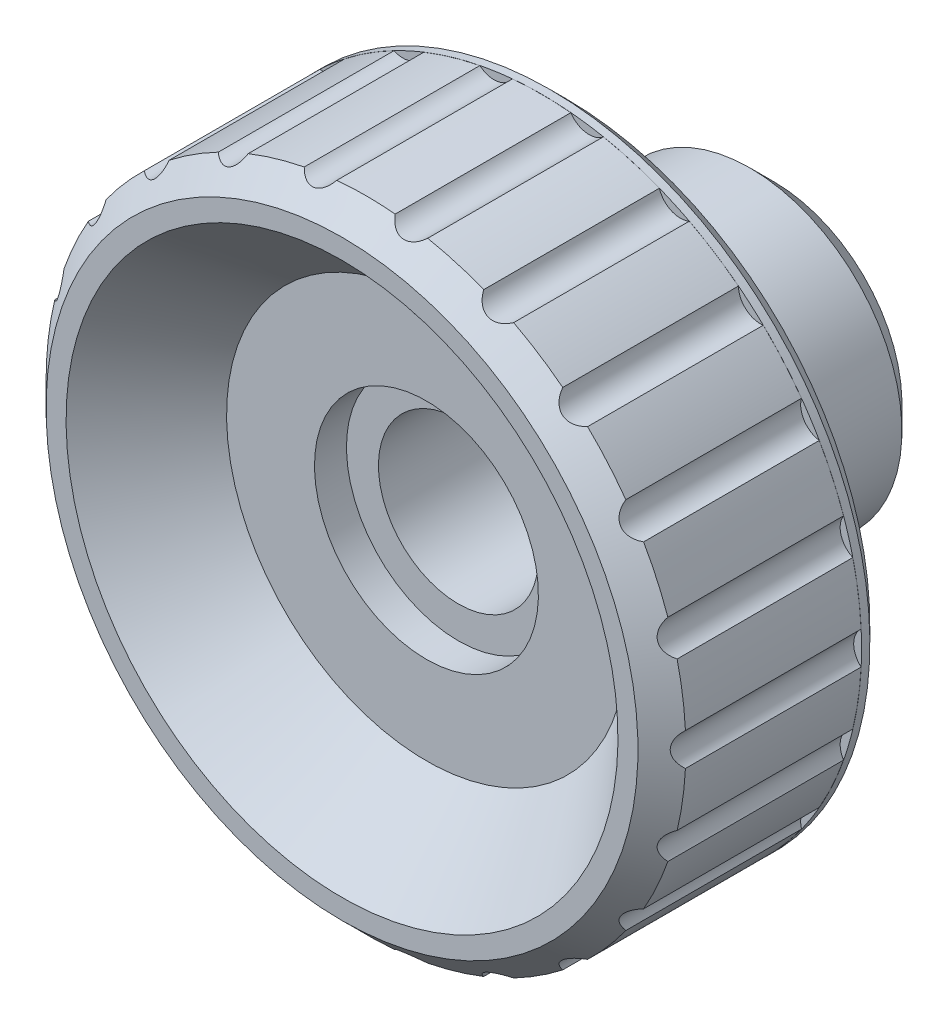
ISO-10303-21;
HEADER;
FILE_DESCRIPTION(('STEP AP214'),'2;1');
FILE_NAME('part.step','',(''),(''),'','','');
FILE_SCHEMA(('AUTOMOTIVE_DESIGN { 1 0 10303 214 1 1 1 1 }'));
ENDSEC;
DATA;
#1=APPLICATION_CONTEXT('core data for automotive mechanical design processes');
#2=APPLICATION_PROTOCOL_DEFINITION('international standard','automotive_design',2000,#1);
#3=PRODUCT_CONTEXT('',#1,'mechanical');
#4=PRODUCT('Part','Part','',(#3));
#5=PRODUCT_RELATED_PRODUCT_CATEGORY('part','',(#4));
#6=PRODUCT_DEFINITION_FORMATION('','',#4);
#7=PRODUCT_DEFINITION_CONTEXT('part definition',#1,'design');
#8=PRODUCT_DEFINITION('design','',#6,#7);
#9=PRODUCT_DEFINITION_SHAPE('','',#8);
#10=(LENGTH_UNIT() NAMED_UNIT(*) SI_UNIT(.MILLI.,.METRE.));
#11=(NAMED_UNIT(*) PLANE_ANGLE_UNIT() SI_UNIT($,.RADIAN.));
#12=(NAMED_UNIT(*) SI_UNIT($,.STERADIAN.) SOLID_ANGLE_UNIT());
#13=UNCERTAINTY_MEASURE_WITH_UNIT(LENGTH_MEASURE(1.E-05),#10,'distance_accuracy_value','');
#14=(GEOMETRIC_REPRESENTATION_CONTEXT(3) GLOBAL_UNCERTAINTY_ASSIGNED_CONTEXT((#13)) GLOBAL_UNIT_ASSIGNED_CONTEXT((#10,
#11,#12)) REPRESENTATION_CONTEXT('',''));
#15=CARTESIAN_POINT('',(0.,0.,0.));
#16=DIRECTION('',(0.,0.,1.));
#17=DIRECTION('',(1.,0.,0.));
#18=AXIS2_PLACEMENT_3D('',#15,#16,#17);
#19=CARTESIAN_POINT('',(0.,0.,0.));
#20=DIRECTION('',(0.,0.,-1.));
#21=DIRECTION('',(0.,1.,0.));
#22=AXIS2_PLACEMENT_3D('',#19,#20,#21);
#23=CYLINDRICAL_SURFACE('',#22,20.0024080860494);
#24=CARTESIAN_POINT('',(0.,0.,14.3049999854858));
#25=DIRECTION('',(0.,0.,-1.));
#26=DIRECTION('',(0.,1.,0.));
#27=AXIS2_PLACEMENT_3D('',#24,#25,#26);
#28=CIRCLE('',#27,20.0024080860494);
#29=CARTESIAN_POINT('',(0.,20.0024080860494,14.3049999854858));
#30=VERTEX_POINT('',#29);
#31=EDGE_CURVE('E586',#30,#30,#28,.T.);
#32=ORIENTED_EDGE('',*,*,#31,.F.);
#33=EDGE_LOOP('',(#32));
#34=FACE_BOUND('',#33,.T.);
#35=CARTESIAN_POINT('',(0.,0.,14.8249999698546));
#36=DIRECTION('',(0.,0.,1.));
#37=DIRECTION('',(0.,-1.,0.));
#38=AXIS2_PLACEMENT_3D('',#35,#36,#37);
#39=CIRCLE('',#38,20.0024080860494);
#40=CARTESIAN_POINT('',(0.,-20.0024080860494,14.8249999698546));
#41=VERTEX_POINT('',#40);
#42=EDGE_CURVE('E443',#41,#41,#39,.F.);
#43=ORIENTED_EDGE('',*,*,#42,.T.);
#44=EDGE_LOOP('',(#43));
#45=FACE_BOUND('',#44,.T.);
#46=ADVANCED_FACE('F14',(#34,#45),#23,.T.);
#47=CARTESIAN_POINT('',(0.,0.,13.3049999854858));
#48=DIRECTION('',(0.,0.,1.));
#49=DIRECTION('',(0.,-1.,0.));
#50=AXIS2_PLACEMENT_3D('',#47,#48,#49);
#51=CONICAL_SURFACE('',#50,19.0024080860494,0.785398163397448);
#52=ORIENTED_EDGE('',*,*,#31,.T.);
#53=EDGE_LOOP('',(#52));
#54=FACE_BOUND('',#53,.T.);
#55=CARTESIAN_POINT('',(0.,0.,13.3049999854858));
#56=DIRECTION('',(0.,0.,-1.));
#57=DIRECTION('',(0.,1.,0.));
#58=AXIS2_PLACEMENT_3D('',#55,#56,#57);
#59=CIRCLE('',#58,19.0024080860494);
#60=CARTESIAN_POINT('',(0.,19.0024080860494,13.3049999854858));
#61=VERTEX_POINT('',#60);
#62=EDGE_CURVE('E583',#61,#61,#59,.T.);
#63=ORIENTED_EDGE('',*,*,#62,.F.);
#64=EDGE_LOOP('',(#63));
#65=FACE_BOUND('',#64,.T.);
#66=ADVANCED_FACE('F648',(#54,#65),#51,.T.);
#67=CARTESIAN_POINT('',(9.5011277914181,0.,13.3049999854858));
#68=DIRECTION('',(0.,0.,-1.));
#69=DIRECTION('',(0.,1.,0.));
#70=AXIS2_PLACEMENT_3D('',#67,#68,#69);
#71=PLANE('',#70);
#72=ORIENTED_EDGE('',*,*,#62,.T.);
#73=EDGE_LOOP('',(#72));
#74=FACE_BOUND('',#73,.T.);
#75=CARTESIAN_POINT('',(0.,0.,13.3049999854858));
#76=DIRECTION('',(0.,0.,-1.));
#77=DIRECTION('',(0.,1.,0.));
#78=AXIS2_PLACEMENT_3D('',#75,#76,#77);
#79=CIRCLE('',#78,9.5011277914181);
#80=CARTESIAN_POINT('',(0.,9.5011277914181,13.3049999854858));
#81=VERTEX_POINT('',#80);
#82=EDGE_CURVE('E580',#81,#81,#79,.T.);
#83=ORIENTED_EDGE('',*,*,#82,.F.);
#84=EDGE_LOOP('',(#83));
#85=FACE_BOUND('',#84,.T.);
#86=ADVANCED_FACE('F644',(#74,#85),#71,.T.);
#87=CARTESIAN_POINT('',(0.,0.,0.));
#88=DIRECTION('',(0.,0.,-1.));
#89=DIRECTION('',(0.,1.,0.));
#90=AXIS2_PLACEMENT_3D('',#87,#88,#89);
#91=CYLINDRICAL_SURFACE('',#90,9.5011277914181);
#92=ORIENTED_EDGE('',*,*,#82,.T.);
#93=EDGE_LOOP('',(#92));
#94=FACE_BOUND('',#93,.T.);
#95=CARTESIAN_POINT('',(0.,0.,1.80000000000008));
#96=DIRECTION('',(0.,0.,-1.));
#97=DIRECTION('',(0.,1.,0.));
#98=AXIS2_PLACEMENT_3D('',#95,#96,#97);
#99=CIRCLE('',#98,9.5011277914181);
#100=CARTESIAN_POINT('',(0.,9.5011277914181,1.80000000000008));
#101=VERTEX_POINT('',#100);
#102=EDGE_CURVE('E577',#101,#101,#99,.T.);
#103=ORIENTED_EDGE('',*,*,#102,.F.);
#104=EDGE_LOOP('',(#103));
#105=FACE_BOUND('',#104,.T.);
#106=ADVANCED_FACE('F640',(#94,#105),#91,.T.);
#107=CARTESIAN_POINT('',(0.,0.,0.300000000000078));
#108=DIRECTION('',(0.,0.,1.));
#109=DIRECTION('',(0.,-1.,0.));
#110=AXIS2_PLACEMENT_3D('',#107,#108,#109);
#111=CONICAL_SURFACE('',#110,8.00112779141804,0.785398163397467);
#112=ORIENTED_EDGE('',*,*,#102,.T.);
#113=EDGE_LOOP('',(#112));
#114=FACE_BOUND('',#113,.T.);
#115=CARTESIAN_POINT('',(0.,0.,0.300000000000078));
#116=DIRECTION('',(0.,0.,-1.));
#117=DIRECTION('',(0.,1.,0.));
#118=AXIS2_PLACEMENT_3D('',#115,#116,#117);
#119=CIRCLE('',#118,8.00112779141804);
#120=CARTESIAN_POINT('',(0.,8.00112779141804,0.300000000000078));
#121=VERTEX_POINT('',#120);
#122=EDGE_CURVE('E574',#121,#121,#119,.T.);
#123=ORIENTED_EDGE('',*,*,#122,.F.);
#124=EDGE_LOOP('',(#123));
#125=FACE_BOUND('',#124,.T.);
#126=ADVANCED_FACE('F636',(#114,#125),#111,.T.);
#127=CARTESIAN_POINT('',(7.,0.,0.300000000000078));
#128=DIRECTION('',(0.,0.,-1.));
#129=DIRECTION('',(0.,1.,0.));
#130=AXIS2_PLACEMENT_3D('',#127,#128,#129);
#131=PLANE('',#130);
#132=ORIENTED_EDGE('',*,*,#122,.T.);
#133=EDGE_LOOP('',(#132));
#134=FACE_BOUND('',#133,.T.);
#135=CARTESIAN_POINT('',(0.,0.,0.300000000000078));
#136=DIRECTION('',(0.,0.,-1.));
#137=DIRECTION('',(0.,1.,0.));
#138=AXIS2_PLACEMENT_3D('',#135,#136,#137);
#139=CIRCLE('',#138,7.);
#140=CARTESIAN_POINT('',(0.,7.,0.300000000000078));
#141=VERTEX_POINT('',#140);
#142=EDGE_CURVE('E571',#141,#141,#139,.T.);
#143=ORIENTED_EDGE('',*,*,#142,.F.);
#144=EDGE_LOOP('',(#143));
#145=FACE_BOUND('',#144,.T.);
#146=ADVANCED_FACE('F632',(#134,#145),#131,.T.);
#147=CARTESIAN_POINT('',(0.,0.,0.));
#148=DIRECTION('',(0.,0.,-1.));
#149=DIRECTION('',(0.,1.,0.));
#150=AXIS2_PLACEMENT_3D('',#147,#148,#149);
#151=CYLINDRICAL_SURFACE('',#150,7.);
#152=ORIENTED_EDGE('',*,*,#142,.T.);
#153=EDGE_LOOP('',(#152));
#154=FACE_BOUND('',#153,.T.);
#155=CARTESIAN_POINT('',(0.,0.,0.));
#156=DIRECTION('',(0.,0.,-1.));
#157=DIRECTION('',(0.,1.,0.));
#158=AXIS2_PLACEMENT_3D('',#155,#156,#157);
#159=CIRCLE('',#158,7.);
#160=CARTESIAN_POINT('',(0.,7.,0.));
#161=VERTEX_POINT('',#160);
#162=EDGE_CURVE('E568',#161,#161,#159,.T.);
#163=ORIENTED_EDGE('',*,*,#162,.F.);
#164=EDGE_LOOP('',(#163));
#165=FACE_BOUND('',#164,.T.);
#166=ADVANCED_FACE('F628',(#154,#165),#151,.T.);
#167=CARTESIAN_POINT('',(0.,0.,0.));
#168=DIRECTION('',(0.,0.,-1.));
#169=DIRECTION('',(0.,1.,0.));
#170=AXIS2_PLACEMENT_3D('',#167,#168,#169);
#171=PLANE('',#170);
#172=CARTESIAN_POINT('',(0.,0.,0.));
#173=DIRECTION('',(0.,0.,1.));
#174=DIRECTION('',(0.,-1.,0.));
#175=AXIS2_PLACEMENT_3D('',#172,#173,#174);
#176=CIRCLE('',#175,5.);
#177=CARTESIAN_POINT('',(0.,-5.,0.));
#178=VERTEX_POINT('',#177);
#179=EDGE_CURVE('E1493',#178,#178,#176,.T.);
#180=ORIENTED_EDGE('',*,*,#179,.T.);
#181=EDGE_LOOP('',(#180));
#182=FACE_BOUND('',#181,.T.);
#183=ORIENTED_EDGE('',*,*,#162,.T.);
#184=EDGE_LOOP('',(#183));
#185=FACE_BOUND('',#184,.T.);
#186=ADVANCED_FACE('F624',(#182,#185),#171,.T.);
#187=CARTESIAN_POINT('',(0.,0.,14.8249999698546));
#188=DIRECTION('',(0.,0.,1.));
#189=DIRECTION('',(0.,-1.,0.));
#190=AXIS2_PLACEMENT_3D('',#187,#188,#189);
#191=PLANE('',#190);
#192=ORIENTED_EDGE('',*,*,#42,.F.);
#193=EDGE_LOOP('',(#192));
#194=FACE_BOUND('',#193,.T.);
#195=CARTESIAN_POINT('',(8.6739827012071,-18.9933727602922,14.8249999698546));
#196=DIRECTION('',(0.,0.,-1.));
#197=DIRECTION('',(0.,-1.,0.));
#198=AXIS2_PLACEMENT_3D('',#195,#196,#197);
#199=CIRCLE('',#198,1.36999999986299);
#200=CARTESIAN_POINT('',(7.36309325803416,-18.5952912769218,14.8249999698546));
#201=VERTEX_POINT('',#200);
#202=CARTESIAN_POINT('',(9.2315828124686,-17.7419806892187,14.8249999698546));
#203=VERTEX_POINT('',#202);
#204=EDGE_CURVE('E299',#201,#203,#199,.T.);
#205=ORIENTED_EDGE('',*,*,#204,.F.);
#206=CARTESIAN_POINT('',(0.,0.,14.8249999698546));
#207=DIRECTION('',(0.,0.,1.));
#208=DIRECTION('',(0.,-1.,0.));
#209=AXIS2_PLACEMENT_3D('',#206,#207,#208);
#210=CIRCLE('',#209,20.0000000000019);
#211=CARTESIAN_POINT('',(3.85914526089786,-19.6241432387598,14.8249999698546));
#212=VERTEX_POINT('',#211);
#213=EDGE_CURVE('E438',#212,#201,#210,.T.);
#214=ORIENTED_EDGE('',*,*,#213,.F.);
#215=CARTESIAN_POINT('',(2.97157398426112,-20.667751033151,14.8249999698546));
#216=DIRECTION('',(0.,0.,-1.));
#217=DIRECTION('',(0.,-1.,0.));
#218=AXIS2_PLACEMENT_3D('',#215,#216,#217);
#219=CIRCLE('',#218,1.36999999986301);
#220=CARTESIAN_POINT('',(1.82593728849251,-19.9164744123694,14.8249999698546));
#221=VERTEX_POINT('',#220);
#222=EDGE_CURVE('E435',#221,#212,#219,.T.);
#223=ORIENTED_EDGE('',*,*,#222,.F.);
#224=CARTESIAN_POINT('',(0.,0.,14.8249999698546));
#225=DIRECTION('',(0.,0.,1.));
#226=DIRECTION('',(0.,-1.,0.));
#227=AXIS2_PLACEMENT_3D('',#224,#225,#226);
#228=CIRCLE('',#227,20.0000000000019);
#229=CARTESIAN_POINT('',(-1.82593728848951,-19.9164744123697,14.8249999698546));
#230=VERTEX_POINT('',#229);
#231=EDGE_CURVE('E432',#230,#221,#228,.T.);
#232=ORIENTED_EDGE('',*,*,#231,.F.);
#233=CARTESIAN_POINT('',(-2.97157398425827,-20.667751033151,14.8249999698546));
#234=DIRECTION('',(0.,0.,-1.));
#235=DIRECTION('',(0.,-1.,0.));
#236=AXIS2_PLACEMENT_3D('',#233,#234,#235);
#237=CIRCLE('',#236,1.36999999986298);
#238=CARTESIAN_POINT('',(-3.85914526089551,-19.6241432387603,14.8249999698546));
#239=VERTEX_POINT('',#238);
#240=EDGE_CURVE('E429',#239,#230,#237,.T.);
#241=ORIENTED_EDGE('',*,*,#240,.F.);
#242=CARTESIAN_POINT('',(0.,0.,14.8249999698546));
#243=DIRECTION('',(0.,0.,1.));
#244=DIRECTION('',(0.,-1.,0.));
#245=AXIS2_PLACEMENT_3D('',#242,#243,#244);
#246=CIRCLE('',#245,20.0000000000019);
#247=CARTESIAN_POINT('',(-7.36309325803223,-18.5952912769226,14.8249999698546));
#248=VERTEX_POINT('',#247);
#249=EDGE_CURVE('E426',#248,#239,#246,.T.);
#250=ORIENTED_EDGE('',*,*,#249,.F.);
#251=CARTESIAN_POINT('',(-8.67398270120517,-18.993372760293,14.8249999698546));
#252=DIRECTION('',(0.,0.,-1.));
#253=DIRECTION('',(0.,-1.,0.));
#254=AXIS2_PLACEMENT_3D('',#251,#252,#253);
#255=CIRCLE('',#254,1.369999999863);
#256=CARTESIAN_POINT('',(-9.23158281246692,-17.7419806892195,14.8249999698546));
#257=VERTEX_POINT('',#256);
#258=EDGE_CURVE('E423',#257,#248,#255,.T.);
#259=ORIENTED_EDGE('',*,*,#258,.F.);
#260=CARTESIAN_POINT('',(0.,0.,14.8249999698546));
#261=DIRECTION('',(0.,0.,1.));
#262=DIRECTION('',(0.,-1.,0.));
#263=AXIS2_PLACEMENT_3D('',#260,#261,#262);
#264=CIRCLE('',#263,20.0000000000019);
#265=CARTESIAN_POINT('',(-12.3037352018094,-15.7676282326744,14.8249999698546));
#266=VERTEX_POINT('',#265);
#267=EDGE_CURVE('E420',#266,#257,#264,.T.);
#268=ORIENTED_EDGE('',*,*,#267,.F.);
#269=CARTESIAN_POINT('',(-13.6736769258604,-15.7802643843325,14.8249999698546));
#270=DIRECTION('',(0.,0.,-1.));
#271=DIRECTION('',(0.,-1.,0.));
#272=AXIS2_PLACEMENT_3D('',#269,#270,#271);
#273=CIRCLE('',#272,1.36999999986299);
#274=CARTESIAN_POINT('',(-13.8561324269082,-14.4224683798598,14.8249999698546));
#275=VERTEX_POINT('',#274);
#276=EDGE_CURVE('E417',#275,#266,#273,.T.);
#277=ORIENTED_EDGE('',*,*,#276,.F.);
#278=CARTESIAN_POINT('',(0.,0.,14.8249999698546));
#279=DIRECTION('',(0.,0.,1.));
#280=DIRECTION('',(0.,-1.,0.));
#281=AXIS2_PLACEMENT_3D('',#278,#279,#280);
#282=CIRCLE('',#281,20.0000000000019);
#283=CARTESIAN_POINT('',(-16.2476016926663,-11.6625657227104,14.8249999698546));
#284=VERTEX_POINT('',#283);
#285=EDGE_CURVE('E414',#284,#275,#282,.T.);
#286=ORIENTED_EDGE('',*,*,#285,.F.);
#287=CARTESIAN_POINT('',(-17.5656111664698,-11.288732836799,14.8249999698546));
#288=DIRECTION('',(0.,0.,-1.));
#289=DIRECTION('',(0.,-1.,0.));
#290=AXIS2_PLACEMENT_3D('',#287,#288,#289);
#291=CIRCLE('',#290,1.36999999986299);
#292=CARTESIAN_POINT('',(-17.3581405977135,-9.93453345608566,14.8249999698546));
#293=VERTEX_POINT('',#292);
#294=EDGE_CURVE('E411',#293,#284,#291,.T.);
#295=ORIENTED_EDGE('',*,*,#294,.F.);
#296=CARTESIAN_POINT('',(0.,0.,14.8249999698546));
#297=DIRECTION('',(0.,0.,1.));
#298=DIRECTION('',(0.,-1.,0.));
#299=AXIS2_PLACEMENT_3D('',#296,#297,#298);
#300=CIRCLE('',#299,20.0000000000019);
#301=CARTESIAN_POINT('',(-18.8751841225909,-6.61267149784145,14.8249999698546));
#302=VERTEX_POINT('',#301);
#303=EDGE_CURVE('E408',#302,#293,#300,.T.);
#304=ORIENTED_EDGE('',*,*,#303,.F.);
#305=CARTESIAN_POINT('',(-20.0344840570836,-5.88265529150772,14.8249999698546));
#306=DIRECTION('',(0.,0.,-1.));
#307=DIRECTION('',(0.,-1.,0.));
#308=AXIS2_PLACEMENT_3D('',#305,#306,#307);
#309=CIRCLE('',#308,1.36999999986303);
#310=CARTESIAN_POINT('',(-19.4538954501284,-4.64176171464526,14.8249999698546));
#311=VERTEX_POINT('',#310);
#312=EDGE_CURVE('E405',#311,#302,#309,.T.);
#313=ORIENTED_EDGE('',*,*,#312,.F.);
#314=CARTESIAN_POINT('',(0.,0.,14.8249999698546));
#315=DIRECTION('',(0.,0.,1.));
#316=DIRECTION('',(0.,-1.,0.));
#317=AXIS2_PLACEMENT_3D('',#314,#315,#316);
#318=CIRCLE('',#317,20.0000000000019);
#319=CARTESIAN_POINT('',(-19.9736113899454,-1.02705795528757,14.8249999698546));
#320=VERTEX_POINT('',#319);
#321=EDGE_CURVE('E402',#320,#311,#318,.T.);
#322=ORIENTED_EDGE('',*,*,#321,.F.);
#323=CARTESIAN_POINT('',(-20.8802821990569,4.90579799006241E-12,14.8249999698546));
#324=DIRECTION('',(0.,0.,-1.));
#325=DIRECTION('',(0.,-1.,0.));
#326=AXIS2_PLACEMENT_3D('',#323,#324,#325);
#327=CIRCLE('',#326,1.36999999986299);
#328=CARTESIAN_POINT('',(-19.9736113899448,1.02705795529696,14.8249999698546));
#329=VERTEX_POINT('',#328);
#330=EDGE_CURVE('E399',#329,#320,#327,.T.);
#331=ORIENTED_EDGE('',*,*,#330,.F.);
#332=CARTESIAN_POINT('',(0.,0.,14.8249999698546));
#333=DIRECTION('',(0.,0.,1.));
#334=DIRECTION('',(0.,-1.,0.));
#335=AXIS2_PLACEMENT_3D('',#332,#333,#334);
#336=CIRCLE('',#335,20.0000000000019);
#337=CARTESIAN_POINT('',(-19.4538954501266,4.64176171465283,14.8249999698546));
#338=VERTEX_POINT('',#337);
#339=EDGE_CURVE('E396',#338,#329,#336,.T.);
#340=ORIENTED_EDGE('',*,*,#339,.F.);
#341=CARTESIAN_POINT('',(-20.0344840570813,5.88265529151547,14.8249999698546));
#342=DIRECTION('',(0.,0.,-1.));
#343=DIRECTION('',(0.,-1.,0.));
#344=AXIS2_PLACEMENT_3D('',#341,#342,#343);
#345=CIRCLE('',#344,1.36999999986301);
#346=CARTESIAN_POINT('',(-18.8751841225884,6.61267149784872,14.8249999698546));
#347=VERTEX_POINT('',#346);
#348=EDGE_CURVE('E393',#347,#338,#345,.T.);
#349=ORIENTED_EDGE('',*,*,#348,.F.);
#350=CARTESIAN_POINT('',(0.,0.,14.8249999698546));
#351=DIRECTION('',(0.,0.,1.));
#352=DIRECTION('',(0.,-1.,0.));
#353=AXIS2_PLACEMENT_3D('',#350,#351,#352);
#354=CIRCLE('',#353,20.0000000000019);
#355=CARTESIAN_POINT('',(-17.3581405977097,9.93453345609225,14.8249999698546));
#356=VERTEX_POINT('',#355);
#357=EDGE_CURVE('E390',#356,#347,#354,.T.);
#358=ORIENTED_EDGE('',*,*,#357,.F.);
#359=CARTESIAN_POINT('',(-17.5656111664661,11.2887328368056,14.8249999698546));
#360=DIRECTION('',(0.,0.,-1.));
#361=DIRECTION('',(0.,-1.,0.));
#362=AXIS2_PLACEMENT_3D('',#359,#360,#361);
#363=CIRCLE('',#362,1.36999999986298);
#364=CARTESIAN_POINT('',(-16.2476016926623,11.662565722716,14.8249999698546));
#365=VERTEX_POINT('',#364);
#366=EDGE_CURVE('E387',#365,#356,#363,.T.);
#367=ORIENTED_EDGE('',*,*,#366,.F.);
#368=CARTESIAN_POINT('',(0.,0.,14.8249999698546));
#369=DIRECTION('',(0.,0.,1.));
#370=DIRECTION('',(0.,-1.,0.));
#371=AXIS2_PLACEMENT_3D('',#368,#369,#370);
#372=CIRCLE('',#371,20.0000000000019);
#373=CARTESIAN_POINT('',(-13.8561324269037,14.4224683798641,14.8249999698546));
#374=VERTEX_POINT('',#373);
#375=EDGE_CURVE('E384',#374,#365,#372,.T.);
#376=ORIENTED_EDGE('',*,*,#375,.F.);
#377=CARTESIAN_POINT('',(-13.673676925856,15.780264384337,14.8249999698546));
#378=DIRECTION('',(0.,0.,-1.));
#379=DIRECTION('',(0.,-1.,0.));
#380=AXIS2_PLACEMENT_3D('',#377,#378,#379);
#381=CIRCLE('',#380,1.36999999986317);
#382=CARTESIAN_POINT('',(-12.3037352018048,15.767628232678,14.8249999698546));
#383=VERTEX_POINT('',#382);
#384=EDGE_CURVE('E381',#383,#374,#381,.T.);
#385=ORIENTED_EDGE('',*,*,#384,.F.);
#386=CARTESIAN_POINT('',(0.,0.,14.8249999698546));
#387=DIRECTION('',(0.,0.,1.));
#388=DIRECTION('',(0.,-1.,0.));
#389=AXIS2_PLACEMENT_3D('',#386,#387,#388);
#390=CIRCLE('',#389,20.0000000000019);
#391=CARTESIAN_POINT('',(-9.23158281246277,17.7419806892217,14.8249999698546));
#392=VERTEX_POINT('',#391);
#393=EDGE_CURVE('E378',#392,#383,#390,.T.);
#394=ORIENTED_EDGE('',*,*,#393,.F.);
#395=CARTESIAN_POINT('',(-8.67398270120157,18.9933727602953,14.8249999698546));
#396=DIRECTION('',(0.,0.,-1.));
#397=DIRECTION('',(0.,-1.,0.));
#398=AXIS2_PLACEMENT_3D('',#395,#396,#397);
#399=CIRCLE('',#398,1.36999999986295);
#400=CARTESIAN_POINT('',(-7.36309325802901,18.5952912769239,14.8249999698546));
#401=VERTEX_POINT('',#400);
#402=EDGE_CURVE('E375',#401,#392,#399,.T.);
#403=ORIENTED_EDGE('',*,*,#402,.F.);
#404=CARTESIAN_POINT('',(0.,0.,14.8249999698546));
#405=DIRECTION('',(0.,0.,1.));
#406=DIRECTION('',(0.,-1.,0.));
#407=AXIS2_PLACEMENT_3D('',#404,#405,#406);
#408=CIRCLE('',#407,20.0000000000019);
#409=CARTESIAN_POINT('',(-3.85914526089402,19.6241432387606,14.8249999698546));
#410=VERTEX_POINT('',#409);
#411=EDGE_CURVE('E372',#410,#401,#408,.T.);
#412=ORIENTED_EDGE('',*,*,#411,.F.);
#413=CARTESIAN_POINT('',(-2.97157398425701,20.6677510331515,14.8249999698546));
#414=DIRECTION('',(0.,0.,-1.));
#415=DIRECTION('',(0.,-1.,0.));
#416=AXIS2_PLACEMENT_3D('',#413,#414,#415);
#417=CIRCLE('',#416,1.36999999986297);
#418=CARTESIAN_POINT('',(-1.82593728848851,19.9164744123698,14.8249999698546));
#419=VERTEX_POINT('',#418);
#420=EDGE_CURVE('E369',#419,#410,#417,.T.);
#421=ORIENTED_EDGE('',*,*,#420,.F.);
#422=CARTESIAN_POINT('',(0.,0.,14.8249999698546));
#423=DIRECTION('',(0.,0.,1.));
#424=DIRECTION('',(0.,-1.,0.));
#425=AXIS2_PLACEMENT_3D('',#422,#423,#424);
#426=CIRCLE('',#425,20.0000000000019);
#427=CARTESIAN_POINT('',(1.82593728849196,19.9164744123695,14.8249999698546));
#428=VERTEX_POINT('',#427);
#429=EDGE_CURVE('E366',#428,#419,#426,.T.);
#430=ORIENTED_EDGE('',*,*,#429,.F.);
#431=CARTESIAN_POINT('',(2.97157398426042,20.6677510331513,14.8249999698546));
#432=DIRECTION('',(0.,0.,-1.));
#433=DIRECTION('',(0.,-1.,0.));
#434=AXIS2_PLACEMENT_3D('',#431,#432,#433);
#435=CIRCLE('',#434,1.36999999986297);
#436=CARTESIAN_POINT('',(3.85914526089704,19.62414323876,14.8249999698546));
#437=VERTEX_POINT('',#436);
#438=EDGE_CURVE('E363',#437,#428,#435,.T.);
#439=ORIENTED_EDGE('',*,*,#438,.F.);
#440=CARTESIAN_POINT('',(0.,0.,14.8249999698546));
#441=DIRECTION('',(0.,0.,1.));
#442=DIRECTION('',(0.,-1.,0.));
#443=AXIS2_PLACEMENT_3D('',#440,#441,#442);
#444=CIRCLE('',#443,20.0000000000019);
#445=CARTESIAN_POINT('',(7.36309325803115,18.595291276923,14.8249999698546));
#446=VERTEX_POINT('',#445);
#447=EDGE_CURVE('E360',#446,#437,#444,.T.);
#448=ORIENTED_EDGE('',*,*,#447,.F.);
#449=CARTESIAN_POINT('',(8.67398270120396,18.9933727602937,14.8249999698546));
#450=DIRECTION('',(0.,0.,-1.));
#451=DIRECTION('',(0.,-1.,0.));
#452=AXIS2_PLACEMENT_3D('',#449,#450,#451);
#453=CIRCLE('',#452,1.36999999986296);
#454=CARTESIAN_POINT('',(9.23158281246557,17.7419806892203,14.8249999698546));
#455=VERTEX_POINT('',#454);
#456=EDGE_CURVE('E357',#455,#446,#453,.T.);
#457=ORIENTED_EDGE('',*,*,#456,.F.);
#458=CARTESIAN_POINT('',(0.,0.,14.8249999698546));
#459=DIRECTION('',(0.,0.,1.));
#460=DIRECTION('',(0.,-1.,0.));
#461=AXIS2_PLACEMENT_3D('',#458,#459,#460);
#462=CIRCLE('',#461,20.0000000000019);
#463=CARTESIAN_POINT('',(12.3037352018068,15.7676282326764,14.8249999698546));
#464=VERTEX_POINT('',#463);
#465=EDGE_CURVE('E354',#464,#455,#462,.T.);
#466=ORIENTED_EDGE('',*,*,#465,.F.);
#467=CARTESIAN_POINT('',(13.6736769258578,15.7802643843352,14.8249999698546));
#468=DIRECTION('',(0.,0.,-1.));
#469=DIRECTION('',(0.,-1.,0.));
#470=AXIS2_PLACEMENT_3D('',#467,#468,#469);
#471=CIRCLE('',#470,1.36999999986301);
#472=CARTESIAN_POINT('',(13.8561324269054,14.4224683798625,14.8249999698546));
#473=VERTEX_POINT('',#472);
#474=EDGE_CURVE('E351',#473,#464,#471,.T.);
#475=ORIENTED_EDGE('',*,*,#474,.F.);
#476=CARTESIAN_POINT('',(0.,0.,14.8249999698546));
#477=DIRECTION('',(0.,0.,1.));
#478=DIRECTION('',(0.,-1.,0.));
#479=AXIS2_PLACEMENT_3D('',#476,#477,#478);
#480=CIRCLE('',#479,20.0000000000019);
#481=CARTESIAN_POINT('',(16.2476016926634,11.6625657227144,14.8249999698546));
#482=VERTEX_POINT('',#481);
#483=EDGE_CURVE('E348',#482,#473,#480,.T.);
#484=ORIENTED_EDGE('',*,*,#483,.F.);
#485=CARTESIAN_POINT('',(17.5656111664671,11.2887328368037,14.8249999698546));
#486=DIRECTION('',(0.,0.,-1.));
#487=DIRECTION('',(0.,-1.,0.));
#488=AXIS2_PLACEMENT_3D('',#485,#486,#487);
#489=CIRCLE('',#488,1.36999999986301);
#490=CARTESIAN_POINT('',(17.3581405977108,9.93453345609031,14.8249999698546));
#491=VERTEX_POINT('',#490);
#492=EDGE_CURVE('E345',#491,#482,#489,.T.);
#493=ORIENTED_EDGE('',*,*,#492,.F.);
#494=CARTESIAN_POINT('',(0.,0.,14.8249999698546));
#495=DIRECTION('',(0.,0.,1.));
#496=DIRECTION('',(0.,-1.,0.));
#497=AXIS2_PLACEMENT_3D('',#494,#495,#496);
#498=CIRCLE('',#497,20.0000000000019);
#499=CARTESIAN_POINT('',(18.8751841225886,6.6126714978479,14.8249999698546));
#500=VERTEX_POINT('',#499);
#501=EDGE_CURVE('E342',#500,#491,#498,.T.);
#502=ORIENTED_EDGE('',*,*,#501,.F.);
#503=CARTESIAN_POINT('',(20.0344840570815,5.88265529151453,14.8249999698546));
#504=DIRECTION('',(0.,0.,-1.));
#505=DIRECTION('',(0.,-1.,0.));
#506=AXIS2_PLACEMENT_3D('',#503,#504,#505);
#507=CIRCLE('',#506,1.36999999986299);
#508=CARTESIAN_POINT('',(19.4538954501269,4.64176171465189,14.8249999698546));
#509=VERTEX_POINT('',#508);
#510=EDGE_CURVE('E339',#509,#500,#507,.T.);
#511=ORIENTED_EDGE('',*,*,#510,.F.);
#512=CARTESIAN_POINT('',(0.,0.,14.8249999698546));
#513=DIRECTION('',(0.,0.,1.));
#514=DIRECTION('',(0.,-1.,0.));
#515=AXIS2_PLACEMENT_3D('',#512,#513,#514);
#516=CIRCLE('',#515,20.0000000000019);
#517=CARTESIAN_POINT('',(19.9736113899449,1.02705795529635,14.8249999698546));
#518=VERTEX_POINT('',#517);
#519=EDGE_CURVE('E336',#518,#509,#516,.T.);
#520=ORIENTED_EDGE('',*,*,#519,.F.);
#521=CARTESIAN_POINT('',(20.8802821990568,4.25180723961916E-12,14.8249999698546));
#522=DIRECTION('',(0.,0.,-1.));
#523=DIRECTION('',(0.,-1.,0.));
#524=AXIS2_PLACEMENT_3D('',#521,#522,#523);
#525=CIRCLE('',#524,1.36999999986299);
#526=CARTESIAN_POINT('',(19.9736113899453,-1.02705795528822,14.8249999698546));
#527=VERTEX_POINT('',#526);
#528=EDGE_CURVE('E333',#527,#518,#525,.T.);
#529=ORIENTED_EDGE('',*,*,#528,.F.);
#530=CARTESIAN_POINT('',(0.,0.,14.8249999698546));
#531=DIRECTION('',(0.,0.,1.));
#532=DIRECTION('',(0.,-1.,0.));
#533=AXIS2_PLACEMENT_3D('',#530,#531,#532);
#534=CIRCLE('',#533,20.0000000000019);
#535=CARTESIAN_POINT('',(19.4538954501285,-4.64176171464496,14.8249999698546));
#536=VERTEX_POINT('',#535);
#537=EDGE_CURVE('E330',#536,#527,#534,.T.);
#538=ORIENTED_EDGE('',*,*,#537,.F.);
#539=CARTESIAN_POINT('',(20.0344840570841,-5.88265529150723,14.8249999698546));
#540=DIRECTION('',(0.,0.,-1.));
#541=DIRECTION('',(0.,-1.,0.));
#542=AXIS2_PLACEMENT_3D('',#539,#540,#541);
#543=CIRCLE('',#542,1.36999999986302);
#544=CARTESIAN_POINT('',(18.8751841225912,-6.61267149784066,14.8249999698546));
#545=VERTEX_POINT('',#544);
#546=EDGE_CURVE('E327',#545,#536,#543,.T.);
#547=ORIENTED_EDGE('',*,*,#546,.F.);
#548=CARTESIAN_POINT('',(0.,0.,14.8249999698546));
#549=DIRECTION('',(0.,0.,1.));
#550=DIRECTION('',(0.,-1.,0.));
#551=AXIS2_PLACEMENT_3D('',#548,#549,#550);
#552=CIRCLE('',#551,20.0000000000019);
#553=CARTESIAN_POINT('',(17.358140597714,-9.93453345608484,14.8249999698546));
#554=VERTEX_POINT('',#553);
#555=EDGE_CURVE('E324',#554,#545,#552,.T.);
#556=ORIENTED_EDGE('',*,*,#555,.F.);
#557=CARTESIAN_POINT('',(17.5656111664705,-11.2887328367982,14.8249999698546));
#558=DIRECTION('',(0.,0.,-1.));
#559=DIRECTION('',(0.,-1.,0.));
#560=AXIS2_PLACEMENT_3D('',#557,#558,#559);
#561=CIRCLE('',#560,1.369999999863);
#562=CARTESIAN_POINT('',(16.2476016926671,-11.6625657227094,14.8249999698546));
#563=VERTEX_POINT('',#562);
#564=EDGE_CURVE('E321',#563,#554,#561,.T.);
#565=ORIENTED_EDGE('',*,*,#564,.F.);
#566=CARTESIAN_POINT('',(0.,0.,14.8249999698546));
#567=DIRECTION('',(0.,0.,1.));
#568=DIRECTION('',(0.,-1.,0.));
#569=AXIS2_PLACEMENT_3D('',#566,#567,#568);
#570=CIRCLE('',#569,20.0000000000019);
#571=CARTESIAN_POINT('',(13.8561324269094,-14.4224683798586,14.8249999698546));
#572=VERTEX_POINT('',#571);
#573=EDGE_CURVE('E309',#572,#563,#570,.T.);
#574=ORIENTED_EDGE('',*,*,#573,.F.);
#575=CARTESIAN_POINT('',(13.6736769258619,-15.7802643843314,14.8249999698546));
#576=DIRECTION('',(0.,0.,-1.));
#577=DIRECTION('',(0.,-1.,0.));
#578=AXIS2_PLACEMENT_3D('',#575,#576,#577);
#579=CIRCLE('',#578,1.36999999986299);
#580=CARTESIAN_POINT('',(12.3037352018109,-15.7676282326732,14.8249999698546));
#581=VERTEX_POINT('',#580);
#582=EDGE_CURVE('E295',#581,#572,#579,.T.);
#583=ORIENTED_EDGE('',*,*,#582,.F.);
#584=CARTESIAN_POINT('',(0.,0.,14.8249999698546));
#585=DIRECTION('',(0.,0.,1.));
#586=DIRECTION('',(0.,-1.,0.));
#587=AXIS2_PLACEMENT_3D('',#584,#585,#586);
#588=CIRCLE('',#587,20.0000000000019);
#589=EDGE_CURVE('E305',#203,#581,#588,.T.);
#590=ORIENTED_EDGE('',*,*,#589,.F.);
#591=EDGE_LOOP('',(#205,#214,#223,#232,#241,#250,#259,#268,#277,#286,#295,#304,#313,#322,#331,
#340,#349,#358,#367,#376,#385,#394,#403,#412,#421,#430,#439,#448,#457,#466,#475,#484,#493,#502,
#511,#520,#529,#538,#547,#556,#565,#574,#583,#590));
#592=FACE_BOUND('',#591,.T.);
#593=ADVANCED_FACE('F304',(#194,#592),#191,.T.);
#594=CARTESIAN_POINT('',(0.,0.,14.8249999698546));
#595=DIRECTION('',(0.,0.,1.));
#596=DIRECTION('',(0.,-1.,0.));
#597=AXIS2_PLACEMENT_3D('',#594,#595,#596);
#598=CYLINDRICAL_SURFACE('',#597,20.0000000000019);
#599=DIRECTION('',(0.,0.,1.));
#600=VECTOR('',#599,1.);
#601=CARTESIAN_POINT('',(9.2315828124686,-17.7419806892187,14.8249999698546));
#602=LINE('',#601,#600);
#603=CARTESIAN_POINT('',(9.2315828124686,-17.7419806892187,25.8074080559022));
#604=VERTEX_POINT('',#603);
#605=EDGE_CURVE('E312',#203,#604,#602,.T.);
#606=ORIENTED_EDGE('',*,*,#605,.F.);
#607=ORIENTED_EDGE('',*,*,#589,.T.);
#608=DIRECTION('',(0.,0.,1.));
#609=VECTOR('',#608,1.);
#610=CARTESIAN_POINT('',(12.3037352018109,-15.7676282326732,14.8249999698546));
#611=LINE('',#610,#609);
#612=CARTESIAN_POINT('',(12.3037352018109,-15.7676282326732,25.8074080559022));
#613=VERTEX_POINT('',#612);
#614=EDGE_CURVE('E292',#581,#613,#611,.T.);
#615=ORIENTED_EDGE('',*,*,#614,.T.);
#616=CARTESIAN_POINT('',(0.,0.,25.8074080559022));
#617=DIRECTION('',(0.,0.,-1.));
#618=DIRECTION('',(0.,1.,0.));
#619=AXIS2_PLACEMENT_3D('',#616,#617,#618);
#620=CIRCLE('',#619,20.0000000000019);
#621=EDGE_CURVE('E9',#604,#613,#620,.F.);
#622=ORIENTED_EDGE('',*,*,#621,.F.);
#623=EDGE_LOOP('',(#606,#607,#615,#622));
#624=FACE_BOUND('',#623,.T.);
#625=ADVANCED_FACE('F311',(#624),#598,.T.);
#626=CARTESIAN_POINT('',(8.6739827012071,-18.9933727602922,14.8249999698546));
#627=DIRECTION('',(0.,0.,1.));
#628=DIRECTION('',(0.,-1.,0.));
#629=AXIS2_PLACEMENT_3D('',#626,#627,#628);
#630=CYLINDRICAL_SURFACE('',#629,1.36999999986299);
#631=DIRECTION('',(0.,0.,1.));
#632=VECTOR('',#631,1.);
#633=CARTESIAN_POINT('',(7.36309325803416,-18.5952912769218,14.8249999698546));
#634=LINE('',#633,#632);
#635=CARTESIAN_POINT('',(7.36309325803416,-18.5952912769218,25.8074080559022));
#636=VERTEX_POINT('',#635);
#637=EDGE_CURVE('E444',#201,#636,#634,.T.);
#638=ORIENTED_EDGE('',*,*,#637,.F.);
#639=ORIENTED_EDGE('',*,*,#204,.T.);
#640=ORIENTED_EDGE('',*,*,#605,.T.);
#641=CARTESIAN_POINT('',(7.36303254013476,-18.5954912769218,25.8072444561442));
#642=CARTESIAN_POINT('',(7.3827359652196,-18.5306580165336,25.8602580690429));
#643=CARTESIAN_POINT('',(7.40777503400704,-18.4654324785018,25.9115626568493));
#644=CARTESIAN_POINT('',(7.47008026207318,-18.3354979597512,26.008681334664));
#645=CARTESIAN_POINT('',(7.50748314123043,-18.2708034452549,26.0544258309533));
#646=CARTESIAN_POINT('',(7.58417702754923,-18.1612406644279,26.1262460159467));
#647=CARTESIAN_POINT('',(7.62043157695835,-18.1156020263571,26.1543399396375));
#648=CARTESIAN_POINT('',(7.70038550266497,-18.0277038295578,26.2040627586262));
#649=CARTESIAN_POINT('',(7.74405259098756,-17.98543073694,26.2257186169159));
#650=CARTESIAN_POINT('',(7.83155319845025,-17.9117154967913,26.2584889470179));
#651=CARTESIAN_POINT('',(7.87440457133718,-17.8795964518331,26.2706895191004));
#652=CARTESIAN_POINT('',(7.964588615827,-17.8200979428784,26.2885010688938));
#653=CARTESIAN_POINT('',(8.01192160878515,-17.7927188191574,26.2941115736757));
#654=CARTESIAN_POINT('',(8.10988260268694,-17.7436943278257,26.2982849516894));
#655=CARTESIAN_POINT('',(8.16051670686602,-17.7220599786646,26.2968343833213));
#656=CARTESIAN_POINT('',(8.26340133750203,-17.6852017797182,26.2869777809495));
#657=CARTESIAN_POINT('',(8.31565206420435,-17.6699787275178,26.2785708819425));
#658=CARTESIAN_POINT('',(8.41883655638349,-17.6463271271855,26.2557569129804));
#659=CARTESIAN_POINT('',(8.46976907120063,-17.6377314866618,26.2415123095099));
#660=CARTESIAN_POINT('',(8.5705651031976,-17.626338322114,26.2079159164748));
#661=CARTESIAN_POINT('',(8.62042803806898,-17.6235438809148,26.1885614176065));
#662=CARTESIAN_POINT('',(8.74158637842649,-17.6231394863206,26.1354441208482));
#663=CARTESIAN_POINT('',(8.81180940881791,-17.6286234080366,26.0992046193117));
#664=CARTESIAN_POINT('',(8.9469557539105,-17.6490920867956,26.0201566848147));
#665=CARTESIAN_POINT('',(9.0118673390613,-17.6640972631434,25.9773342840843));
#666=CARTESIAN_POINT('',(9.12882773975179,-17.6998172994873,25.8921522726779));
#667=CARTESIAN_POINT('',(9.1814993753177,-17.7196865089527,25.8502961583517));
#668=CARTESIAN_POINT('',(9.23178281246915,-17.7420698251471,25.8072366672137));
#669=B_SPLINE_CURVE_WITH_KNOTS('',3,(#641,#642,#643,#644,#645,#646,#647,#648,#649,#650,#651,
#652,#653,#654,#655,#656,#657,#658,#659,#660,#661,#662,#663,#664,#665,#666,#667,#668),
.UNSPECIFIED.,.F.,.F.,(4,2,2,2,2,2,2,2,2,2,2,2,2,4),(0.,0.25867224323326,0.520306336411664,
0.71370606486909,0.906284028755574,1.07034529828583,1.23441834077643,1.39880383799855,
1.5632097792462,1.72332127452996,1.88351783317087,2.11982303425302,2.35663673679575,
2.56646043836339),.UNSPECIFIED.);
#670=EDGE_CURVE('E22',#636,#604,#669,.T.);
#671=ORIENTED_EDGE('',*,*,#670,.F.);
#672=EDGE_LOOP('',(#638,#639,#640,#671));
#673=FACE_BOUND('',#672,.T.);
#674=ADVANCED_FACE('F621',(#673),#630,.F.);
#675=CARTESIAN_POINT('',(0.,0.,14.8249999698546));
#676=DIRECTION('',(0.,0.,1.));
#677=DIRECTION('',(0.,-1.,0.));
#678=AXIS2_PLACEMENT_3D('',#675,#676,#677);
#679=CYLINDRICAL_SURFACE('',#678,20.0000000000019);
#680=DIRECTION('',(0.,0.,1.));
#681=VECTOR('',#680,1.);
#682=CARTESIAN_POINT('',(3.85914526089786,-19.6241432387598,14.8249999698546));
#683=LINE('',#682,#681);
#684=CARTESIAN_POINT('',(3.85914526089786,-19.6241432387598,25.8074080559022));
#685=VERTEX_POINT('',#684);
#686=EDGE_CURVE('E447',#212,#685,#683,.T.);
#687=ORIENTED_EDGE('',*,*,#686,.F.);
#688=ORIENTED_EDGE('',*,*,#213,.T.);
#689=ORIENTED_EDGE('',*,*,#637,.T.);
#690=CARTESIAN_POINT('',(0.,0.,25.8074080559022));
#691=DIRECTION('',(0.,0.,-1.));
#692=DIRECTION('',(0.,1.,0.));
#693=AXIS2_PLACEMENT_3D('',#690,#691,#692);
#694=CIRCLE('',#693,20.0000000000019);
#695=EDGE_CURVE('E1233',#685,#636,#694,.F.);
#696=ORIENTED_EDGE('',*,*,#695,.F.);
#697=EDGE_LOOP('',(#687,#688,#689,#696));
#698=FACE_BOUND('',#697,.T.);
#699=ADVANCED_FACE('F730',(#698),#679,.T.);
#700=CARTESIAN_POINT('',(2.97157398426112,-20.667751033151,14.8249999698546));
#701=DIRECTION('',(0.,0.,1.));
#702=DIRECTION('',(0.,-1.,0.));
#703=AXIS2_PLACEMENT_3D('',#700,#701,#702);
#704=CYLINDRICAL_SURFACE('',#703,1.36999999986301);
#705=DIRECTION('',(0.,0.,1.));
#706=VECTOR('',#705,1.);
#707=CARTESIAN_POINT('',(1.82593728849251,-19.9164744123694,14.8249999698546));
#708=LINE('',#707,#706);
#709=CARTESIAN_POINT('',(1.82593728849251,-19.9164744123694,25.8074080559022));
#710=VERTEX_POINT('',#709);
#711=EDGE_CURVE('E450',#221,#710,#708,.T.);
#712=ORIENTED_EDGE('',*,*,#711,.F.);
#713=ORIENTED_EDGE('',*,*,#222,.T.);
#714=ORIENTED_EDGE('',*,*,#686,.T.);
#715=CARTESIAN_POINT('',(1.82580615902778,-19.9166744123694,25.8072208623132));
#716=CARTESIAN_POINT('',(1.86297659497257,-19.8600165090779,25.860236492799));
#717=CARTESIAN_POINT('',(1.9053772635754,-19.8044854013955,25.9115431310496));
#718=CARTESIAN_POINT('',(2.0017653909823,-19.6973635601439,26.0086658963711));
#719=CARTESIAN_POINT('',(2.05587996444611,-19.6458252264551,26.0544124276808));
#720=CARTESIAN_POINT('',(2.16033482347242,-19.5623048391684,26.1262355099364));
#721=CARTESIAN_POINT('',(2.20797844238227,-19.5287280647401,26.1543304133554));
#722=CARTESIAN_POINT('',(2.30945713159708,-19.4669141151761,26.2040552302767));
#723=CARTESIAN_POINT('',(2.36326503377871,-19.4386548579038,26.2257121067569));
#724=CARTESIAN_POINT('',(2.46798908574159,-19.3925756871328,26.2584842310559));
#725=CARTESIAN_POINT('',(2.5181535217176,-19.3738295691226,26.2706856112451));
#726=CARTESIAN_POINT('',(2.62144705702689,-19.342147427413,26.2884987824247));
#727=CARTESIAN_POINT('',(2.67457636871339,-19.3292118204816,26.294110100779));
#728=CARTESIAN_POINT('',(2.78238136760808,-19.3097704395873,26.2982850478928));
#729=CARTESIAN_POINT('',(2.8370598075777,-19.3032769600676,26.2968352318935));
#730=CARTESIAN_POINT('',(2.94616175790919,-19.2968963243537,26.2869800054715));
#731=CARTESIAN_POINT('',(3.00058523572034,-19.2970099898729,26.2785737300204));
#732=CARTESIAN_POINT('',(3.10625395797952,-19.3033856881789,26.2557609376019));
#733=CARTESIAN_POINT('',(3.15754509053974,-19.3094869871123,26.2415169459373));
#734=CARTESIAN_POINT('',(3.25746822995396,-19.3269517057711,26.207921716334));
#735=CARTESIAN_POINT('',(3.30609881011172,-19.338317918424,26.1885677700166));
#736=CARTESIAN_POINT('',(3.42246302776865,-19.3720626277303,26.1354521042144));
#737=CARTESIAN_POINT('',(3.48829619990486,-19.3971074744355,26.0992137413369));
#738=CARTESIAN_POINT('',(3.61220109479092,-19.4548200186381,26.0201680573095));
#739=CARTESIAN_POINT('',(3.67025580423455,-19.4875040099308,25.9773467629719));
#740=CARTESIAN_POINT('',(3.77243380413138,-19.5547390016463,25.8921511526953));
#741=CARTESIAN_POINT('',(3.8173905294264,-19.5886558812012,25.8502789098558));
#742=CARTESIAN_POINT('',(3.85934526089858,-19.6243133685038,25.8072025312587));
#743=B_SPLINE_CURVE_WITH_KNOTS('',3,(#715,#716,#717,#718,#719,#720,#721,#722,#723,#724,#725,
#726,#727,#728,#729,#730,#731,#732,#733,#734,#735,#736,#737,#738,#739,#740,#741,#742),
.UNSPECIFIED.,.F.,.F.,(4,2,2,2,2,2,2,2,2,2,2,2,2,4),(0.,0.258679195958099,0.520320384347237,
0.713722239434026,0.906302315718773,1.07036451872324,1.23443848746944,1.39882498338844,
1.56323192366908,1.72334292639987,1.8835389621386,2.11984078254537,2.35665129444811,
2.56655393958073),.UNSPECIFIED.);
#744=EDGE_CURVE('E1236',#710,#685,#743,.T.);
#745=ORIENTED_EDGE('',*,*,#744,.F.);
#746=EDGE_LOOP('',(#712,#713,#714,#745));
#747=FACE_BOUND('',#746,.T.);
#748=ADVANCED_FACE('F739',(#747),#704,.F.);
#749=CARTESIAN_POINT('',(0.,0.,14.8249999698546));
#750=DIRECTION('',(0.,0.,1.));
#751=DIRECTION('',(0.,-1.,0.));
#752=AXIS2_PLACEMENT_3D('',#749,#750,#751);
#753=CYLINDRICAL_SURFACE('',#752,20.0000000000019);
#754=DIRECTION('',(0.,0.,1.));
#755=VECTOR('',#754,1.);
#756=CARTESIAN_POINT('',(-1.82593728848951,-19.9164744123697,14.8249999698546));
#757=LINE('',#756,#755);
#758=CARTESIAN_POINT('',(-1.82593728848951,-19.9164744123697,25.8074080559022));
#759=VERTEX_POINT('',#758);
#760=EDGE_CURVE('E453',#230,#759,#757,.T.);
#761=ORIENTED_EDGE('',*,*,#760,.F.);
#762=ORIENTED_EDGE('',*,*,#231,.T.);
#763=ORIENTED_EDGE('',*,*,#711,.T.);
#764=CARTESIAN_POINT('',(0.,0.,25.8074080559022));
#765=DIRECTION('',(0.,0.,-1.));
#766=DIRECTION('',(0.,1.,0.));
#767=AXIS2_PLACEMENT_3D('',#764,#765,#766);
#768=CIRCLE('',#767,20.0000000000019);
#769=EDGE_CURVE('E1243',#759,#710,#768,.F.);
#770=ORIENTED_EDGE('',*,*,#769,.F.);
#771=EDGE_LOOP('',(#761,#762,#763,#770));
#772=FACE_BOUND('',#771,.T.);
#773=ADVANCED_FACE('F748',(#772),#753,.T.);
#774=CARTESIAN_POINT('',(-2.97157398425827,-20.667751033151,14.8249999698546));
#775=DIRECTION('',(0.,0.,1.));
#776=DIRECTION('',(0.,-1.,0.));
#777=AXIS2_PLACEMENT_3D('',#774,#775,#776);
#778=CYLINDRICAL_SURFACE('',#777,1.36999999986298);
#779=DIRECTION('',(0.,0.,1.));
#780=VECTOR('',#779,1.);
#781=CARTESIAN_POINT('',(-3.85914526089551,-19.6241432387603,14.8249999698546));
#782=LINE('',#781,#780);
#783=CARTESIAN_POINT('',(-3.85914526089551,-19.6241432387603,25.8074080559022));
#784=VERTEX_POINT('',#783);
#785=EDGE_CURVE('E456',#239,#784,#782,.T.);
#786=ORIENTED_EDGE('',*,*,#785,.F.);
#787=ORIENTED_EDGE('',*,*,#240,.T.);
#788=ORIENTED_EDGE('',*,*,#760,.T.);
#789=CARTESIAN_POINT('',(-3.85934526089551,-19.6243133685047,25.8072025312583));
#790=CARTESIAN_POINT('',(-3.80771806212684,-19.5804210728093,25.8602197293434));
#791=CARTESIAN_POINT('',(-3.75138978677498,-19.5390834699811,25.9115279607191));
#792=CARTESIAN_POINT('',(-3.62872553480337,-19.4634534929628,26.0086539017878));
#793=CARTESIAN_POINT('',(-3.56228234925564,-19.4292472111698,26.054402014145));
#794=CARTESIAN_POINT('',(-3.43852745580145,-19.3785362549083,26.126227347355));
#795=CARTESIAN_POINT('',(-3.38335406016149,-19.359741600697,26.154323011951));
#796=CARTESIAN_POINT('',(-3.26857080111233,-19.3290199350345,26.2040493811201));
#797=CARTESIAN_POINT('',(-3.20898078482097,-19.317064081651,26.2257070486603));
#798=CARTESIAN_POINT('',(-3.09551653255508,-19.3023543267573,26.2584805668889));
#799=CARTESIAN_POINT('',(-3.04210265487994,-19.2984999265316,26.2706825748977));
#800=CARTESIAN_POINT('',(-2.93406707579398,-19.2972011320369,26.2884970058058));
#801=CARTESIAN_POINT('',(-2.8794452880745,-19.2997571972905,26.2941089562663));
#802=CARTESIAN_POINT('',(-2.77052930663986,-19.3114744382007,26.2982851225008));
#803=CARTESIAN_POINT('',(-2.7162359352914,-19.3206481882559,26.2968358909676));
#804=CARTESIAN_POINT('',(-2.60975490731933,-19.3452626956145,26.2869817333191));
#805=CARTESIAN_POINT('',(-2.55756751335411,-19.3607042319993,26.2785759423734));
#806=CARTESIAN_POINT('',(-2.45797472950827,-19.3965912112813,26.255764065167));
#807=CARTESIAN_POINT('',(-2.41048000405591,-19.4168953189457,26.2415205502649));
#808=CARTESIAN_POINT('',(-2.31952441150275,-19.4618033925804,26.2079262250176));
#809=CARTESIAN_POINT('',(-2.27606570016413,-19.4864096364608,26.1885727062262));
#810=CARTESIAN_POINT('',(-2.1739218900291,-19.5515698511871,26.1354582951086));
#811=CARTESIAN_POINT('',(-2.11781137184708,-19.5941467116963,26.0992208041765));
#812=CARTESIAN_POINT('',(-2.01518481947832,-19.6844278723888,26.0201768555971));
#813=CARTESIAN_POINT('',(-1.96868969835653,-19.732143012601,25.9773564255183));
#814=CARTESIAN_POINT('',(-1.88959403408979,-19.8254379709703,25.8921641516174));
#815=CARTESIAN_POINT('',(-1.85601487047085,-19.8706440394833,25.8502945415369));
#816=CARTESIAN_POINT('',(-1.82580615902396,-19.9166744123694,25.8072208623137));
#817=B_SPLINE_CURVE_WITH_KNOTS('',3,(#789,#790,#791,#792,#793,#794,#795,#796,#797,#798,#799,
#800,#801,#802,#803,#804,#805,#806,#807,#808,#809,#810,#811,#812,#813,#814,#815,#816),
.UNSPECIFIED.,.F.,.F.,(4,2,2,2,2,2,2,2,2,2,2,2,2,4),(0.,0.258684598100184,0.520331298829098,
0.713734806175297,0.906316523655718,1.07037945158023,1.23445414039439,1.39884141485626,
1.56324912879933,1.72335973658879,1.88355537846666,2.11985466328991,2.35666260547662,
2.56655393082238),.UNSPECIFIED.);
#818=EDGE_CURVE('E1247',#784,#759,#817,.T.);
#819=ORIENTED_EDGE('',*,*,#818,.F.);
#820=EDGE_LOOP('',(#786,#787,#788,#819));
#821=FACE_BOUND('',#820,.T.);
#822=ADVANCED_FACE('F757',(#821),#778,.F.);
#823=CARTESIAN_POINT('',(0.,0.,14.8249999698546));
#824=DIRECTION('',(0.,0.,1.));
#825=DIRECTION('',(0.,-1.,0.));
#826=AXIS2_PLACEMENT_3D('',#823,#824,#825);
#827=CYLINDRICAL_SURFACE('',#826,20.0000000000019);
#828=DIRECTION('',(0.,0.,1.));
#829=VECTOR('',#828,1.);
#830=CARTESIAN_POINT('',(-7.36309325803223,-18.5952912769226,14.8249999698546));
#831=LINE('',#830,#829);
#832=CARTESIAN_POINT('',(-7.36309325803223,-18.5952912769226,25.8074080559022));
#833=VERTEX_POINT('',#832);
#834=EDGE_CURVE('E459',#248,#833,#831,.T.);
#835=ORIENTED_EDGE('',*,*,#834,.F.);
#836=ORIENTED_EDGE('',*,*,#249,.T.);
#837=ORIENTED_EDGE('',*,*,#785,.T.);
#838=CARTESIAN_POINT('',(0.,0.,25.8074080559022));
#839=DIRECTION('',(0.,0.,-1.));
#840=DIRECTION('',(0.,1.,0.));
#841=AXIS2_PLACEMENT_3D('',#838,#839,#840);
#842=CIRCLE('',#841,20.0000000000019);
#843=EDGE_CURVE('E1254',#833,#784,#842,.F.);
#844=ORIENTED_EDGE('',*,*,#843,.F.);
#845=EDGE_LOOP('',(#835,#836,#837,#844));
#846=FACE_BOUND('',#845,.T.);
#847=ADVANCED_FACE('F766',(#846),#827,.T.);
#848=CARTESIAN_POINT('',(-8.67398270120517,-18.993372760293,14.8249999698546));
#849=DIRECTION('',(0.,0.,1.));
#850=DIRECTION('',(0.,-1.,0.));
#851=AXIS2_PLACEMENT_3D('',#848,#849,#850);
#852=CYLINDRICAL_SURFACE('',#851,1.369999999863);
#853=DIRECTION('',(0.,0.,1.));
#854=VECTOR('',#853,1.);
#855=CARTESIAN_POINT('',(-9.23158281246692,-17.7419806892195,14.8249999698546));
#856=LINE('',#855,#854);
#857=CARTESIAN_POINT('',(-9.23158281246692,-17.7419806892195,25.8074080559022));
#858=VERTEX_POINT('',#857);
#859=EDGE_CURVE('E462',#257,#858,#856,.T.);
#860=ORIENTED_EDGE('',*,*,#859,.F.);
#861=ORIENTED_EDGE('',*,*,#258,.T.);
#862=ORIENTED_EDGE('',*,*,#834,.T.);
#863=CARTESIAN_POINT('',(-9.23178281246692,-17.7420698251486,25.8072366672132));
#864=CARTESIAN_POINT('',(-9.16988189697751,-17.7145032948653,25.8602509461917));
#865=CARTESIAN_POINT('',(-9.1041903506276,-17.6907123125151,25.9115562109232));
#866=CARTESIAN_POINT('',(-8.96519045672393,-17.652709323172,26.008676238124));
#867=CARTESIAN_POINT('',(-8.89180350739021,-17.6386101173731,26.0544214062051));
#868=CARTESIAN_POINT('',(-8.75877710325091,-17.6248223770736,26.1262425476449));
#869=CARTESIAN_POINT('',(-8.70054395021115,-17.6223344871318,26.154336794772));
#870=CARTESIAN_POINT('',(-8.58175599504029,-17.6251979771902,26.2040602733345));
#871=CARTESIAN_POINT('',(-8.52121210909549,-17.6305160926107,26.2257164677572));
#872=CARTESIAN_POINT('',(-8.40820087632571,-17.6483709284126,26.258487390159));
#873=CARTESIAN_POINT('',(-8.3558651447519,-17.6597221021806,26.2706882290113));
#874=CARTESIAN_POINT('',(-8.2518409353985,-17.6889149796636,26.2885003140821));
#875=CARTESIAN_POINT('',(-8.20015250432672,-17.7067571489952,26.2941110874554));
#876=CARTESIAN_POINT('',(-8.09895109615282,-17.7486865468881,26.2982849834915));
#877=CARTESIAN_POINT('',(-8.04944244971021,-17.7727856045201,26.2968346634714));
#878=CARTESIAN_POINT('',(-7.95421132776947,-17.826403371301,26.2869785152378));
#879=CARTESIAN_POINT('',(-7.90848932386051,-17.8559227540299,26.278571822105));
#880=CARTESIAN_POINT('',(-7.82304281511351,-17.9184156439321,26.2557582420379));
#881=CARTESIAN_POINT('',(-7.78319283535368,-17.9512787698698,26.2415138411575));
#882=CARTESIAN_POINT('',(-7.70857482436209,-18.0199941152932,26.2079178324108));
#883=CARTESIAN_POINT('',(-7.67380950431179,-18.0558479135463,26.1885635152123));
#884=CARTESIAN_POINT('',(-7.59416184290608,-18.147147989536,26.1354467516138));
#885=CARTESIAN_POINT('',(-7.55231990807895,-18.2038098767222,26.0992076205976));
#886=CARTESIAN_POINT('',(-7.47928679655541,-18.3193501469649,26.0201604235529));
#887=CARTESIAN_POINT('',(-7.44811873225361,-18.3782330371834,25.977338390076));
#888=CARTESIAN_POINT('',(-7.39852140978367,-18.4900159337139,25.8921577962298));
#889=CARTESIAN_POINT('',(-7.37904505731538,-18.5428328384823,25.850302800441));
#890=CARTESIAN_POINT('',(-7.36303254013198,-18.5954912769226,25.8072444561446));
#891=B_SPLINE_CURVE_WITH_KNOTS('',3,(#863,#864,#865,#866,#867,#868,#869,#870,#871,#872,#873,
#874,#875,#876,#877,#878,#879,#880,#881,#882,#883,#884,#885,#886,#887,#888,#889,#890),
.UNSPECIFIED.,.F.,.F.,(4,2,2,2,2,2,2,2,2,2,2,2,2,4),(0.,0.258674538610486,0.520310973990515,
0.713711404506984,0.906290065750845,1.07035164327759,1.23442499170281,1.39881081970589,
1.56321708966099,1.72332841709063,1.88352480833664,2.11982893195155,2.35664154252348,
2.56646043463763),.UNSPECIFIED.);
#892=EDGE_CURVE('E1257',#858,#833,#891,.T.);
#893=ORIENTED_EDGE('',*,*,#892,.F.);
#894=EDGE_LOOP('',(#860,#861,#862,#893));
#895=FACE_BOUND('',#894,.T.);
#896=ADVANCED_FACE('F775',(#895),#852,.F.);
#897=CARTESIAN_POINT('',(0.,0.,14.8249999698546));
#898=DIRECTION('',(0.,0.,1.));
#899=DIRECTION('',(0.,-1.,0.));
#900=AXIS2_PLACEMENT_3D('',#897,#898,#899);
#901=CYLINDRICAL_SURFACE('',#900,20.0000000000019);
#902=DIRECTION('',(0.,0.,1.));
#903=VECTOR('',#902,1.);
#904=CARTESIAN_POINT('',(-12.3037352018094,-15.7676282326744,14.8249999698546));
#905=LINE('',#904,#903);
#906=CARTESIAN_POINT('',(-12.3037352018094,-15.7676282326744,25.8074080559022));
#907=VERTEX_POINT('',#906);
#908=EDGE_CURVE('E465',#266,#907,#905,.T.);
#909=ORIENTED_EDGE('',*,*,#908,.F.);
#910=ORIENTED_EDGE('',*,*,#267,.T.);
#911=ORIENTED_EDGE('',*,*,#859,.T.);
#912=CARTESIAN_POINT('',(0.,0.,25.8074080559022));
#913=DIRECTION('',(0.,0.,-1.));
#914=DIRECTION('',(0.,1.,0.));
#915=AXIS2_PLACEMENT_3D('',#912,#913,#914);
#916=CIRCLE('',#915,20.0000000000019);
#917=EDGE_CURVE('E1264',#907,#858,#916,.F.);
#918=ORIENTED_EDGE('',*,*,#917,.F.);
#919=EDGE_LOOP('',(#909,#910,#911,#918));
#920=FACE_BOUND('',#919,.T.);
#921=ADVANCED_FACE('F784',(#920),#901,.T.);
#922=CARTESIAN_POINT('',(-13.6736769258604,-15.7802643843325,14.8249999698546));
#923=DIRECTION('',(0.,0.,1.));
#924=DIRECTION('',(0.,-1.,0.));
#925=AXIS2_PLACEMENT_3D('',#922,#923,#924);
#926=CYLINDRICAL_SURFACE('',#925,1.36999999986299);
#927=DIRECTION('',(0.,0.,1.));
#928=VECTOR('',#927,1.);
#929=CARTESIAN_POINT('',(-13.8561324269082,-14.4224683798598,14.8249999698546));
#930=LINE('',#929,#928);
#931=CARTESIAN_POINT('',(-13.8561324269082,-14.4224683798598,25.8074080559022));
#932=VERTEX_POINT('',#931);
#933=EDGE_CURVE('E468',#275,#932,#930,.T.);
#934=ORIENTED_EDGE('',*,*,#933,.F.);
#935=ORIENTED_EDGE('',*,*,#276,.T.);
#936=ORIENTED_EDGE('',*,*,#908,.T.);
#937=CARTESIAN_POINT('',(-13.8563324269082,-14.4224952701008,25.8072501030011));
#938=CARTESIAN_POINT('',(-13.7891731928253,-14.4134858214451,25.8602632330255));
#939=CARTESIAN_POINT('',(-13.7194406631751,-14.4091668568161,25.9115673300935));
#940=CARTESIAN_POINT('',(-13.5753662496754,-14.4118655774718,26.0086850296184));
#941=CARTESIAN_POINT('',(-13.5009807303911,-14.419013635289,26.0544290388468));
#942=CARTESIAN_POINT('',(-13.3694596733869,-14.4432632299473,26.1262485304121));
#943=CARTESIAN_POINT('',(-13.3128847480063,-14.4572827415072,26.1543422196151));
#944=CARTESIAN_POINT('',(-13.199715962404,-14.4934975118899,26.2040645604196));
#945=CARTESIAN_POINT('',(-13.1431232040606,-14.5156577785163,26.2257201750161));
#946=CARTESIAN_POINT('',(-13.0397206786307,-14.5646290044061,26.2584900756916));
#947=CARTESIAN_POINT('',(-12.9927031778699,-14.5902653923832,26.2706904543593));
#948=CARTESIAN_POINT('',(-12.901117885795,-14.6475833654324,26.2885016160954));
#949=CARTESIAN_POINT('',(-12.8565502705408,-14.6792653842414,26.2941119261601));
#950=CARTESIAN_POINT('',(-12.7712618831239,-14.748008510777,26.298284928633));
#951=CARTESIAN_POINT('',(-12.7305485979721,-14.785079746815,26.2968341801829));
#952=CARTESIAN_POINT('',(-12.6542817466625,-14.8633555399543,26.2869772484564));
#953=CARTESIAN_POINT('',(-12.6187288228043,-14.9045606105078,26.278570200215));
#954=CARTESIAN_POINT('',(-12.5543504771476,-14.9885953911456,26.2557559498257));
#955=CARTESIAN_POINT('',(-12.5253735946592,-15.0313545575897,26.2415112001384));
#956=CARTESIAN_POINT('',(-12.4731380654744,-15.1183090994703,26.2079145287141));
#957=CARTESIAN_POINT('',(-12.4498824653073,-15.1625052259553,26.1885598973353));
#958=CARTESIAN_POINT('',(-12.3991838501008,-15.2725470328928,26.1354422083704));
#959=CARTESIAN_POINT('',(-12.3750006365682,-15.3387024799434,26.0992024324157));
#960=CARTESIAN_POINT('',(-12.3374781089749,-15.4701393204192,26.0201539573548));
#961=CARTESIAN_POINT('',(-12.3241622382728,-15.5354185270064,25.9773312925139));
#962=CARTESIAN_POINT('',(-12.3080686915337,-15.6566401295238,25.892154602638));
#963=CARTESIAN_POINT('',(-12.3042619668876,-15.7127979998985,25.8503046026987));
#964=CARTESIAN_POINT('',(-12.3037333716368,-15.7678282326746,25.8072515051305));
#965=B_SPLINE_CURVE_WITH_KNOTS('',3,(#937,#938,#939,#940,#941,#942,#943,#944,#945,#946,#947,
#948,#949,#950,#951,#952,#953,#954,#955,#956,#957,#958,#959,#960,#961,#962,#963,#964),
.UNSPECIFIED.,.F.,.F.,(4,2,2,2,2,2,2,2,2,2,2,2,2,4),(0.,0.258670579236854,0.520302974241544,
0.713702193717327,0.9062796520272,1.07034069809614,1.23441351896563,1.39879877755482,
1.56320447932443,1.72331609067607,1.88351277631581,2.11981880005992,2.35663325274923,
2.56642725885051),.UNSPECIFIED.);
#966=EDGE_CURVE('E1268',#932,#907,#965,.T.);
#967=ORIENTED_EDGE('',*,*,#966,.F.);
#968=EDGE_LOOP('',(#934,#935,#936,#967));
#969=FACE_BOUND('',#968,.T.);
#970=ADVANCED_FACE('F793',(#969),#926,.F.);
#971=CARTESIAN_POINT('',(0.,0.,14.8249999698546));
#972=DIRECTION('',(0.,0.,1.));
#973=DIRECTION('',(0.,-1.,0.));
#974=AXIS2_PLACEMENT_3D('',#971,#972,#973);
#975=CYLINDRICAL_SURFACE('',#974,20.0000000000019);
#976=DIRECTION('',(0.,0.,1.));
#977=VECTOR('',#976,1.);
#978=CARTESIAN_POINT('',(-16.2476016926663,-11.6625657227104,14.8249999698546));
#979=LINE('',#978,#977);
#980=CARTESIAN_POINT('',(-16.2476016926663,-11.6625657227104,25.8074080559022));
#981=VERTEX_POINT('',#980);
#982=EDGE_CURVE('E471',#284,#981,#979,.T.);
#983=ORIENTED_EDGE('',*,*,#982,.F.);
#984=ORIENTED_EDGE('',*,*,#285,.T.);
#985=ORIENTED_EDGE('',*,*,#933,.T.);
#986=CARTESIAN_POINT('',(0.,0.,25.8074080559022));
#987=DIRECTION('',(0.,0.,-1.));
#988=DIRECTION('',(0.,1.,0.));
#989=AXIS2_PLACEMENT_3D('',#986,#987,#988);
#990=CIRCLE('',#989,20.0000000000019);
#991=EDGE_CURVE('E1275',#981,#932,#990,.F.);
#992=ORIENTED_EDGE('',*,*,#991,.F.);
#993=EDGE_LOOP('',(#983,#984,#985,#992));
#994=FACE_BOUND('',#993,.T.);
#995=ADVANCED_FACE('F802',(#994),#975,.T.);
#996=CARTESIAN_POINT('',(-17.5656111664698,-11.288732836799,14.8249999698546));
#997=DIRECTION('',(0.,0.,1.));
#998=DIRECTION('',(0.,-1.,0.));
#999=AXIS2_PLACEMENT_3D('',#996,#997,#998);
#1000=CYLINDRICAL_SURFACE('',#999,1.36999999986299);
#1001=DIRECTION('',(0.,0.,1.));
#1002=VECTOR('',#1001,1.);
#1003=CARTESIAN_POINT('',(-17.3581405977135,-9.93453345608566,14.8249999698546));
#1004=LINE('',#1003,#1002);
#1005=CARTESIAN_POINT('',(-17.3581405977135,-9.93453345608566,25.8074080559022));
#1006=VERTEX_POINT('',#1005);
#1007=EDGE_CURVE('E474',#293,#1006,#1004,.T.);
#1008=ORIENTED_EDGE('',*,*,#1007,.F.);
#1009=ORIENTED_EDGE('',*,*,#294,.T.);
#1010=ORIENTED_EDGE('',*,*,#982,.T.);
#1011=CARTESIAN_POINT('',(-17.3583405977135,-9.934502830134,25.8072496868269));
#1012=CARTESIAN_POINT('',(-17.2913635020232,-9.94477924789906,25.8602628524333));
#1013=CARTESIAN_POINT('',(-17.2232388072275,-9.96028113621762,25.9115669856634));
#1014=CARTESIAN_POINT('',(-17.0857606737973,-10.0034609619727,26.0086847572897));
#1015=CARTESIAN_POINT('',(-17.0164020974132,-10.0312762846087,26.0544288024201));
#1016=CARTESIAN_POINT('',(-16.8970404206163,-10.091597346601,26.1262483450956));
#1017=CARTESIAN_POINT('',(-16.8467069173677,-10.1209879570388,26.1543420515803));
#1018=CARTESIAN_POINT('',(-16.7483251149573,-10.187619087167,26.2040644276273));
#1019=CARTESIAN_POINT('',(-16.700268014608,-10.224825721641,26.2257200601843));
#1020=CARTESIAN_POINT('',(-16.6148507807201,-10.3009451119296,26.2584899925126));
#1021=CARTESIAN_POINT('',(-16.5769604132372,-10.3387893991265,26.2706903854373));
#1022=CARTESIAN_POINT('',(-16.5052332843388,-10.419588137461,26.2885015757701));
#1023=CARTESIAN_POINT('',(-16.4713968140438,-10.4625429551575,26.2941119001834));
#1024=CARTESIAN_POINT('',(-16.4089303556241,-10.5525300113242,26.2982849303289));
#1025=CARTESIAN_POINT('',(-16.3803104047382,-10.5995698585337,26.2968341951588));
#1026=CARTESIAN_POINT('',(-16.3291857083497,-10.6961617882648,26.286977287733));
#1027=CARTESIAN_POINT('',(-16.3066817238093,-10.7457141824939,26.2785702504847));
#1028=CARTESIAN_POINT('',(-16.268586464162,-10.8444824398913,26.2557560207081));
#1029=CARTESIAN_POINT('',(-16.2528299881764,-10.8936732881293,26.2415112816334));
#1030=CARTESIAN_POINT('',(-16.2272082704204,-10.9918220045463,26.2079146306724));
#1031=CARTESIAN_POINT('',(-16.2173461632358,-11.0407797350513,26.1885600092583));
#1032=CARTESIAN_POINT('',(-16.1997035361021,-11.1606475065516,26.1354423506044));
#1033=CARTESIAN_POINT('',(-16.1951380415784,-11.2309363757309,26.0992025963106));
#1034=CARTESIAN_POINT('',(-16.1961654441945,-11.36762039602,26.0201541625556));
#1035=CARTESIAN_POINT('',(-16.2017802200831,-11.4340068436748,25.9773315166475));
#1036=CARTESIAN_POINT('',(-16.2204910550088,-11.5548550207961,25.8921528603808));
#1037=CARTESIAN_POINT('',(-16.2326607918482,-11.6098132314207,25.8503006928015));
#1038=CARTESIAN_POINT('',(-16.2476584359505,-11.6627657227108,25.8072453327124));
#1039=B_SPLINE_CURVE_WITH_KNOTS('',3,(#1011,#1012,#1013,#1014,#1015,#1016,#1017,#1018,#1019,
#1020,#1021,#1022,#1023,#1024,#1025,#1026,#1027,#1028,#1029,#1030,#1031,#1032,#1033,#1034,#1035,
#1036,#1037,#1038),.UNSPECIFIED.,.F.,.F.,(4,2,2,2,2,2,2,2,2,2,2,2,2,4),(0.,0.25867070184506,
0.520303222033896,0.713702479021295,0.906279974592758,1.07034103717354,1.23441387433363,
1.39879915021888,1.56320486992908,1.72331647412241,1.88351314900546,2.1198191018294,
2.35663350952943,2.56643793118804),.UNSPECIFIED.);
#1040=EDGE_CURVE('E1278',#1006,#981,#1039,.T.);
#1041=ORIENTED_EDGE('',*,*,#1040,.F.);
#1042=EDGE_LOOP('',(#1008,#1009,#1010,#1041));
#1043=FACE_BOUND('',#1042,.T.);
#1044=ADVANCED_FACE('F811',(#1043),#1000,.F.);
#1045=CARTESIAN_POINT('',(0.,0.,14.8249999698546));
#1046=DIRECTION('',(0.,0.,1.));
#1047=DIRECTION('',(0.,-1.,0.));
#1048=AXIS2_PLACEMENT_3D('',#1045,#1046,#1047);
#1049=CYLINDRICAL_SURFACE('',#1048,20.0000000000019);
#1050=DIRECTION('',(0.,0.,1.));
#1051=VECTOR('',#1050,1.);
#1052=CARTESIAN_POINT('',(-18.8751841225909,-6.61267149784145,14.8249999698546));
#1053=LINE('',#1052,#1051);
#1054=CARTESIAN_POINT('',(-18.8751841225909,-6.61267149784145,25.8074080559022));
#1055=VERTEX_POINT('',#1054);
#1056=EDGE_CURVE('E477',#302,#1055,#1053,.T.);
#1057=ORIENTED_EDGE('',*,*,#1056,.F.);
#1058=ORIENTED_EDGE('',*,*,#303,.T.);
#1059=ORIENTED_EDGE('',*,*,#1007,.T.);
#1060=CARTESIAN_POINT('',(0.,0.,25.8074080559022));
#1061=DIRECTION('',(0.,0.,-1.));
#1062=DIRECTION('',(0.,1.,0.));
#1063=AXIS2_PLACEMENT_3D('',#1060,#1061,#1062);
#1064=CIRCLE('',#1063,20.0000000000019);
#1065=EDGE_CURVE('E1285',#1055,#1006,#1064,.F.);
#1066=ORIENTED_EDGE('',*,*,#1065,.F.);
#1067=EDGE_LOOP('',(#1057,#1058,#1059,#1066));
#1068=FACE_BOUND('',#1067,.T.);
#1069=ADVANCED_FACE('F820',(#1068),#1049,.T.);
#1070=CARTESIAN_POINT('',(-20.0344840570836,-5.88265529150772,14.8249999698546));
#1071=DIRECTION('',(0.,0.,1.));
#1072=DIRECTION('',(0.,-1.,0.));
#1073=AXIS2_PLACEMENT_3D('',#1070,#1071,#1072);
#1074=CYLINDRICAL_SURFACE('',#1073,1.36999999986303);
#1075=DIRECTION('',(0.,0.,1.));
#1076=VECTOR('',#1075,1.);
#1077=CARTESIAN_POINT('',(-19.4538954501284,-4.64176171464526,14.8249999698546));
#1078=LINE('',#1077,#1076);
#1079=CARTESIAN_POINT('',(-19.4538954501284,-4.64176171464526,25.8074080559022));
#1080=VERTEX_POINT('',#1079);
#1081=EDGE_CURVE('E480',#311,#1080,#1078,.T.);
#1082=ORIENTED_EDGE('',*,*,#1081,.F.);
#1083=ORIENTED_EDGE('',*,*,#312,.T.);
#1084=ORIENTED_EDGE('',*,*,#1056,.T.);
#1085=CARTESIAN_POINT('',(-19.4540954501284,-4.64166815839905,25.8072352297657));
#1086=CARTESIAN_POINT('',(-19.3927254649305,-4.67039746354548,25.8602496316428));
#1087=CARTESIAN_POINT('',(-19.3317265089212,-4.704464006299,25.9115550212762));
#1088=CARTESIAN_POINT('',(-19.2119799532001,-4.78462641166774,26.0086752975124));
#1089=CARTESIAN_POINT('',(-19.1532661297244,-4.8308555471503,26.0544205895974));
#1090=CARTESIAN_POINT('',(-19.0557321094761,-4.92236113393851,26.1262419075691));
#1091=CARTESIAN_POINT('',(-19.0157172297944,-4.96474156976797,26.1543362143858));
#1092=CARTESIAN_POINT('',(-18.9400916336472,-5.05639066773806,26.2040598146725));
#1093=CARTESIAN_POINT('',(-18.9044629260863,-5.10562929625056,26.2257160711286));
#1094=CARTESIAN_POINT('',(-18.84394999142,-5.20272989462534,26.2584871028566));
#1095=CARTESIAN_POINT('',(-18.8182559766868,-5.24971602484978,26.2706879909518));
#1096=CARTESIAN_POINT('',(-18.7721970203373,-5.3474495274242,26.288500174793));
#1097=CARTESIAN_POINT('',(-18.7518324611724,-5.39819716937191,26.2941109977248));
#1098=CARTESIAN_POINT('',(-18.7172476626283,-5.50213801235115,26.2982849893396));
#1099=CARTESIAN_POINT('',(-18.7030391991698,-5.55533568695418,26.2968347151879));
#1100=CARTESIAN_POINT('',(-18.6811975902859,-5.66241876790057,26.2869786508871));
#1101=CARTESIAN_POINT('',(-18.6735652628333,-5.71630425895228,26.2785719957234));
#1102=CARTESIAN_POINT('',(-18.6648385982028,-5.82180458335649,26.2557584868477));
#1103=CARTESIAN_POINT('',(-18.6635786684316,-5.87344196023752,26.241514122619));
#1104=CARTESIAN_POINT('',(-18.666645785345,-5.97483347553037,26.2079181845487));
#1105=CARTESIAN_POINT('',(-18.6709758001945,-6.0245865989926,26.1885639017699));
#1106=CARTESIAN_POINT('',(-18.6878175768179,-6.14456907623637,26.1354472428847));
#1107=CARTESIAN_POINT('',(-18.7032390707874,-6.21329670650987,26.0992081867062));
#1108=CARTESIAN_POINT('',(-18.7427319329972,-6.3441541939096,26.0201611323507));
#1109=CARTESIAN_POINT('',(-18.7668218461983,-6.40626953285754,25.9773391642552));
#1110=CARTESIAN_POINT('',(-18.8188265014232,-6.51696391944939,25.8921517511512));
#1111=CARTESIAN_POINT('',(-18.8459936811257,-6.56627895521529,25.8502892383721));
#1112=CARTESIAN_POINT('',(-18.8753100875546,-6.61287149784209,25.807223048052));
#1113=B_SPLINE_CURVE_WITH_KNOTS('',3,(#1085,#1086,#1087,#1088,#1089,#1090,#1091,#1092,#1093,
#1094,#1095,#1096,#1097,#1098,#1099,#1100,#1101,#1102,#1103,#1104,#1105,#1106,#1107,#1108,#1109,
#1110,#1111,#1112),.UNSPECIFIED.,.F.,.F.,(4,2,2,2,2,2,2,2,2,2,2,2,2,4),(0.,0.258674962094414,
0.520311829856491,0.713712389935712,0.90629117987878,1.07035281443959,1.23442621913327,
1.39881210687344,1.56321843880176,1.72332974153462,1.88352609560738,2.11982997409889,
2.35664242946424,2.56649744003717),.UNSPECIFIED.);
#1114=EDGE_CURVE('E1289',#1080,#1055,#1113,.T.);
#1115=ORIENTED_EDGE('',*,*,#1114,.F.);
#1116=EDGE_LOOP('',(#1082,#1083,#1084,#1115));
#1117=FACE_BOUND('',#1116,.T.);
#1118=ADVANCED_FACE('F829',(#1117),#1074,.F.);
#1119=CARTESIAN_POINT('',(0.,0.,14.8249999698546));
#1120=DIRECTION('',(0.,0.,1.));
#1121=DIRECTION('',(0.,-1.,0.));
#1122=AXIS2_PLACEMENT_3D('',#1119,#1120,#1121);
#1123=CYLINDRICAL_SURFACE('',#1122,20.0000000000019);
#1124=DIRECTION('',(0.,0.,1.));
#1125=VECTOR('',#1124,1.);
#1126=CARTESIAN_POINT('',(-19.9736113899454,-1.02705795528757,14.8249999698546));
#1127=LINE('',#1126,#1125);
#1128=CARTESIAN_POINT('',(-19.9736113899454,-1.02705795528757,25.8074080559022));
#1129=VERTEX_POINT('',#1128);
#1130=EDGE_CURVE('E483',#320,#1129,#1127,.T.);
#1131=ORIENTED_EDGE('',*,*,#1130,.F.);
#1132=ORIENTED_EDGE('',*,*,#321,.T.);
#1133=ORIENTED_EDGE('',*,*,#1081,.T.);
#1134=CARTESIAN_POINT('',(0.,0.,25.8074080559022));
#1135=DIRECTION('',(0.,0.,-1.));
#1136=DIRECTION('',(0.,1.,0.));
#1137=AXIS2_PLACEMENT_3D('',#1134,#1135,#1136);
#1138=CIRCLE('',#1137,20.0000000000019);
#1139=EDGE_CURVE('E1296',#1129,#1080,#1138,.F.);
#1140=ORIENTED_EDGE('',*,*,#1139,.F.);
#1141=EDGE_LOOP('',(#1131,#1132,#1133,#1140));
#1142=FACE_BOUND('',#1141,.T.);
#1143=ADVANCED_FACE('F838',(#1142),#1123,.T.);
#1144=CARTESIAN_POINT('',(-20.8802821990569,4.90579799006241E-12,14.8249999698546));
#1145=DIRECTION('',(0.,0.,1.));
#1146=DIRECTION('',(0.,-1.,0.));
#1147=AXIS2_PLACEMENT_3D('',#1144,#1145,#1146);
#1148=CYLINDRICAL_SURFACE('',#1147,1.36999999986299);
#1149=DIRECTION('',(0.,0.,1.));
#1150=VECTOR('',#1149,1.);
#1151=CARTESIAN_POINT('',(-19.9736113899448,1.02705795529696,14.8249999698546));
#1152=LINE('',#1151,#1150);
#1153=CARTESIAN_POINT('',(-19.9736113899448,1.02705795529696,25.8074080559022));
#1154=VERTEX_POINT('',#1153);
#1155=EDGE_CURVE('E486',#329,#1154,#1152,.T.);
#1156=ORIENTED_EDGE('',*,*,#1155,.F.);
#1157=ORIENTED_EDGE('',*,*,#330,.T.);
#1158=ORIENTED_EDGE('',*,*,#1130,.T.);
#1159=CARTESIAN_POINT('',(-19.9738113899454,1.02723447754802,25.8071992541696));
#1160=CARTESIAN_POINT('',(-19.9230182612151,0.982379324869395,25.8602167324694));
#1161=CARTESIAN_POINT('',(-19.8740847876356,0.932507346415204,25.9115252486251));
#1162=CARTESIAN_POINT('',(-19.7817671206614,0.821854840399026,26.0086517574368));
#1163=CARTESIAN_POINT('',(-19.7384528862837,0.760955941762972,26.0544001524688));
#1164=CARTESIAN_POINT('',(-19.6706455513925,0.645677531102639,26.126225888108));
#1165=CARTESIAN_POINT('',(-19.6441900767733,0.593740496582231,26.1543216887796));
#1166=CARTESIAN_POINT('',(-19.5974454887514,0.484497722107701,26.2040483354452));
#1167=CARTESIAN_POINT('',(-19.5771306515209,0.427215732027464,26.2257061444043));
#1168=CARTESIAN_POINT('',(-19.5464227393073,0.316999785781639,26.2584799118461));
#1169=CARTESIAN_POINT('',(-19.5350058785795,0.264678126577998,26.2706820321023));
#1170=CARTESIAN_POINT('',(-19.5183450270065,0.15792701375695,26.288496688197));
#1171=CARTESIAN_POINT('',(-19.5131014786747,0.103497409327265,26.2941087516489));
#1172=CARTESIAN_POINT('',(-19.5091988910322,-0.00597757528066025,26.2982851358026));
#1173=CARTESIAN_POINT('',(-19.5105524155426,-0.0610239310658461,26.296836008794));
#1174=CARTESIAN_POINT('',(-19.51976237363,-0.169924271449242,26.2869820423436));
#1175=CARTESIAN_POINT('',(-19.5276196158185,-0.223778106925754,26.2785763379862));
#1176=CARTESIAN_POINT('',(-19.5489676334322,-0.327464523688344,26.2557646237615));
#1177=CARTESIAN_POINT('',(-19.5623057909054,-0.377365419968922,26.2415211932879));
#1178=CARTESIAN_POINT('',(-19.5938122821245,-0.47378635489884,26.2079270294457));
#1179=CARTESIAN_POINT('',(-19.6119831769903,-0.52030458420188,26.1885735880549));
#1180=CARTESIAN_POINT('',(-19.6619433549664,-0.630681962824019,26.1354594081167));
#1181=CARTESIAN_POINT('',(-19.6961013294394,-0.692280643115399,26.0992220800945));
#1182=CARTESIAN_POINT('',(-19.7708579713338,-0.806710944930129,26.0201784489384));
#1183=CARTESIAN_POINT('',(-19.811470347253,-0.859523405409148,25.9773581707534));
#1184=CARTESIAN_POINT('',(-19.8925659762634,-0.951099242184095,25.8921587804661));
#1185=CARTESIAN_POINT('',(-19.9325406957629,-0.990776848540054,25.8502812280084));
#1186=CARTESIAN_POINT('',(-19.973811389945,-1.02723447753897,25.8071992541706));
#1187=B_SPLINE_CURVE_WITH_KNOTS('',3,(#1159,#1160,#1161,#1162,#1163,#1164,#1165,#1166,#1167,
#1168,#1169,#1170,#1171,#1172,#1173,#1174,#1175,#1176,#1177,#1178,#1179,#1180,#1181,#1182,#1183,
#1184,#1185,#1186),.UNSPECIFIED.,.F.,.F.,(4,2,2,2,2,2,2,2,2,2,2,2,2,4),(0.,0.258685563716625,
0.520333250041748,0.71373705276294,0.906319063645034,1.07038212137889,1.23445693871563,
1.39884435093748,1.56325220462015,1.72336274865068,1.88355831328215,2.11985709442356,
2.3566646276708,2.56659423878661),.UNSPECIFIED.);
#1188=EDGE_CURVE('E1299',#1154,#1129,#1187,.T.);
#1189=ORIENTED_EDGE('',*,*,#1188,.F.);
#1190=EDGE_LOOP('',(#1156,#1157,#1158,#1189));
#1191=FACE_BOUND('',#1190,.T.);
#1192=ADVANCED_FACE('F847',(#1191),#1148,.F.);
#1193=CARTESIAN_POINT('',(0.,0.,14.8249999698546));
#1194=DIRECTION('',(0.,0.,1.));
#1195=DIRECTION('',(0.,-1.,0.));
#1196=AXIS2_PLACEMENT_3D('',#1193,#1194,#1195);
#1197=CYLINDRICAL_SURFACE('',#1196,20.0000000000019);
#1198=DIRECTION('',(0.,0.,1.));
#1199=VECTOR('',#1198,1.);
#1200=CARTESIAN_POINT('',(-19.4538954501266,4.64176171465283,14.8249999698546));
#1201=LINE('',#1200,#1199);
#1202=CARTESIAN_POINT('',(-19.4538954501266,4.64176171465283,25.8074080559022));
#1203=VERTEX_POINT('',#1202);
#1204=EDGE_CURVE('E489',#338,#1203,#1201,.T.);
#1205=ORIENTED_EDGE('',*,*,#1204,.F.);
#1206=ORIENTED_EDGE('',*,*,#339,.T.);
#1207=ORIENTED_EDGE('',*,*,#1155,.T.);
#1208=CARTESIAN_POINT('',(0.,0.,25.8074080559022));
#1209=DIRECTION('',(0.,0.,-1.));
#1210=DIRECTION('',(0.,1.,0.));
#1211=AXIS2_PLACEMENT_3D('',#1208,#1209,#1210);
#1212=CIRCLE('',#1211,20.0000000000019);
#1213=EDGE_CURVE('E1306',#1203,#1154,#1212,.F.);
#1214=ORIENTED_EDGE('',*,*,#1213,.F.);
#1215=EDGE_LOOP('',(#1205,#1206,#1207,#1214));
#1216=FACE_BOUND('',#1215,.T.);
#1217=ADVANCED_FACE('F856',(#1216),#1197,.T.);
#1218=CARTESIAN_POINT('',(-20.0344840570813,5.88265529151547,14.8249999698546));
#1219=DIRECTION('',(0.,0.,1.));
#1220=DIRECTION('',(0.,-1.,0.));
#1221=AXIS2_PLACEMENT_3D('',#1218,#1219,#1220);
#1222=CYLINDRICAL_SURFACE('',#1221,1.36999999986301);
#1223=DIRECTION('',(0.,0.,1.));
#1224=VECTOR('',#1223,1.);
#1225=CARTESIAN_POINT('',(-18.8751841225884,6.61267149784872,14.8249999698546));
#1226=LINE('',#1225,#1224);
#1227=CARTESIAN_POINT('',(-18.8751841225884,6.61267149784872,25.8074080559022));
#1228=VERTEX_POINT('',#1227);
#1229=EDGE_CURVE('E492',#347,#1228,#1226,.T.);
#1230=ORIENTED_EDGE('',*,*,#1229,.F.);
#1231=ORIENTED_EDGE('',*,*,#348,.T.);
#1232=ORIENTED_EDGE('',*,*,#1204,.T.);
#1233=CARTESIAN_POINT('',(-18.8753100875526,6.61287149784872,25.8072230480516));
#1234=CARTESIAN_POINT('',(-18.8392135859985,6.55552356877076,25.8602384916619));
#1235=CARTESIAN_POINT('',(-18.806314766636,6.49388615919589,25.9115449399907));
#1236=CARTESIAN_POINT('',(-18.7489147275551,6.36170855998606,26.0086673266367));
#1237=CARTESIAN_POINT('',(-18.724513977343,6.29107451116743,26.0544136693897));
#1238=CARTESIAN_POINT('',(-18.6919335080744,6.16136353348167,26.1262364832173));
#1239=CARTESIAN_POINT('',(-18.6811829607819,6.104077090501,26.1543312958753));
#1240=CARTESIAN_POINT('',(-18.667110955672,5.9860904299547,26.2040559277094));
#1241=CARTESIAN_POINT('',(-18.6637581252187,5.92540575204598,26.2257127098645));
#1242=CARTESIAN_POINT('',(-18.6653471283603,5.81100347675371,26.2584846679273));
#1243=CARTESIAN_POINT('',(-18.6691341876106,5.75758489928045,26.2706859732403));
#1244=CARTESIAN_POINT('',(-18.6832249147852,5.65046460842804,26.2884989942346));
#1245=CARTESIAN_POINT('',(-18.6935290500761,5.59676287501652,26.2941102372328));
#1246=CARTESIAN_POINT('',(-18.7206284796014,5.49062384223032,26.2982850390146));
#1247=CARTESIAN_POINT('',(-18.7374361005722,5.43818914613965,26.2968351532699));
#1248=CARTESIAN_POINT('',(-18.7769547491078,5.33629602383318,26.2869797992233));
#1249=CARTESIAN_POINT('',(-18.7996665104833,5.28683796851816,26.2785734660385));
#1250=CARTESIAN_POINT('',(-18.8493625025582,5.19336696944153,26.2557605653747));
#1251=CARTESIAN_POINT('',(-18.8762195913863,5.14924551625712,26.241516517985));
#1252=CARTESIAN_POINT('',(-18.93361571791,5.06560740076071,26.2079211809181));
#1253=CARTESIAN_POINT('',(-18.964156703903,5.02609319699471,26.188567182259));
#1254=CARTESIAN_POINT('',(-19.0431915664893,4.93426265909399,26.1354513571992));
#1255=CARTESIAN_POINT('',(-19.0933213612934,4.88478270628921,26.0992128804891));
#1256=CARTESIAN_POINT('',(-19.1972906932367,4.79604956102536,26.0201669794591));
#1257=CARTESIAN_POINT('',(-19.2511379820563,4.75681860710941,25.9773455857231));
#1258=CARTESIAN_POINT('',(-19.3547306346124,4.69181281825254,25.8921603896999));
#1259=CARTESIAN_POINT('',(-19.4042449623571,4.66501446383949,25.8502996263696));
#1260=CARTESIAN_POINT('',(-19.4540954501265,4.64166815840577,25.8072352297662));
#1261=B_SPLINE_CURVE_WITH_KNOTS('',3,(#1233,#1234,#1235,#1236,#1237,#1238,#1239,#1240,#1241,
#1242,#1243,#1244,#1245,#1246,#1247,#1248,#1249,#1250,#1251,#1252,#1253,#1254,#1255,#1256,#1257,
#1258,#1259,#1260),.UNSPECIFIED.,.F.,.F.,(4,2,2,2,2,2,2,2,2,2,2,2,2,4),(0.,0.258678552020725,
0.520319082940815,0.713720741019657,0.906300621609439,1.07036273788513,1.23443662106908,
1.39882302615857,1.56322987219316,1.723340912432,1.88353700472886,2.1198391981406,
2.35664994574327,2.56649743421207),.UNSPECIFIED.);
#1262=EDGE_CURVE('E1310',#1228,#1203,#1261,.T.);
#1263=ORIENTED_EDGE('',*,*,#1262,.F.);
#1264=EDGE_LOOP('',(#1230,#1231,#1232,#1263));
#1265=FACE_BOUND('',#1264,.T.);
#1266=ADVANCED_FACE('F865',(#1265),#1222,.F.);
#1267=CARTESIAN_POINT('',(0.,0.,14.8249999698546));
#1268=DIRECTION('',(0.,0.,1.));
#1269=DIRECTION('',(0.,-1.,0.));
#1270=AXIS2_PLACEMENT_3D('',#1267,#1268,#1269);
#1271=CYLINDRICAL_SURFACE('',#1270,20.0000000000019);
#1272=DIRECTION('',(0.,0.,1.));
#1273=VECTOR('',#1272,1.);
#1274=CARTESIAN_POINT('',(-17.3581405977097,9.93453345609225,14.8249999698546));
#1275=LINE('',#1274,#1273);
#1276=CARTESIAN_POINT('',(-17.3581405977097,9.93453345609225,25.8074080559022));
#1277=VERTEX_POINT('',#1276);
#1278=EDGE_CURVE('E495',#356,#1277,#1275,.T.);
#1279=ORIENTED_EDGE('',*,*,#1278,.F.);
#1280=ORIENTED_EDGE('',*,*,#357,.T.);
#1281=ORIENTED_EDGE('',*,*,#1229,.T.);
#1282=CARTESIAN_POINT('',(0.,0.,25.8074080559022));
#1283=DIRECTION('',(0.,0.,-1.));
#1284=DIRECTION('',(0.,1.,0.));
#1285=AXIS2_PLACEMENT_3D('',#1282,#1283,#1284);
#1286=CIRCLE('',#1285,20.0000000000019);
#1287=EDGE_CURVE('E1317',#1277,#1228,#1286,.F.);
#1288=ORIENTED_EDGE('',*,*,#1287,.F.);
#1289=EDGE_LOOP('',(#1279,#1280,#1281,#1288));
#1290=FACE_BOUND('',#1289,.T.);
#1291=ADVANCED_FACE('F874',(#1290),#1271,.T.);
#1292=CARTESIAN_POINT('',(-17.5656111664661,11.2887328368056,14.8249999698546));
#1293=DIRECTION('',(0.,0.,1.));
#1294=DIRECTION('',(0.,-1.,0.));
#1295=AXIS2_PLACEMENT_3D('',#1292,#1293,#1294);
#1296=CYLINDRICAL_SURFACE('',#1295,1.36999999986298);
#1297=DIRECTION('',(0.,0.,1.));
#1298=VECTOR('',#1297,1.);
#1299=CARTESIAN_POINT('',(-16.2476016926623,11.662565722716,14.8249999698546));
#1300=LINE('',#1299,#1298);
#1301=CARTESIAN_POINT('',(-16.2476016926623,11.662565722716,25.8074080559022));
#1302=VERTEX_POINT('',#1301);
#1303=EDGE_CURVE('E498',#365,#1302,#1300,.T.);
#1304=ORIENTED_EDGE('',*,*,#1303,.F.);
#1305=ORIENTED_EDGE('',*,*,#366,.T.);
#1306=ORIENTED_EDGE('',*,*,#1278,.T.);
#1307=CARTESIAN_POINT('',(-16.2476584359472,11.662765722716,25.8072453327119));
#1308=CARTESIAN_POINT('',(-16.2291825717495,11.597572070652,25.8602588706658));
#1309=CARTESIAN_POINT('',(-16.2149832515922,11.5291637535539,25.9115633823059));
#1310=CARTESIAN_POINT('',(-16.197149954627,11.3861712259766,26.0086819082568));
#1311=CARTESIAN_POINT('',(-16.1936388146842,11.3115252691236,26.0544263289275));
#1312=CARTESIAN_POINT('',(-16.1989237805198,11.1778914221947,26.1262464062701));
#1313=CARTESIAN_POINT('',(-16.2047489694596,11.1198970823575,26.1543402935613));
#1314=CARTESIAN_POINT('',(-16.2244891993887,11.0027260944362,26.204063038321));
#1315=CARTESIAN_POINT('',(-16.2383697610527,10.943555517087,26.2257188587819));
#1316=CARTESIAN_POINT('',(-16.2721265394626,10.8342359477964,26.2584891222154));
#1317=CARTESIAN_POINT('',(-16.2908105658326,10.7840485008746,26.270689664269));
#1318=CARTESIAN_POINT('',(-16.33451093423,10.6852380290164,26.2885011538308));
#1319=CARTESIAN_POINT('',(-16.3595277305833,10.6366151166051,26.2941116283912));
#1320=CARTESIAN_POINT('',(-16.4154331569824,10.542411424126,26.2982849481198));
#1321=CARTESIAN_POINT('',(-16.4463328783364,10.4968366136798,26.2968343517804));
#1322=CARTESIAN_POINT('',(-16.5129579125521,10.4102059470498,26.2869776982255));
#1323=CARTESIAN_POINT('',(-16.5486838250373,10.3691506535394,26.2785707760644));
#1324=CARTESIAN_POINT('',(-16.6227011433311,10.2934679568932,26.2557567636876));
#1325=CARTESIAN_POINT('',(-16.6609011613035,10.258700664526,26.2415121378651));
#1326=CARTESIAN_POINT('',(-16.7395365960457,10.1946217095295,26.2079157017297));
#1327=CARTESIAN_POINT('',(-16.7799731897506,10.1653129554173,26.1885611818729));
#1328=CARTESIAN_POINT('',(-16.8816794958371,10.0994696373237,26.1354438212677));
#1329=CARTESIAN_POINT('',(-16.9437197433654,10.0661175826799,26.0992042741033));
#1330=CARTESIAN_POINT('',(-17.0684783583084,10.0102713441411,26.0201562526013));
#1331=CARTESIAN_POINT('',(-17.131197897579,9.987800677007,25.9773338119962));
#1332=CARTESIAN_POINT('',(-17.2488971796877,9.9546184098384,25.892155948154));
#1333=CARTESIAN_POINT('',(-17.3039437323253,9.94285787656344,25.8503044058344));
#1334=CARTESIAN_POINT('',(-17.3583405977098,9.93450283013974,25.8072496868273));
#1335=B_SPLINE_CURVE_WITH_KNOTS('',3,(#1307,#1308,#1309,#1310,#1311,#1312,#1313,#1314,#1315,
#1316,#1317,#1318,#1319,#1320,#1321,#1322,#1323,#1324,#1325,#1326,#1327,#1328,#1329,#1330,#1331,
#1332,#1333,#1334),.UNSPECIFIED.,.F.,.F.,(4,2,2,2,2,2,2,2,2,2,2,2,2,4),(0.,0.258671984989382,
0.52030581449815,0.713705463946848,0.906283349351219,1.07034458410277,1.23441759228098,
1.39880305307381,1.5632089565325,1.7233204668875,1.88351704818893,2.11982239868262,
2.35663619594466,2.56643792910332),.UNSPECIFIED.);
#1336=EDGE_CURVE('E1320',#1302,#1277,#1335,.T.);
#1337=ORIENTED_EDGE('',*,*,#1336,.F.);
#1338=EDGE_LOOP('',(#1304,#1305,#1306,#1337));
#1339=FACE_BOUND('',#1338,.T.);
#1340=ADVANCED_FACE('F883',(#1339),#1296,.F.);
#1341=CARTESIAN_POINT('',(0.,0.,14.8249999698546));
#1342=DIRECTION('',(0.,0.,1.));
#1343=DIRECTION('',(0.,-1.,0.));
#1344=AXIS2_PLACEMENT_3D('',#1341,#1342,#1343);
#1345=CYLINDRICAL_SURFACE('',#1344,20.0000000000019);
#1346=DIRECTION('',(0.,0.,1.));
#1347=VECTOR('',#1346,1.);
#1348=CARTESIAN_POINT('',(-13.8561324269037,14.4224683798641,14.8249999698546));
#1349=LINE('',#1348,#1347);
#1350=CARTESIAN_POINT('',(-13.8561324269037,14.4224683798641,25.8074080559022));
#1351=VERTEX_POINT('',#1350);
#1352=EDGE_CURVE('E501',#374,#1351,#1349,.T.);
#1353=ORIENTED_EDGE('',*,*,#1352,.F.);
#1354=ORIENTED_EDGE('',*,*,#375,.T.);
#1355=ORIENTED_EDGE('',*,*,#1303,.T.);
#1356=CARTESIAN_POINT('',(0.,0.,25.8074080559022));
#1357=DIRECTION('',(0.,0.,-1.));
#1358=DIRECTION('',(0.,1.,0.));
#1359=AXIS2_PLACEMENT_3D('',#1356,#1357,#1358);
#1360=CIRCLE('',#1359,20.0000000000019);
#1361=EDGE_CURVE('E1327',#1351,#1302,#1360,.F.);
#1362=ORIENTED_EDGE('',*,*,#1361,.F.);
#1363=EDGE_LOOP('',(#1353,#1354,#1355,#1362));
#1364=FACE_BOUND('',#1363,.T.);
#1365=ADVANCED_FACE('F892',(#1364),#1345,.T.);
#1366=CARTESIAN_POINT('',(-13.673676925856,15.780264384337,14.8249999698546));
#1367=DIRECTION('',(0.,0.,1.));
#1368=DIRECTION('',(0.,-1.,0.));
#1369=AXIS2_PLACEMENT_3D('',#1366,#1367,#1368);
#1370=CYLINDRICAL_SURFACE('',#1369,1.36999999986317);
#1371=DIRECTION('',(0.,0.,1.));
#1372=VECTOR('',#1371,1.);
#1373=CARTESIAN_POINT('',(-12.3037352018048,15.767628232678,14.8249999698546));
#1374=LINE('',#1373,#1372);
#1375=CARTESIAN_POINT('',(-12.3037352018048,15.767628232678,25.8074080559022));
#1376=VERTEX_POINT('',#1375);
#1377=EDGE_CURVE('E504',#383,#1376,#1374,.T.);
#1378=ORIENTED_EDGE('',*,*,#1377,.F.);
#1379=ORIENTED_EDGE('',*,*,#384,.T.);
#1380=ORIENTED_EDGE('',*,*,#1352,.T.);
#1381=CARTESIAN_POINT('',(-12.303733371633,15.767828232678,25.8072515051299));
#1382=CARTESIAN_POINT('',(-12.3043734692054,15.7000704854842,25.8602645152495));
#1383=CARTESIAN_POINT('',(-12.3100225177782,15.630433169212,25.9115684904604));
#1384=CARTESIAN_POINT('',(-12.3331978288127,15.4882094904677,26.0086859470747));
#1385=CARTESIAN_POINT('',(-12.3508593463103,15.4155984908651,26.0544298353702));
#1386=CARTESIAN_POINT('',(-12.3935795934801,15.2888673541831,26.1262491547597));
#1387=CARTESIAN_POINT('',(-12.4155079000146,15.2348635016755,26.1543427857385));
#1388=CARTESIAN_POINT('',(-12.4674597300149,15.1280005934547,26.2040650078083));
#1389=CARTESIAN_POINT('',(-12.497448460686,15.0751376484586,26.2257205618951));
#1390=CARTESIAN_POINT('',(-12.5606370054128,14.9797570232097,26.2584903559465));
#1391=CARTESIAN_POINT('',(-12.5927037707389,14.9368665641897,26.2706906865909));
#1392=CARTESIAN_POINT('',(-12.6624723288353,14.8543707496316,26.2885017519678));
#1393=CARTESIAN_POINT('',(-12.7001745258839,14.8147656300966,26.2941120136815));
#1394=CARTESIAN_POINT('',(-12.7803557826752,14.7401286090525,26.2982849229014));
#1395=CARTESIAN_POINT('',(-12.8228438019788,14.7051055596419,26.2968341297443));
#1396=CARTESIAN_POINT('',(-12.9111767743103,14.640754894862,26.2869771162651));
#1397=CARTESIAN_POINT('',(-12.9570221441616,14.6114279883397,26.2785700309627));
#1398=CARTESIAN_POINT('',(-13.0493635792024,14.5596643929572,26.2557557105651));
#1399=CARTESIAN_POINT('',(-13.0958113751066,14.5370677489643,26.2415109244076));
#1400=CARTESIAN_POINT('',(-13.1893147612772,14.4977388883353,26.2079141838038));
#1401=CARTESIAN_POINT('',(-13.2363706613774,14.4810097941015,26.1885595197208));
#1402=CARTESIAN_POINT('',(-13.352507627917,14.4464878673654,26.1354417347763));
#1403=CARTESIAN_POINT('',(-13.4214313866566,14.4319657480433,26.0992018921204));
#1404=CARTESIAN_POINT('',(-13.5568704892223,14.4135306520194,26.0201532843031));
#1405=CARTESIAN_POINT('',(-13.6233803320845,14.4096405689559,25.9773305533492));
#1406=CARTESIAN_POINT('',(-13.7456586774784,14.4109625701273,25.8921536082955));
#1407=CARTESIAN_POINT('',(-13.8017869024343,14.4151867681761,25.8503034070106));
#1408=CARTESIAN_POINT('',(-13.8563324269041,14.4224952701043,25.8072501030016));
#1409=B_SPLINE_CURVE_WITH_KNOTS('',3,(#1381,#1382,#1383,#1384,#1385,#1386,#1387,#1388,#1389,
#1390,#1391,#1392,#1393,#1394,#1395,#1396,#1397,#1398,#1399,#1400,#1401,#1402,#1403,#1404,#1405,
#1406,#1407,#1408),.UNSPECIFIED.,.F.,.F.,(4,2,2,2,2,2,2,2,2,2,2,2,2,4),(0.,0.258670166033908,
0.520302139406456,0.713701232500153,0.906278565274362,1.07033955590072,1.23441232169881,
1.39879752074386,1.56320316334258,1.72331480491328,1.88351152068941,2.11981773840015,
2.35663238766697,2.5664272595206),.UNSPECIFIED.);
#1410=EDGE_CURVE('E1331',#1376,#1351,#1409,.T.);
#1411=ORIENTED_EDGE('',*,*,#1410,.F.);
#1412=EDGE_LOOP('',(#1378,#1379,#1380,#1411));
#1413=FACE_BOUND('',#1412,.T.);
#1414=ADVANCED_FACE('F901',(#1413),#1370,.F.);
#1415=CARTESIAN_POINT('',(0.,0.,14.8249999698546));
#1416=DIRECTION('',(0.,0.,1.));
#1417=DIRECTION('',(0.,-1.,0.));
#1418=AXIS2_PLACEMENT_3D('',#1415,#1416,#1417);
#1419=CYLINDRICAL_SURFACE('',#1418,20.0000000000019);
#1420=DIRECTION('',(0.,0.,1.));
#1421=VECTOR('',#1420,1.);
#1422=CARTESIAN_POINT('',(-9.23158281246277,17.7419806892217,14.8249999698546));
#1423=LINE('',#1422,#1421);
#1424=CARTESIAN_POINT('',(-9.23158281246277,17.7419806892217,25.8074080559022));
#1425=VERTEX_POINT('',#1424);
#1426=EDGE_CURVE('E507',#392,#1425,#1423,.T.);
#1427=ORIENTED_EDGE('',*,*,#1426,.F.);
#1428=ORIENTED_EDGE('',*,*,#393,.T.);
#1429=ORIENTED_EDGE('',*,*,#1377,.T.);
#1430=CARTESIAN_POINT('',(0.,0.,25.8074080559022));
#1431=DIRECTION('',(0.,0.,-1.));
#1432=DIRECTION('',(0.,1.,0.));
#1433=AXIS2_PLACEMENT_3D('',#1430,#1431,#1432);
#1434=CIRCLE('',#1433,20.0000000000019);
#1435=EDGE_CURVE('E1338',#1425,#1376,#1434,.F.);
#1436=ORIENTED_EDGE('',*,*,#1435,.F.);
#1437=EDGE_LOOP('',(#1427,#1428,#1429,#1436));
#1438=FACE_BOUND('',#1437,.T.);
#1439=ADVANCED_FACE('F910',(#1438),#1419,.T.);
#1440=CARTESIAN_POINT('',(-8.67398270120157,18.9933727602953,14.8249999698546));
#1441=DIRECTION('',(0.,0.,1.));
#1442=DIRECTION('',(0.,-1.,0.));
#1443=AXIS2_PLACEMENT_3D('',#1440,#1441,#1442);
#1444=CYLINDRICAL_SURFACE('',#1443,1.36999999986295);
#1445=DIRECTION('',(0.,0.,1.));
#1446=VECTOR('',#1445,1.);
#1447=CARTESIAN_POINT('',(-7.36309325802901,18.5952912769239,14.8249999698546));
#1448=LINE('',#1447,#1446);
#1449=CARTESIAN_POINT('',(-7.36309325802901,18.5952912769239,25.8074080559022));
#1450=VERTEX_POINT('',#1449);
#1451=EDGE_CURVE('E510',#401,#1450,#1448,.T.);
#1452=ORIENTED_EDGE('',*,*,#1451,.F.);
#1453=ORIENTED_EDGE('',*,*,#402,.T.);
#1454=ORIENTED_EDGE('',*,*,#1426,.T.);
#1455=CARTESIAN_POINT('',(-7.3630325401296,18.5954912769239,25.8072444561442));
#1456=CARTESIAN_POINT('',(-7.38273596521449,18.5306580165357,25.8602580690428));
#1457=CARTESIAN_POINT('',(-7.40777503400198,18.4654324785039,25.9115626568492));
#1458=CARTESIAN_POINT('',(-7.47008026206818,18.3354979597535,26.0086813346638));
#1459=CARTESIAN_POINT('',(-7.50748314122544,18.2708034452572,26.054425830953));
#1460=CARTESIAN_POINT('',(-7.5841770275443,18.1612406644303,26.1262460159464));
#1461=CARTESIAN_POINT('',(-7.62043157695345,18.1156020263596,26.1543399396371));
#1462=CARTESIAN_POINT('',(-7.70038550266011,18.0277038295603,26.2040627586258));
#1463=CARTESIAN_POINT('',(-7.74405259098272,17.9854307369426,26.2257186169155));
#1464=CARTESIAN_POINT('',(-7.83155319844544,17.9117154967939,26.2584889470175));
#1465=CARTESIAN_POINT('',(-7.87440457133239,17.8795964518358,26.2706895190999));
#1466=CARTESIAN_POINT('',(-7.96458861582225,17.8200979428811,26.2885010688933));
#1467=CARTESIAN_POINT('',(-8.0119216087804,17.7927188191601,26.2941115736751));
#1468=CARTESIAN_POINT('',(-8.10988260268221,17.7436943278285,26.2982849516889));
#1469=CARTESIAN_POINT('',(-8.1605167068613,17.7220599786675,26.2968343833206));
#1470=CARTESIAN_POINT('',(-8.2634013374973,17.6852017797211,26.2869777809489));
#1471=CARTESIAN_POINT('',(-8.31565206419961,17.6699787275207,26.2785708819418));
#1472=CARTESIAN_POINT('',(-8.41883655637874,17.6463271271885,26.2557569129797));
#1473=CARTESIAN_POINT('',(-8.4697690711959,17.6377314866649,26.2415123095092));
#1474=CARTESIAN_POINT('',(-8.57056510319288,17.6263383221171,26.207915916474));
#1475=CARTESIAN_POINT('',(-8.62042803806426,17.623543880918,26.1885614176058));
#1476=CARTESIAN_POINT('',(-8.74158637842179,17.6231394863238,26.1354441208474));
#1477=CARTESIAN_POINT('',(-8.8118094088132,17.6286234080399,26.0992046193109));
#1478=CARTESIAN_POINT('',(-8.9469557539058,17.649092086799,26.0201566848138));
#1479=CARTESIAN_POINT('',(-9.01186733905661,17.6640972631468,25.9773342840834));
#1480=CARTESIAN_POINT('',(-9.1288277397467,17.6998172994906,25.8921522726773));
#1481=CARTESIAN_POINT('',(-9.18149937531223,17.7196865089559,25.8502961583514));
#1482=CARTESIAN_POINT('',(-9.23178281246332,17.7420698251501,25.8072366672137));
#1483=B_SPLINE_CURVE_WITH_KNOTS('',3,(#1455,#1456,#1457,#1458,#1459,#1460,#1461,#1462,#1463,
#1464,#1465,#1466,#1467,#1468,#1469,#1470,#1471,#1472,#1473,#1474,#1475,#1476,#1477,#1478,#1479,
#1480,#1481,#1482),.UNSPECIFIED.,.F.,.F.,(4,2,2,2,2,2,2,2,2,2,2,2,2,4),(0.,0.258672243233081,
0.520306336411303,0.713706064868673,0.906284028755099,1.07034529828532,1.2344183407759,
1.398803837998,1.56320977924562,1.72332127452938,1.8835178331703,2.11982303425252,
2.3566367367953,2.56646043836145),.UNSPECIFIED.);
#1484=EDGE_CURVE('E1341',#1450,#1425,#1483,.T.);
#1485=ORIENTED_EDGE('',*,*,#1484,.F.);
#1486=EDGE_LOOP('',(#1452,#1453,#1454,#1485));
#1487=FACE_BOUND('',#1486,.T.);
#1488=ADVANCED_FACE('F919',(#1487),#1444,.F.);
#1489=CARTESIAN_POINT('',(0.,0.,14.8249999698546));
#1490=DIRECTION('',(0.,0.,1.));
#1491=DIRECTION('',(0.,-1.,0.));
#1492=AXIS2_PLACEMENT_3D('',#1489,#1490,#1491);
#1493=CYLINDRICAL_SURFACE('',#1492,20.0000000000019);
#1494=DIRECTION('',(0.,0.,1.));
#1495=VECTOR('',#1494,1.);
#1496=CARTESIAN_POINT('',(-3.85914526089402,19.6241432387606,14.8249999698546));
#1497=LINE('',#1496,#1495);
#1498=CARTESIAN_POINT('',(-3.85914526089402,19.6241432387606,25.8074080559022));
#1499=VERTEX_POINT('',#1498);
#1500=EDGE_CURVE('E513',#410,#1499,#1497,.T.);
#1501=ORIENTED_EDGE('',*,*,#1500,.F.);
#1502=ORIENTED_EDGE('',*,*,#411,.T.);
#1503=ORIENTED_EDGE('',*,*,#1451,.T.);
#1504=CARTESIAN_POINT('',(0.,0.,25.8074080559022));
#1505=DIRECTION('',(0.,0.,-1.));
#1506=DIRECTION('',(0.,1.,0.));
#1507=AXIS2_PLACEMENT_3D('',#1504,#1505,#1506);
#1508=CIRCLE('',#1507,20.0000000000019);
#1509=EDGE_CURVE('E1348',#1499,#1450,#1508,.F.);
#1510=ORIENTED_EDGE('',*,*,#1509,.F.);
#1511=EDGE_LOOP('',(#1501,#1502,#1503,#1510));
#1512=FACE_BOUND('',#1511,.T.);
#1513=ADVANCED_FACE('F928',(#1512),#1493,.T.);
#1514=CARTESIAN_POINT('',(-2.97157398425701,20.6677510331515,14.8249999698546));
#1515=DIRECTION('',(0.,0.,1.));
#1516=DIRECTION('',(0.,-1.,0.));
#1517=AXIS2_PLACEMENT_3D('',#1514,#1515,#1516);
#1518=CYLINDRICAL_SURFACE('',#1517,1.36999999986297);
#1519=DIRECTION('',(0.,0.,1.));
#1520=VECTOR('',#1519,1.);
#1521=CARTESIAN_POINT('',(-1.82593728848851,19.9164744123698,14.8249999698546));
#1522=LINE('',#1521,#1520);
#1523=CARTESIAN_POINT('',(-1.82593728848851,19.9164744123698,25.8074080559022));
#1524=VERTEX_POINT('',#1523);
#1525=EDGE_CURVE('E516',#419,#1524,#1522,.T.);
#1526=ORIENTED_EDGE('',*,*,#1525,.F.);
#1527=ORIENTED_EDGE('',*,*,#420,.T.);
#1528=ORIENTED_EDGE('',*,*,#1500,.T.);
#1529=CARTESIAN_POINT('',(-1.82580615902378,19.9166744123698,25.8072208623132));
#1530=CARTESIAN_POINT('',(-1.86297659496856,19.8600165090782,25.860236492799));
#1531=CARTESIAN_POINT('',(-1.9053772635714,19.8044854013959,25.9115431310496));
#1532=CARTESIAN_POINT('',(-2.00176539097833,19.6973635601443,26.0086658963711));
#1533=CARTESIAN_POINT('',(-2.05587996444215,19.6458252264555,26.0544124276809));
#1534=CARTESIAN_POINT('',(-2.16033482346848,19.5623048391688,26.1262355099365));
#1535=CARTESIAN_POINT('',(-2.20797844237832,19.5287280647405,26.1543304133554));
#1536=CARTESIAN_POINT('',(-2.30945713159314,19.4669141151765,26.2040552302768));
#1537=CARTESIAN_POINT('',(-2.36326503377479,19.4386548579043,26.225712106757));
#1538=CARTESIAN_POINT('',(-2.46798908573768,19.3925756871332,26.258484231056));
#1539=CARTESIAN_POINT('',(-2.51815352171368,19.373829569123,26.2706856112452));
#1540=CARTESIAN_POINT('',(-2.62144705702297,19.3421474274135,26.2884987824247));
#1541=CARTESIAN_POINT('',(-2.67457636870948,19.3292118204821,26.2941101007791));
#1542=CARTESIAN_POINT('',(-2.78238136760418,19.3097704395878,26.2982850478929));
#1543=CARTESIAN_POINT('',(-2.83705980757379,19.303276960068,26.2968352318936));
#1544=CARTESIAN_POINT('',(-2.94616175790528,19.2968963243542,26.2869800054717));
#1545=CARTESIAN_POINT('',(-3.00058523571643,19.2970099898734,26.2785737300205));
#1546=CARTESIAN_POINT('',(-3.10625395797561,19.3033856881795,26.255760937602));
#1547=CARTESIAN_POINT('',(-3.15754509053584,19.3094869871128,26.2415169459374));
#1548=CARTESIAN_POINT('',(-3.25746822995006,19.3269517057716,26.2079217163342));
#1549=CARTESIAN_POINT('',(-3.3060988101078,19.3383179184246,26.1885677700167));
#1550=CARTESIAN_POINT('',(-3.42246302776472,19.3720626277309,26.1354521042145));
#1551=CARTESIAN_POINT('',(-3.48829619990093,19.3971074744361,26.099213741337));
#1552=CARTESIAN_POINT('',(-3.61220109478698,19.4548200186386,26.0201680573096));
#1553=CARTESIAN_POINT('',(-3.67025580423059,19.4875040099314,25.9773467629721));
#1554=CARTESIAN_POINT('',(-3.77243380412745,19.5547390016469,25.8921511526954));
#1555=CARTESIAN_POINT('',(-3.81739052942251,19.5886558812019,25.8502789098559));
#1556=CARTESIAN_POINT('',(-3.85934526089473,19.6243133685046,25.8072025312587));
#1557=B_SPLINE_CURVE_WITH_KNOTS('',3,(#1529,#1530,#1531,#1532,#1533,#1534,#1535,#1536,#1537,
#1538,#1539,#1540,#1541,#1542,#1543,#1544,#1545,#1546,#1547,#1548,#1549,#1550,#1551,#1552,#1553,
#1554,#1555,#1556),.UNSPECIFIED.,.F.,.F.,(4,2,2,2,2,2,2,2,2,2,2,2,2,4),(0.,0.258679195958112,
0.520320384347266,0.713722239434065,0.90630231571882,1.07036451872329,1.23443848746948,
1.39882498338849,1.56323192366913,1.72334292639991,1.88353896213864,2.11984078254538,
2.35665129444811,2.56655393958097),.UNSPECIFIED.);
#1558=EDGE_CURVE('E1352',#1524,#1499,#1557,.T.);
#1559=ORIENTED_EDGE('',*,*,#1558,.F.);
#1560=EDGE_LOOP('',(#1526,#1527,#1528,#1559));
#1561=FACE_BOUND('',#1560,.T.);
#1562=ADVANCED_FACE('F937',(#1561),#1518,.F.);
#1563=CARTESIAN_POINT('',(0.,0.,14.8249999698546));
#1564=DIRECTION('',(0.,0.,1.));
#1565=DIRECTION('',(0.,-1.,0.));
#1566=AXIS2_PLACEMENT_3D('',#1563,#1564,#1565);
#1567=CYLINDRICAL_SURFACE('',#1566,20.0000000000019);
#1568=DIRECTION('',(0.,0.,1.));
#1569=VECTOR('',#1568,1.);
#1570=CARTESIAN_POINT('',(1.82593728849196,19.9164744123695,14.8249999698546));
#1571=LINE('',#1570,#1569);
#1572=CARTESIAN_POINT('',(1.82593728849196,19.9164744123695,25.8074080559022));
#1573=VERTEX_POINT('',#1572);
#1574=EDGE_CURVE('E519',#428,#1573,#1571,.T.);
#1575=ORIENTED_EDGE('',*,*,#1574,.F.);
#1576=ORIENTED_EDGE('',*,*,#429,.T.);
#1577=ORIENTED_EDGE('',*,*,#1525,.T.);
#1578=CARTESIAN_POINT('',(0.,0.,25.8074080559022));
#1579=DIRECTION('',(0.,0.,-1.));
#1580=DIRECTION('',(0.,1.,0.));
#1581=AXIS2_PLACEMENT_3D('',#1578,#1579,#1580);
#1582=CIRCLE('',#1581,20.0000000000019);
#1583=EDGE_CURVE('E1359',#1573,#1524,#1582,.F.);
#1584=ORIENTED_EDGE('',*,*,#1583,.F.);
#1585=EDGE_LOOP('',(#1575,#1576,#1577,#1584));
#1586=FACE_BOUND('',#1585,.T.);
#1587=ADVANCED_FACE('F946',(#1586),#1567,.T.);
#1588=CARTESIAN_POINT('',(2.97157398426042,20.6677510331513,14.8249999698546));
#1589=DIRECTION('',(0.,0.,1.));
#1590=DIRECTION('',(0.,-1.,0.));
#1591=AXIS2_PLACEMENT_3D('',#1588,#1589,#1590);
#1592=CYLINDRICAL_SURFACE('',#1591,1.36999999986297);
#1593=DIRECTION('',(0.,0.,1.));
#1594=VECTOR('',#1593,1.);
#1595=CARTESIAN_POINT('',(3.85914526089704,19.62414323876,14.8249999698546));
#1596=LINE('',#1595,#1594);
#1597=CARTESIAN_POINT('',(3.85914526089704,19.62414323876,25.8074080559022));
#1598=VERTEX_POINT('',#1597);
#1599=EDGE_CURVE('E522',#437,#1598,#1596,.T.);
#1600=ORIENTED_EDGE('',*,*,#1599,.F.);
#1601=ORIENTED_EDGE('',*,*,#438,.T.);
#1602=ORIENTED_EDGE('',*,*,#1574,.T.);
#1603=CARTESIAN_POINT('',(3.85934526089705,19.6243133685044,25.8072025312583));
#1604=CARTESIAN_POINT('',(3.80771806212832,19.5804210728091,25.8602197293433));
#1605=CARTESIAN_POINT('',(3.75138978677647,19.5390834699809,25.911527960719));
#1606=CARTESIAN_POINT('',(3.62872553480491,19.4634534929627,26.0086539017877));
#1607=CARTESIAN_POINT('',(3.56228234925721,19.4292472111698,26.0544020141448));
#1608=CARTESIAN_POINT('',(3.43852745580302,19.3785362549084,26.1262273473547));
#1609=CARTESIAN_POINT('',(3.38335406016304,19.3597416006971,26.1543230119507));
#1610=CARTESIAN_POINT('',(3.26857080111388,19.3290199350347,26.2040493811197));
#1611=CARTESIAN_POINT('',(3.20898078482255,19.3170640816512,26.2257070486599));
#1612=CARTESIAN_POINT('',(3.09551653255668,19.3023543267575,26.2584805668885));
#1613=CARTESIAN_POINT('',(3.04210265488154,19.2984999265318,26.2706825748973));
#1614=CARTESIAN_POINT('',(2.93406707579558,19.2972011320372,26.2884970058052));
#1615=CARTESIAN_POINT('',(2.87944528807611,19.2997571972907,26.2941089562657));
#1616=CARTESIAN_POINT('',(2.7705293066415,19.311474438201,26.2982851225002));
#1617=CARTESIAN_POINT('',(2.71623593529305,19.3206481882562,26.2968358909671));
#1618=CARTESIAN_POINT('',(2.609754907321,19.3452626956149,26.2869817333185));
#1619=CARTESIAN_POINT('',(2.55756751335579,19.3607042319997,26.2785759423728));
#1620=CARTESIAN_POINT('',(2.45797472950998,19.3965912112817,26.2557640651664));
#1621=CARTESIAN_POINT('',(2.41048000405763,19.4168953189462,26.2415205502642));
#1622=CARTESIAN_POINT('',(2.3195244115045,19.4618033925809,26.2079262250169));
#1623=CARTESIAN_POINT('',(2.27606570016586,19.4864096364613,26.1885727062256));
#1624=CARTESIAN_POINT('',(2.17392189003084,19.5515698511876,26.1354582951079));
#1625=CARTESIAN_POINT('',(2.11781137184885,19.5941467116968,26.0992208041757));
#1626=CARTESIAN_POINT('',(2.01518481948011,19.6844278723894,26.0201768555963));
#1627=CARTESIAN_POINT('',(1.96868969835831,19.7321430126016,25.9773564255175));
#1628=CARTESIAN_POINT('',(1.88959403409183,19.8254379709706,25.8921641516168));
#1629=CARTESIAN_POINT('',(1.85601487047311,19.8706440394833,25.8502945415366));
#1630=CARTESIAN_POINT('',(1.82580615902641,19.9166744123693,25.8072208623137));
#1631=B_SPLINE_CURVE_WITH_KNOTS('',3,(#1603,#1604,#1605,#1606,#1607,#1608,#1609,#1610,#1611,
#1612,#1613,#1614,#1615,#1616,#1617,#1618,#1619,#1620,#1621,#1622,#1623,#1624,#1625,#1626,#1627,
#1628,#1629,#1630),.UNSPECIFIED.,.F.,.F.,(4,2,2,2,2,2,2,2,2,2,2,2,2,4),(0.,0.258684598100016,
0.520331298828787,0.713734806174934,0.906316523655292,1.07037945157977,1.2344541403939,
1.39884141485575,1.5632491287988,1.72335973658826,1.88355537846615,2.11985466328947,
2.35666260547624,2.56655393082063),.UNSPECIFIED.);
#1632=EDGE_CURVE('E1362',#1598,#1573,#1631,.T.);
#1633=ORIENTED_EDGE('',*,*,#1632,.F.);
#1634=EDGE_LOOP('',(#1600,#1601,#1602,#1633));
#1635=FACE_BOUND('',#1634,.T.);
#1636=ADVANCED_FACE('F955',(#1635),#1592,.F.);
#1637=CARTESIAN_POINT('',(0.,0.,14.8249999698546));
#1638=DIRECTION('',(0.,0.,1.));
#1639=DIRECTION('',(0.,-1.,0.));
#1640=AXIS2_PLACEMENT_3D('',#1637,#1638,#1639);
#1641=CYLINDRICAL_SURFACE('',#1640,20.0000000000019);
#1642=DIRECTION('',(0.,0.,1.));
#1643=VECTOR('',#1642,1.);
#1644=CARTESIAN_POINT('',(7.36309325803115,18.595291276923,14.8249999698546));
#1645=LINE('',#1644,#1643);
#1646=CARTESIAN_POINT('',(7.36309325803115,18.595291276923,25.8074080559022));
#1647=VERTEX_POINT('',#1646);
#1648=EDGE_CURVE('E525',#446,#1647,#1645,.T.);
#1649=ORIENTED_EDGE('',*,*,#1648,.F.);
#1650=ORIENTED_EDGE('',*,*,#447,.T.);
#1651=ORIENTED_EDGE('',*,*,#1599,.T.);
#1652=CARTESIAN_POINT('',(0.,0.,25.8074080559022));
#1653=DIRECTION('',(0.,0.,-1.));
#1654=DIRECTION('',(0.,1.,0.));
#1655=AXIS2_PLACEMENT_3D('',#1652,#1653,#1654);
#1656=CIRCLE('',#1655,20.0000000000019);
#1657=EDGE_CURVE('E1369',#1647,#1598,#1656,.F.);
#1658=ORIENTED_EDGE('',*,*,#1657,.F.);
#1659=EDGE_LOOP('',(#1649,#1650,#1651,#1658));
#1660=FACE_BOUND('',#1659,.T.);
#1661=ADVANCED_FACE('F964',(#1660),#1641,.T.);
#1662=CARTESIAN_POINT('',(8.67398270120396,18.9933727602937,14.8249999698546));
#1663=DIRECTION('',(0.,0.,1.));
#1664=DIRECTION('',(0.,-1.,0.));
#1665=AXIS2_PLACEMENT_3D('',#1662,#1663,#1664);
#1666=CYLINDRICAL_SURFACE('',#1665,1.36999999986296);
#1667=DIRECTION('',(0.,0.,1.));
#1668=VECTOR('',#1667,1.);
#1669=CARTESIAN_POINT('',(9.23158281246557,17.7419806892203,14.8249999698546));
#1670=LINE('',#1669,#1668);
#1671=CARTESIAN_POINT('',(9.23158281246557,17.7419806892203,25.8074080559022));
#1672=VERTEX_POINT('',#1671);
#1673=EDGE_CURVE('E528',#455,#1672,#1670,.T.);
#1674=ORIENTED_EDGE('',*,*,#1673,.F.);
#1675=ORIENTED_EDGE('',*,*,#456,.T.);
#1676=ORIENTED_EDGE('',*,*,#1648,.T.);
#1677=CARTESIAN_POINT('',(9.23178281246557,17.7420698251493,25.8072366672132));
#1678=CARTESIAN_POINT('',(9.16988189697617,17.714503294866,25.8602509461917));
#1679=CARTESIAN_POINT('',(9.10419035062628,17.6907123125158,25.9115562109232));
#1680=CARTESIAN_POINT('',(8.96519045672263,17.6527093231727,26.0086762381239));
#1681=CARTESIAN_POINT('',(8.89180350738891,17.6386101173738,26.054421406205));
#1682=CARTESIAN_POINT('',(8.75877710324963,17.6248223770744,26.1262425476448));
#1683=CARTESIAN_POINT('',(8.70054395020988,17.6223344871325,26.1543367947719));
#1684=CARTESIAN_POINT('',(8.58175599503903,17.625197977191,26.2040602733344));
#1685=CARTESIAN_POINT('',(8.52121210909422,17.6305160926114,26.2257164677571));
#1686=CARTESIAN_POINT('',(8.40820087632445,17.6483709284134,26.2584873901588));
#1687=CARTESIAN_POINT('',(8.35586514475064,17.6597221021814,26.2706882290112));
#1688=CARTESIAN_POINT('',(8.25184093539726,17.6889149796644,26.2885003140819));
#1689=CARTESIAN_POINT('',(8.20015250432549,17.706757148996,26.2941110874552));
#1690=CARTESIAN_POINT('',(8.09895109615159,17.7486865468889,26.2982849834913));
#1691=CARTESIAN_POINT('',(8.04944244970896,17.7727856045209,26.2968346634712));
#1692=CARTESIAN_POINT('',(7.95421132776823,17.8264033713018,26.2869785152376));
#1693=CARTESIAN_POINT('',(7.9084893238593,17.8559227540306,26.2785718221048));
#1694=CARTESIAN_POINT('',(7.8230428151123,17.9184156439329,26.2557582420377));
#1695=CARTESIAN_POINT('',(7.78319283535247,17.9512787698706,26.2415138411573));
#1696=CARTESIAN_POINT('',(7.70857482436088,18.019994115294,26.2079178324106));
#1697=CARTESIAN_POINT('',(7.67380950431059,18.0558479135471,26.188563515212));
#1698=CARTESIAN_POINT('',(7.5941618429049,18.1471479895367,26.1354467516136));
#1699=CARTESIAN_POINT('',(7.55231990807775,18.203809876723,26.0992076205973));
#1700=CARTESIAN_POINT('',(7.47928679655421,18.3193501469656,26.0201604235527));
#1701=CARTESIAN_POINT('',(7.44811873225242,18.3782330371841,25.9773383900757));
#1702=CARTESIAN_POINT('',(7.39852140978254,18.4900159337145,25.8921577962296));
#1703=CARTESIAN_POINT('',(7.37904505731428,18.5428328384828,25.8503028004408));
#1704=CARTESIAN_POINT('',(7.3630325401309,18.595491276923,25.8072444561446));
#1705=B_SPLINE_CURVE_WITH_KNOTS('',3,(#1677,#1678,#1679,#1680,#1681,#1682,#1683,#1684,#1685,
#1686,#1687,#1688,#1689,#1690,#1691,#1692,#1693,#1694,#1695,#1696,#1697,#1698,#1699,#1700,#1701,
#1702,#1703,#1704),.UNSPECIFIED.,.F.,.F.,(4,2,2,2,2,2,2,2,2,2,2,2,2,4),(0.,0.258674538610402,
0.520310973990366,0.713711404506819,0.906290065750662,1.07035164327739,1.23442499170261,
1.39881081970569,1.56321708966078,1.7233284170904,1.8835248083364,2.11982893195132,
2.35664154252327,2.56646043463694),.UNSPECIFIED.);
#1706=EDGE_CURVE('E1373',#1672,#1647,#1705,.T.);
#1707=ORIENTED_EDGE('',*,*,#1706,.F.);
#1708=EDGE_LOOP('',(#1674,#1675,#1676,#1707));
#1709=FACE_BOUND('',#1708,.T.);
#1710=ADVANCED_FACE('F973',(#1709),#1666,.F.);
#1711=CARTESIAN_POINT('',(0.,0.,14.8249999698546));
#1712=DIRECTION('',(0.,0.,1.));
#1713=DIRECTION('',(0.,-1.,0.));
#1714=AXIS2_PLACEMENT_3D('',#1711,#1712,#1713);
#1715=CYLINDRICAL_SURFACE('',#1714,20.0000000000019);
#1716=DIRECTION('',(0.,0.,1.));
#1717=VECTOR('',#1716,1.);
#1718=CARTESIAN_POINT('',(12.3037352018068,15.7676282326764,14.8249999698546));
#1719=LINE('',#1718,#1717);
#1720=CARTESIAN_POINT('',(12.3037352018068,15.7676282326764,25.8074080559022));
#1721=VERTEX_POINT('',#1720);
#1722=EDGE_CURVE('E531',#464,#1721,#1719,.T.);
#1723=ORIENTED_EDGE('',*,*,#1722,.F.);
#1724=ORIENTED_EDGE('',*,*,#465,.T.);
#1725=ORIENTED_EDGE('',*,*,#1673,.T.);
#1726=CARTESIAN_POINT('',(0.,0.,25.8074080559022));
#1727=DIRECTION('',(0.,0.,-1.));
#1728=DIRECTION('',(0.,1.,0.));
#1729=AXIS2_PLACEMENT_3D('',#1726,#1727,#1728);
#1730=CIRCLE('',#1729,20.0000000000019);
#1731=EDGE_CURVE('E1380',#1721,#1672,#1730,.F.);
#1732=ORIENTED_EDGE('',*,*,#1731,.F.);
#1733=EDGE_LOOP('',(#1723,#1724,#1725,#1732));
#1734=FACE_BOUND('',#1733,.T.);
#1735=ADVANCED_FACE('F982',(#1734),#1715,.T.);
#1736=CARTESIAN_POINT('',(13.6736769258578,15.7802643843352,14.8249999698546));
#1737=DIRECTION('',(0.,0.,1.));
#1738=DIRECTION('',(0.,-1.,0.));
#1739=AXIS2_PLACEMENT_3D('',#1736,#1737,#1738);
#1740=CYLINDRICAL_SURFACE('',#1739,1.36999999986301);
#1741=DIRECTION('',(0.,0.,1.));
#1742=VECTOR('',#1741,1.);
#1743=CARTESIAN_POINT('',(13.8561324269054,14.4224683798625,14.8249999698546));
#1744=LINE('',#1743,#1742);
#1745=CARTESIAN_POINT('',(13.8561324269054,14.4224683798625,25.8074080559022));
#1746=VERTEX_POINT('',#1745);
#1747=EDGE_CURVE('E534',#473,#1746,#1744,.T.);
#1748=ORIENTED_EDGE('',*,*,#1747,.F.);
#1749=ORIENTED_EDGE('',*,*,#474,.T.);
#1750=ORIENTED_EDGE('',*,*,#1722,.T.);
#1751=CARTESIAN_POINT('',(13.8563324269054,14.4224952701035,25.8072501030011));
#1752=CARTESIAN_POINT('',(13.7891731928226,14.4134858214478,25.8602632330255));
#1753=CARTESIAN_POINT('',(13.7194406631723,14.4091668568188,25.9115673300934));
#1754=CARTESIAN_POINT('',(13.5753662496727,14.4118655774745,26.0086850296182));
#1755=CARTESIAN_POINT('',(13.5009807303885,14.4190136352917,26.0544290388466));
#1756=CARTESIAN_POINT('',(13.3694596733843,14.44326322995,26.1262485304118));
#1757=CARTESIAN_POINT('',(13.3128847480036,14.4572827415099,26.1543422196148));
#1758=CARTESIAN_POINT('',(13.1997159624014,14.4934975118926,26.2040645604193));
#1759=CARTESIAN_POINT('',(13.143123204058,14.5156577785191,26.2257201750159));
#1760=CARTESIAN_POINT('',(13.0397206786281,14.5646290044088,26.2584900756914));
#1761=CARTESIAN_POINT('',(12.9927031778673,14.5902653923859,26.270690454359));
#1762=CARTESIAN_POINT('',(12.9011178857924,14.6475833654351,26.2885016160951));
#1763=CARTESIAN_POINT('',(12.8565502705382,14.6792653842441,26.2941119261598));
#1764=CARTESIAN_POINT('',(12.7712618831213,14.7480085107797,26.2982849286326));
#1765=CARTESIAN_POINT('',(12.7305485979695,14.7850797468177,26.2968341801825));
#1766=CARTESIAN_POINT('',(12.65428174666,14.863355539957,26.286977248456));
#1767=CARTESIAN_POINT('',(12.6187288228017,14.9045606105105,26.2785702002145));
#1768=CARTESIAN_POINT('',(12.554350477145,14.9885953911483,26.2557559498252));
#1769=CARTESIAN_POINT('',(12.5253735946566,15.0313545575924,26.241511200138));
#1770=CARTESIAN_POINT('',(12.4731380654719,15.118309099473,26.2079145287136));
#1771=CARTESIAN_POINT('',(12.4498824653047,15.162505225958,26.1885598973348));
#1772=CARTESIAN_POINT('',(12.3991838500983,15.2725470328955,26.1354422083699));
#1773=CARTESIAN_POINT('',(12.3750006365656,15.3387024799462,26.0992024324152));
#1774=CARTESIAN_POINT('',(12.3374781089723,15.4701393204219,26.0201539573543));
#1775=CARTESIAN_POINT('',(12.3241622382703,15.5354185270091,25.9773312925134));
#1776=CARTESIAN_POINT('',(12.3080686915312,15.6566401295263,25.8921546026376));
#1777=CARTESIAN_POINT('',(12.304261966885,15.7127979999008,25.8503046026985));
#1778=CARTESIAN_POINT('',(12.3037333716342,15.7678282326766,25.8072515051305));
#1779=B_SPLINE_CURVE_WITH_KNOTS('',3,(#1751,#1752,#1753,#1754,#1755,#1756,#1757,#1758,#1759,
#1760,#1761,#1762,#1763,#1764,#1765,#1766,#1767,#1768,#1769,#1770,#1771,#1772,#1773,#1774,#1775,
#1776,#1777,#1778),.UNSPECIFIED.,.F.,.F.,(4,2,2,2,2,2,2,2,2,2,2,2,2,4),(0.,0.258670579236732,
0.520302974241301,0.71370219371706,0.90627965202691,1.07034069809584,1.23441351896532,
1.3987987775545,1.56320447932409,1.72331609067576,1.8835127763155,2.11981880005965,
2.35663325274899,2.56642725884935),.UNSPECIFIED.);
#1780=EDGE_CURVE('E1383',#1746,#1721,#1779,.T.);
#1781=ORIENTED_EDGE('',*,*,#1780,.F.);
#1782=EDGE_LOOP('',(#1748,#1749,#1750,#1781));
#1783=FACE_BOUND('',#1782,.T.);
#1784=ADVANCED_FACE('F991',(#1783),#1740,.F.);
#1785=CARTESIAN_POINT('',(0.,0.,14.8249999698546));
#1786=DIRECTION('',(0.,0.,1.));
#1787=DIRECTION('',(0.,-1.,0.));
#1788=AXIS2_PLACEMENT_3D('',#1785,#1786,#1787);
#1789=CYLINDRICAL_SURFACE('',#1788,20.0000000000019);
#1790=DIRECTION('',(0.,0.,1.));
#1791=VECTOR('',#1790,1.);
#1792=CARTESIAN_POINT('',(16.2476016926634,11.6625657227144,14.8249999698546));
#1793=LINE('',#1792,#1791);
#1794=CARTESIAN_POINT('',(16.2476016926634,11.6625657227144,25.8074080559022));
#1795=VERTEX_POINT('',#1794);
#1796=EDGE_CURVE('E537',#482,#1795,#1793,.T.);
#1797=ORIENTED_EDGE('',*,*,#1796,.F.);
#1798=ORIENTED_EDGE('',*,*,#483,.T.);
#1799=ORIENTED_EDGE('',*,*,#1747,.T.);
#1800=CARTESIAN_POINT('',(0.,0.,25.8074080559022));
#1801=DIRECTION('',(0.,0.,-1.));
#1802=DIRECTION('',(0.,1.,0.));
#1803=AXIS2_PLACEMENT_3D('',#1800,#1801,#1802);
#1804=CIRCLE('',#1803,20.0000000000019);
#1805=EDGE_CURVE('E1390',#1795,#1746,#1804,.F.);
#1806=ORIENTED_EDGE('',*,*,#1805,.F.);
#1807=EDGE_LOOP('',(#1797,#1798,#1799,#1806));
#1808=FACE_BOUND('',#1807,.T.);
#1809=ADVANCED_FACE('F1000',(#1808),#1789,.T.);
#1810=CARTESIAN_POINT('',(17.5656111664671,11.2887328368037,14.8249999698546));
#1811=DIRECTION('',(0.,0.,1.));
#1812=DIRECTION('',(0.,-1.,0.));
#1813=AXIS2_PLACEMENT_3D('',#1810,#1811,#1812);
#1814=CYLINDRICAL_SURFACE('',#1813,1.36999999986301);
#1815=DIRECTION('',(0.,0.,1.));
#1816=VECTOR('',#1815,1.);
#1817=CARTESIAN_POINT('',(17.3581405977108,9.93453345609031,14.8249999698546));
#1818=LINE('',#1817,#1816);
#1819=CARTESIAN_POINT('',(17.3581405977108,9.93453345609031,25.8074080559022));
#1820=VERTEX_POINT('',#1819);
#1821=EDGE_CURVE('E540',#491,#1820,#1818,.T.);
#1822=ORIENTED_EDGE('',*,*,#1821,.F.);
#1823=ORIENTED_EDGE('',*,*,#492,.T.);
#1824=ORIENTED_EDGE('',*,*,#1796,.T.);
#1825=CARTESIAN_POINT('',(17.3583405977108,9.93450283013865,25.8072496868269));
#1826=CARTESIAN_POINT('',(17.2913635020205,9.94477924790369,25.8602628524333));
#1827=CARTESIAN_POINT('',(17.2232388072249,9.96028113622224,25.9115669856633));
#1828=CARTESIAN_POINT('',(17.0857606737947,10.0034609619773,26.0086847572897));
#1829=CARTESIAN_POINT('',(17.0164020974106,10.0312762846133,26.0544288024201));
#1830=CARTESIAN_POINT('',(16.8970404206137,10.0915973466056,26.1262483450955));
#1831=CARTESIAN_POINT('',(16.8467069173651,10.1209879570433,26.1543420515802));
#1832=CARTESIAN_POINT('',(16.7483251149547,10.1876190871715,26.2040644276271));
#1833=CARTESIAN_POINT('',(16.7002680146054,10.2248257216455,26.225720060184));
#1834=CARTESIAN_POINT('',(16.6148507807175,10.3009451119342,26.2584899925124));
#1835=CARTESIAN_POINT('',(16.5769604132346,10.3387893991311,26.2706903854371));
#1836=CARTESIAN_POINT('',(16.5052332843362,10.4195881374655,26.2885015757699));
#1837=CARTESIAN_POINT('',(16.4713968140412,10.4625429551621,26.2941119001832));
#1838=CARTESIAN_POINT('',(16.4089303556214,10.5525300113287,26.2982849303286));
#1839=CARTESIAN_POINT('',(16.3803104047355,10.5995698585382,26.2968341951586));
#1840=CARTESIAN_POINT('',(16.3291857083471,10.6961617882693,26.2869772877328));
#1841=CARTESIAN_POINT('',(16.3066817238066,10.7457141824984,26.2785702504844));
#1842=CARTESIAN_POINT('',(16.2685864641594,10.8444824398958,26.2557560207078));
#1843=CARTESIAN_POINT('',(16.2528299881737,10.8936732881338,26.2415112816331));
#1844=CARTESIAN_POINT('',(16.2272082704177,10.9918220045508,26.2079146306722));
#1845=CARTESIAN_POINT('',(16.217346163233,11.0407797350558,26.188560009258));
#1846=CARTESIAN_POINT('',(16.1997035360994,11.1606475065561,26.1354423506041));
#1847=CARTESIAN_POINT('',(16.1951380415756,11.2309363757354,26.0992025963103));
#1848=CARTESIAN_POINT('',(16.1961654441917,11.3676203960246,26.0201541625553));
#1849=CARTESIAN_POINT('',(16.2017802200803,11.4340068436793,25.9773315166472));
#1850=CARTESIAN_POINT('',(16.220491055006,11.5548550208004,25.8921528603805));
#1851=CARTESIAN_POINT('',(16.2326607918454,11.6098132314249,25.8503006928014));
#1852=CARTESIAN_POINT('',(16.2476584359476,11.6627657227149,25.8072453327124));
#1853=B_SPLINE_CURVE_WITH_KNOTS('',3,(#1825,#1826,#1827,#1828,#1829,#1830,#1831,#1832,#1833,
#1834,#1835,#1836,#1837,#1838,#1839,#1840,#1841,#1842,#1843,#1844,#1845,#1846,#1847,#1848,#1849,
#1850,#1851,#1852),.UNSPECIFIED.,.F.,.F.,(4,2,2,2,2,2,2,2,2,2,2,2,2,4),(0.,0.258670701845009,
0.520303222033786,0.713702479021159,0.906279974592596,1.07034103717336,1.23441387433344,
1.39879915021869,1.56320486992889,1.72331647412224,1.8835131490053,2.11981910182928,
2.35663350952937,2.56643793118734),.UNSPECIFIED.);
#1854=EDGE_CURVE('E1394',#1820,#1795,#1853,.T.);
#1855=ORIENTED_EDGE('',*,*,#1854,.F.);
#1856=EDGE_LOOP('',(#1822,#1823,#1824,#1855));
#1857=FACE_BOUND('',#1856,.T.);
#1858=ADVANCED_FACE('F1009',(#1857),#1814,.F.);
#1859=CARTESIAN_POINT('',(0.,0.,14.8249999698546));
#1860=DIRECTION('',(0.,0.,1.));
#1861=DIRECTION('',(0.,-1.,0.));
#1862=AXIS2_PLACEMENT_3D('',#1859,#1860,#1861);
#1863=CYLINDRICAL_SURFACE('',#1862,20.0000000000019);
#1864=DIRECTION('',(0.,0.,1.));
#1865=VECTOR('',#1864,1.);
#1866=CARTESIAN_POINT('',(18.8751841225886,6.6126714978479,14.8249999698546));
#1867=LINE('',#1866,#1865);
#1868=CARTESIAN_POINT('',(18.8751841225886,6.6126714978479,25.8074080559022));
#1869=VERTEX_POINT('',#1868);
#1870=EDGE_CURVE('E543',#500,#1869,#1867,.T.);
#1871=ORIENTED_EDGE('',*,*,#1870,.F.);
#1872=ORIENTED_EDGE('',*,*,#501,.T.);
#1873=ORIENTED_EDGE('',*,*,#1821,.T.);
#1874=CARTESIAN_POINT('',(0.,0.,25.8074080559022));
#1875=DIRECTION('',(0.,0.,-1.));
#1876=DIRECTION('',(0.,1.,0.));
#1877=AXIS2_PLACEMENT_3D('',#1874,#1875,#1876);
#1878=CIRCLE('',#1877,20.0000000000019);
#1879=EDGE_CURVE('E1401',#1869,#1820,#1878,.F.);
#1880=ORIENTED_EDGE('',*,*,#1879,.F.);
#1881=EDGE_LOOP('',(#1871,#1872,#1873,#1880));
#1882=FACE_BOUND('',#1881,.T.);
#1883=ADVANCED_FACE('F1018',(#1882),#1863,.T.);
#1884=CARTESIAN_POINT('',(20.0344840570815,5.88265529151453,14.8249999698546));
#1885=DIRECTION('',(0.,0.,1.));
#1886=DIRECTION('',(0.,-1.,0.));
#1887=AXIS2_PLACEMENT_3D('',#1884,#1885,#1886);
#1888=CYLINDRICAL_SURFACE('',#1887,1.36999999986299);
#1889=DIRECTION('',(0.,0.,1.));
#1890=VECTOR('',#1889,1.);
#1891=CARTESIAN_POINT('',(19.4538954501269,4.64176171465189,14.8249999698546));
#1892=LINE('',#1891,#1890);
#1893=CARTESIAN_POINT('',(19.4538954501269,4.64176171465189,25.8074080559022));
#1894=VERTEX_POINT('',#1893);
#1895=EDGE_CURVE('E546',#509,#1894,#1892,.T.);
#1896=ORIENTED_EDGE('',*,*,#1895,.F.);
#1897=ORIENTED_EDGE('',*,*,#510,.T.);
#1898=ORIENTED_EDGE('',*,*,#1870,.T.);
#1899=CARTESIAN_POINT('',(19.4540954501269,4.64166815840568,25.8072352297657));
#1900=CARTESIAN_POINT('',(19.3927254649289,4.67039746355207,25.8602496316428));
#1901=CARTESIAN_POINT('',(19.3317265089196,4.70446400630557,25.9115550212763));
#1902=CARTESIAN_POINT('',(19.2119799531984,4.78462641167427,26.0086752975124));
#1903=CARTESIAN_POINT('',(19.1532661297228,4.83085554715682,26.0544205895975));
#1904=CARTESIAN_POINT('',(19.0557321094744,4.92236113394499,26.1262419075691));
#1905=CARTESIAN_POINT('',(19.0157172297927,4.96474156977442,26.1543362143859));
#1906=CARTESIAN_POINT('',(18.9400916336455,5.05639066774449,26.2040598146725));
#1907=CARTESIAN_POINT('',(18.9044629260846,5.10562929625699,26.2257160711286));
#1908=CARTESIAN_POINT('',(18.8439499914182,5.20272989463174,26.2584871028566));
#1909=CARTESIAN_POINT('',(18.8182559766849,5.24971602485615,26.2706879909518));
#1910=CARTESIAN_POINT('',(18.7721970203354,5.34744952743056,26.288500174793));
#1911=CARTESIAN_POINT('',(18.7518324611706,5.39819716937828,26.2941109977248));
#1912=CARTESIAN_POINT('',(18.7172476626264,5.50213801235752,26.2982849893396));
#1913=CARTESIAN_POINT('',(18.7030391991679,5.55533568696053,26.296834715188));
#1914=CARTESIAN_POINT('',(18.6811975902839,5.6624187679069,26.2869786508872));
#1915=CARTESIAN_POINT('',(18.6735652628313,5.71630425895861,26.2785719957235));
#1916=CARTESIAN_POINT('',(18.6648385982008,5.82180458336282,26.2557584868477));
#1917=CARTESIAN_POINT('',(18.6635786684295,5.87344196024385,26.241514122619));
#1918=CARTESIAN_POINT('',(18.6666457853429,5.9748334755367,26.2079181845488));
#1919=CARTESIAN_POINT('',(18.6709758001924,6.02458659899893,26.18856390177));
#1920=CARTESIAN_POINT('',(18.6878175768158,6.1445690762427,26.1354472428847));
#1921=CARTESIAN_POINT('',(18.7032390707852,6.21329670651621,26.0992081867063));
#1922=CARTESIAN_POINT('',(18.7427319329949,6.34415419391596,26.0201611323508));
#1923=CARTESIAN_POINT('',(18.766821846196,6.4062695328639,25.9773391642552));
#1924=CARTESIAN_POINT('',(18.818826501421,6.51696391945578,25.8921517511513));
#1925=CARTESIAN_POINT('',(18.8459936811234,6.56627895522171,25.8502892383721));
#1926=CARTESIAN_POINT('',(18.8753100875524,6.61287149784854,25.807223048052));
#1927=B_SPLINE_CURVE_WITH_KNOTS('',3,(#1899,#1900,#1901,#1902,#1903,#1904,#1905,#1906,#1907,
#1908,#1909,#1910,#1911,#1912,#1913,#1914,#1915,#1916,#1917,#1918,#1919,#1920,#1921,#1922,#1923,
#1924,#1925,#1926),.UNSPECIFIED.,.F.,.F.,(4,2,2,2,2,2,2,2,2,2,2,2,2,4),(0.,0.258674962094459,
0.520311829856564,0.713712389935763,0.906291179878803,1.07035281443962,1.23442621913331,
1.39881210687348,1.56321843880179,1.72332974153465,1.88352609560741,2.11982997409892,
2.35664242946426,2.56649744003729),.UNSPECIFIED.);
#1928=EDGE_CURVE('E1404',#1894,#1869,#1927,.T.);
#1929=ORIENTED_EDGE('',*,*,#1928,.F.);
#1930=EDGE_LOOP('',(#1896,#1897,#1898,#1929));
#1931=FACE_BOUND('',#1930,.T.);
#1932=ADVANCED_FACE('F1027',(#1931),#1888,.F.);
#1933=CARTESIAN_POINT('',(0.,0.,14.8249999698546));
#1934=DIRECTION('',(0.,0.,1.));
#1935=DIRECTION('',(0.,-1.,0.));
#1936=AXIS2_PLACEMENT_3D('',#1933,#1934,#1935);
#1937=CYLINDRICAL_SURFACE('',#1936,20.0000000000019);
#1938=DIRECTION('',(0.,0.,1.));
#1939=VECTOR('',#1938,1.);
#1940=CARTESIAN_POINT('',(19.9736113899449,1.02705795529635,14.8249999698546));
#1941=LINE('',#1940,#1939);
#1942=CARTESIAN_POINT('',(19.9736113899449,1.02705795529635,25.8074080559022));
#1943=VERTEX_POINT('',#1942);
#1944=EDGE_CURVE('E549',#518,#1943,#1941,.T.);
#1945=ORIENTED_EDGE('',*,*,#1944,.F.);
#1946=ORIENTED_EDGE('',*,*,#519,.T.);
#1947=ORIENTED_EDGE('',*,*,#1895,.T.);
#1948=CARTESIAN_POINT('',(0.,0.,25.8074080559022));
#1949=DIRECTION('',(0.,0.,-1.));
#1950=DIRECTION('',(0.,1.,0.));
#1951=AXIS2_PLACEMENT_3D('',#1948,#1949,#1950);
#1952=CIRCLE('',#1951,20.0000000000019);
#1953=EDGE_CURVE('E1411',#1943,#1894,#1952,.F.);
#1954=ORIENTED_EDGE('',*,*,#1953,.F.);
#1955=EDGE_LOOP('',(#1945,#1946,#1947,#1954));
#1956=FACE_BOUND('',#1955,.T.);
#1957=ADVANCED_FACE('F1036',(#1956),#1937,.T.);
#1958=CARTESIAN_POINT('',(20.8802821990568,4.25180723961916E-12,14.8249999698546));
#1959=DIRECTION('',(0.,0.,1.));
#1960=DIRECTION('',(0.,-1.,0.));
#1961=AXIS2_PLACEMENT_3D('',#1958,#1959,#1960);
#1962=CYLINDRICAL_SURFACE('',#1961,1.36999999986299);
#1963=DIRECTION('',(0.,0.,1.));
#1964=VECTOR('',#1963,1.);
#1965=CARTESIAN_POINT('',(19.9736113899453,-1.02705795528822,14.8249999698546));
#1966=LINE('',#1965,#1964);
#1967=CARTESIAN_POINT('',(19.9736113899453,-1.02705795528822,25.8074080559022));
#1968=VERTEX_POINT('',#1967);
#1969=EDGE_CURVE('E552',#527,#1968,#1966,.T.);
#1970=ORIENTED_EDGE('',*,*,#1969,.F.);
#1971=ORIENTED_EDGE('',*,*,#528,.T.);
#1972=ORIENTED_EDGE('',*,*,#1944,.T.);
#1973=CARTESIAN_POINT('',(19.9738113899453,-1.02723447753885,25.8071992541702));
#1974=CARTESIAN_POINT('',(19.9230182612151,-0.982379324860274,25.8602167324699));
#1975=CARTESIAN_POINT('',(19.8740847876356,-0.932507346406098,25.9115252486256));
#1976=CARTESIAN_POINT('',(19.7817671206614,-0.821854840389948,26.0086517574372));
#1977=CARTESIAN_POINT('',(19.7384528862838,-0.760955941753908,26.054400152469));
#1978=CARTESIAN_POINT('',(19.6706455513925,-0.645677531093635,26.1262258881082));
#1979=CARTESIAN_POINT('',(19.6441900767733,-0.593740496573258,26.1543216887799));
#1980=CARTESIAN_POINT('',(19.5974454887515,-0.484497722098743,26.2040483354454));
#1981=CARTESIAN_POINT('',(19.577130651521,-0.427215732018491,26.2257061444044));
#1982=CARTESIAN_POINT('',(19.5464227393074,-0.316999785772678,26.2584799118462));
#1983=CARTESIAN_POINT('',(19.5350058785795,-0.264678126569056,26.2706820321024));
#1984=CARTESIAN_POINT('',(19.5183450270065,-0.157927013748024,26.2884966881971));
#1985=CARTESIAN_POINT('',(19.5131014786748,-0.103497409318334,26.294108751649));
#1986=CARTESIAN_POINT('',(19.5091988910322,0.0059775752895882,26.2982851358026));
#1987=CARTESIAN_POINT('',(19.5105524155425,0.0610239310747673,26.296836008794));
#1988=CARTESIAN_POINT('',(19.5197623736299,0.169924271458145,26.2869820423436));
#1989=CARTESIAN_POINT('',(19.5276196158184,0.223778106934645,26.2785763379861));
#1990=CARTESIAN_POINT('',(19.548967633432,0.327464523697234,26.2557646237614));
#1991=CARTESIAN_POINT('',(19.5623057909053,0.377365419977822,26.2415211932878));
#1992=CARTESIAN_POINT('',(19.5938122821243,0.473786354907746,26.2079270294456));
#1993=CARTESIAN_POINT('',(19.6119831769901,0.520304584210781,26.1885735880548));
#1994=CARTESIAN_POINT('',(19.6619433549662,0.630681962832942,26.1354594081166));
#1995=CARTESIAN_POINT('',(19.6961013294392,0.692280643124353,26.0992220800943));
#1996=CARTESIAN_POINT('',(19.7708579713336,0.80671094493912,26.0201784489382));
#1997=CARTESIAN_POINT('',(19.8114703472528,0.859523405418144,25.9773581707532));
#1998=CARTESIAN_POINT('',(19.8925659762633,0.951099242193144,25.8921587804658));
#1999=CARTESIAN_POINT('',(19.9325406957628,0.990776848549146,25.850281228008));
#2000=CARTESIAN_POINT('',(19.973811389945,1.02723447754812,25.8071992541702));
#2001=B_SPLINE_CURVE_WITH_KNOTS('',3,(#1973,#1974,#1975,#1976,#1977,#1978,#1979,#1980,#1981,
#1982,#1983,#1984,#1985,#1986,#1987,#1988,#1989,#1990,#1991,#1992,#1993,#1994,#1995,#1996,#1997,
#1998,#1999,#2000),.UNSPECIFIED.,.F.,.F.,(4,2,2,2,2,2,2,2,2,2,2,2,2,4),(0.,0.258685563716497,
0.520333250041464,0.713737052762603,0.906319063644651,1.0703821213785,1.23445693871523,
1.39884435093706,1.56325220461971,1.72336274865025,1.88355831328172,2.11985709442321,
2.35666462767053,2.56659423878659),.UNSPECIFIED.);
#2002=EDGE_CURVE('E1415',#1968,#1943,#2001,.T.);
#2003=ORIENTED_EDGE('',*,*,#2002,.F.);
#2004=EDGE_LOOP('',(#1970,#1971,#1972,#2003));
#2005=FACE_BOUND('',#2004,.T.);
#2006=ADVANCED_FACE('F1045',(#2005),#1962,.F.);
#2007=CARTESIAN_POINT('',(0.,0.,14.8249999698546));
#2008=DIRECTION('',(0.,0.,1.));
#2009=DIRECTION('',(0.,-1.,0.));
#2010=AXIS2_PLACEMENT_3D('',#2007,#2008,#2009);
#2011=CYLINDRICAL_SURFACE('',#2010,20.0000000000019);
#2012=DIRECTION('',(0.,0.,1.));
#2013=VECTOR('',#2012,1.);
#2014=CARTESIAN_POINT('',(19.4538954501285,-4.64176171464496,14.8249999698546));
#2015=LINE('',#2014,#2013);
#2016=CARTESIAN_POINT('',(19.4538954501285,-4.64176171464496,25.8074080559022));
#2017=VERTEX_POINT('',#2016);
#2018=EDGE_CURVE('E555',#536,#2017,#2015,.T.);
#2019=ORIENTED_EDGE('',*,*,#2018,.F.);
#2020=ORIENTED_EDGE('',*,*,#537,.T.);
#2021=ORIENTED_EDGE('',*,*,#1969,.T.);
#2022=CARTESIAN_POINT('',(0.,0.,25.8074080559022));
#2023=DIRECTION('',(0.,0.,-1.));
#2024=DIRECTION('',(0.,1.,0.));
#2025=AXIS2_PLACEMENT_3D('',#2022,#2023,#2024);
#2026=CIRCLE('',#2025,20.0000000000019);
#2027=EDGE_CURVE('E1422',#2017,#1968,#2026,.F.);
#2028=ORIENTED_EDGE('',*,*,#2027,.F.);
#2029=EDGE_LOOP('',(#2019,#2020,#2021,#2028));
#2030=FACE_BOUND('',#2029,.T.);
#2031=ADVANCED_FACE('F1054',(#2030),#2011,.T.);
#2032=CARTESIAN_POINT('',(20.0344840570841,-5.88265529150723,14.8249999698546));
#2033=DIRECTION('',(0.,0.,1.));
#2034=DIRECTION('',(0.,-1.,0.));
#2035=AXIS2_PLACEMENT_3D('',#2032,#2033,#2034);
#2036=CYLINDRICAL_SURFACE('',#2035,1.36999999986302);
#2037=DIRECTION('',(0.,0.,1.));
#2038=VECTOR('',#2037,1.);
#2039=CARTESIAN_POINT('',(18.8751841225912,-6.61267149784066,14.8249999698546));
#2040=LINE('',#2039,#2038);
#2041=CARTESIAN_POINT('',(18.8751841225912,-6.61267149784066,25.8074080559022));
#2042=VERTEX_POINT('',#2041);
#2043=EDGE_CURVE('E558',#545,#2042,#2040,.T.);
#2044=ORIENTED_EDGE('',*,*,#2043,.F.);
#2045=ORIENTED_EDGE('',*,*,#546,.T.);
#2046=ORIENTED_EDGE('',*,*,#2018,.T.);
#2047=CARTESIAN_POINT('',(18.8753100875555,-6.61287149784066,25.8072230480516));
#2048=CARTESIAN_POINT('',(18.8392135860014,-6.55552356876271,25.8602384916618));
#2049=CARTESIAN_POINT('',(18.8063147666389,-6.49388615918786,25.9115449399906));
#2050=CARTESIAN_POINT('',(18.748914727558,-6.36170855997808,26.0086673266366));
#2051=CARTESIAN_POINT('',(18.7245139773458,-6.29107451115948,26.0544136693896));
#2052=CARTESIAN_POINT('',(18.6919335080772,-6.16136353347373,26.1262364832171));
#2053=CARTESIAN_POINT('',(18.6811829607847,-6.10407709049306,26.1543312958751));
#2054=CARTESIAN_POINT('',(18.6671109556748,-5.98609042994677,26.2040559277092));
#2055=CARTESIAN_POINT('',(18.6637581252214,-5.92540575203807,26.2257127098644));
#2056=CARTESIAN_POINT('',(18.665347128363,-5.8110034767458,26.2584846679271));
#2057=CARTESIAN_POINT('',(18.6691341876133,-5.75758489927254,26.2706859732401));
#2058=CARTESIAN_POINT('',(18.6832249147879,-5.65046460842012,26.2884989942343));
#2059=CARTESIAN_POINT('',(18.6935290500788,-5.59676287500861,26.2941102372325));
#2060=CARTESIAN_POINT('',(18.720628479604,-5.49062384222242,26.2982850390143));
#2061=CARTESIAN_POINT('',(18.7374361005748,-5.43818914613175,26.2968351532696));
#2062=CARTESIAN_POINT('',(18.7769547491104,-5.33629602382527,26.286979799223));
#2063=CARTESIAN_POINT('',(18.7996665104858,-5.28683796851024,26.2785734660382));
#2064=CARTESIAN_POINT('',(18.8493625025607,-5.19336696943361,26.2557605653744));
#2065=CARTESIAN_POINT('',(18.8762195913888,-5.14924551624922,26.2415165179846));
#2066=CARTESIAN_POINT('',(18.9336157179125,-5.06560740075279,26.2079211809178));
#2067=CARTESIAN_POINT('',(18.9641567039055,-5.02609319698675,26.1885671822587));
#2068=CARTESIAN_POINT('',(19.0431915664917,-4.93426265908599,26.1354513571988));
#2069=CARTESIAN_POINT('',(19.0933213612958,-4.88478270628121,26.0992128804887));
#2070=CARTESIAN_POINT('',(19.1972906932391,-4.79604956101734,26.0201669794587));
#2071=CARTESIAN_POINT('',(19.2511379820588,-4.75681860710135,25.9773455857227));
#2072=CARTESIAN_POINT('',(19.3547306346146,-4.69181281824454,25.8921603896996));
#2073=CARTESIAN_POINT('',(19.4042449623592,-4.66501446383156,25.8502996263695));
#2074=CARTESIAN_POINT('',(19.4540954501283,-4.64166815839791,25.8072352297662));
#2075=B_SPLINE_CURVE_WITH_KNOTS('',3,(#2047,#2048,#2049,#2050,#2051,#2052,#2053,#2054,#2055,
#2056,#2057,#2058,#2059,#2060,#2061,#2062,#2063,#2064,#2065,#2066,#2067,#2068,#2069,#2070,#2071,
#2072,#2073,#2074),.UNSPECIFIED.,.F.,.F.,(4,2,2,2,2,2,2,2,2,2,2,2,2,4),(0.,0.258678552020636,
0.520319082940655,0.713720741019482,0.906300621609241,1.07036273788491,1.23443662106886,
1.39882302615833,1.56322987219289,1.72334091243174,1.88353700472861,2.1198391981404,
2.35664994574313,2.56649743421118),.UNSPECIFIED.);
#2076=EDGE_CURVE('E1425',#2042,#2017,#2075,.T.);
#2077=ORIENTED_EDGE('',*,*,#2076,.F.);
#2078=EDGE_LOOP('',(#2044,#2045,#2046,#2077));
#2079=FACE_BOUND('',#2078,.T.);
#2080=ADVANCED_FACE('F1063',(#2079),#2036,.F.);
#2081=CARTESIAN_POINT('',(0.,0.,14.8249999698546));
#2082=DIRECTION('',(0.,0.,1.));
#2083=DIRECTION('',(0.,-1.,0.));
#2084=AXIS2_PLACEMENT_3D('',#2081,#2082,#2083);
#2085=CYLINDRICAL_SURFACE('',#2084,20.0000000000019);
#2086=DIRECTION('',(0.,0.,1.));
#2087=VECTOR('',#2086,1.);
#2088=CARTESIAN_POINT('',(17.358140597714,-9.93453345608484,14.8249999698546));
#2089=LINE('',#2088,#2087);
#2090=CARTESIAN_POINT('',(17.358140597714,-9.93453345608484,25.8074080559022));
#2091=VERTEX_POINT('',#2090);
#2092=EDGE_CURVE('E561',#554,#2091,#2089,.T.);
#2093=ORIENTED_EDGE('',*,*,#2092,.F.);
#2094=ORIENTED_EDGE('',*,*,#555,.T.);
#2095=ORIENTED_EDGE('',*,*,#2043,.T.);
#2096=CARTESIAN_POINT('',(0.,0.,25.8074080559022));
#2097=DIRECTION('',(0.,0.,-1.));
#2098=DIRECTION('',(0.,1.,0.));
#2099=AXIS2_PLACEMENT_3D('',#2096,#2097,#2098);
#2100=CIRCLE('',#2099,20.0000000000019);
#2101=EDGE_CURVE('E1432',#2091,#2042,#2100,.F.);
#2102=ORIENTED_EDGE('',*,*,#2101,.F.);
#2103=EDGE_LOOP('',(#2093,#2094,#2095,#2102));
#2104=FACE_BOUND('',#2103,.T.);
#2105=ADVANCED_FACE('F1072',(#2104),#2085,.T.);
#2106=CARTESIAN_POINT('',(17.5656111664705,-11.2887328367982,14.8249999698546));
#2107=DIRECTION('',(0.,0.,1.));
#2108=DIRECTION('',(0.,-1.,0.));
#2109=AXIS2_PLACEMENT_3D('',#2106,#2107,#2108);
#2110=CYLINDRICAL_SURFACE('',#2109,1.369999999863);
#2111=DIRECTION('',(0.,0.,1.));
#2112=VECTOR('',#2111,1.);
#2113=CARTESIAN_POINT('',(16.2476016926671,-11.6625657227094,14.8249999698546));
#2114=LINE('',#2113,#2112);
#2115=CARTESIAN_POINT('',(16.2476016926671,-11.6625657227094,25.8074080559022));
#2116=VERTEX_POINT('',#2115);
#2117=EDGE_CURVE('E564',#563,#2116,#2114,.T.);
#2118=ORIENTED_EDGE('',*,*,#2117,.F.);
#2119=ORIENTED_EDGE('',*,*,#564,.T.);
#2120=ORIENTED_EDGE('',*,*,#2092,.T.);
#2121=CARTESIAN_POINT('',(16.247658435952,-11.6627657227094,25.8072453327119));
#2122=CARTESIAN_POINT('',(16.2291825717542,-11.5975720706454,25.8602588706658));
#2123=CARTESIAN_POINT('',(16.2149832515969,-11.5291637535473,25.911563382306));
#2124=CARTESIAN_POINT('',(16.1971499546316,-11.38617122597,26.0086819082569));
#2125=CARTESIAN_POINT('',(16.1936388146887,-11.311525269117,26.0544263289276));
#2126=CARTESIAN_POINT('',(16.1989237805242,-11.177891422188,26.1262464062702));
#2127=CARTESIAN_POINT('',(16.204748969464,-11.1198970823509,26.1543402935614));
#2128=CARTESIAN_POINT('',(16.224489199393,-11.0027260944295,26.2040630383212));
#2129=CARTESIAN_POINT('',(16.238369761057,-10.9435555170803,26.2257188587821));
#2130=CARTESIAN_POINT('',(16.2721265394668,-10.8342359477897,26.2584891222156));
#2131=CARTESIAN_POINT('',(16.2908105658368,-10.7840485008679,26.2706896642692));
#2132=CARTESIAN_POINT('',(16.3345109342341,-10.6852380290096,26.288501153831));
#2133=CARTESIAN_POINT('',(16.3595277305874,-10.6366151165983,26.2941116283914));
#2134=CARTESIAN_POINT('',(16.4154331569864,-10.5424114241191,26.29828494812));
#2135=CARTESIAN_POINT('',(16.4463328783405,-10.4968366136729,26.2968343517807));
#2136=CARTESIAN_POINT('',(16.5129579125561,-10.4102059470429,26.2869776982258));
#2137=CARTESIAN_POINT('',(16.5486838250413,-10.3691506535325,26.2785707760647));
#2138=CARTESIAN_POINT('',(16.6227011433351,-10.2934679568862,26.2557567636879));
#2139=CARTESIAN_POINT('',(16.6609011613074,-10.258700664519,26.2415121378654));
#2140=CARTESIAN_POINT('',(16.7395365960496,-10.1946217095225,26.20791570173));
#2141=CARTESIAN_POINT('',(16.7799731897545,-10.1653129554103,26.1885611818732));
#2142=CARTESIAN_POINT('',(16.881679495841,-10.0994696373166,26.1354438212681));
#2143=CARTESIAN_POINT('',(16.9437197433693,-10.0661175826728,26.0992042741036));
#2144=CARTESIAN_POINT('',(17.0684783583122,-10.0102713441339,26.0201562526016));
#2145=CARTESIAN_POINT('',(17.1311978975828,-9.98780067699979,25.9773338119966));
#2146=CARTESIAN_POINT('',(17.2488971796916,-9.95461840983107,25.8921559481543));
#2147=CARTESIAN_POINT('',(17.3039437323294,-9.94285787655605,25.8503044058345));
#2148=CARTESIAN_POINT('',(17.3583405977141,-9.93450283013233,25.8072496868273));
#2149=B_SPLINE_CURVE_WITH_KNOTS('',3,(#2121,#2122,#2123,#2124,#2125,#2126,#2127,#2128,#2129,
#2130,#2131,#2132,#2133,#2134,#2135,#2136,#2137,#2138,#2139,#2140,#2141,#2142,#2143,#2144,#2145,
#2146,#2147,#2148),.UNSPECIFIED.,.F.,.F.,(4,2,2,2,2,2,2,2,2,2,2,2,2,4),(0.,0.258671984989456,
0.520305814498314,0.713705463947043,0.906283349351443,1.07034458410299,1.23441759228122,
1.39880305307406,1.56320895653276,1.72332046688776,1.88351704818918,2.11982239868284,
2.35663619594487,2.56643792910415),.UNSPECIFIED.);
#2150=EDGE_CURVE('E1435',#2116,#2091,#2149,.T.);
#2151=ORIENTED_EDGE('',*,*,#2150,.F.);
#2152=EDGE_LOOP('',(#2118,#2119,#2120,#2151));
#2153=FACE_BOUND('',#2152,.T.);
#2154=ADVANCED_FACE('F1081',(#2153),#2110,.F.);
#2155=CARTESIAN_POINT('',(0.,0.,14.8249999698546));
#2156=DIRECTION('',(0.,0.,1.));
#2157=DIRECTION('',(0.,-1.,0.));
#2158=AXIS2_PLACEMENT_3D('',#2155,#2156,#2157);
#2159=CYLINDRICAL_SURFACE('',#2158,20.0000000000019);
#2160=DIRECTION('',(0.,0.,1.));
#2161=VECTOR('',#2160,1.);
#2162=CARTESIAN_POINT('',(13.8561324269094,-14.4224683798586,14.8249999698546));
#2163=LINE('',#2162,#2161);
#2164=CARTESIAN_POINT('',(13.8561324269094,-14.4224683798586,25.8074080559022));
#2165=VERTEX_POINT('',#2164);
#2166=EDGE_CURVE('E29',#572,#2165,#2163,.T.);
#2167=ORIENTED_EDGE('',*,*,#2166,.F.);
#2168=ORIENTED_EDGE('',*,*,#573,.T.);
#2169=ORIENTED_EDGE('',*,*,#2117,.T.);
#2170=CARTESIAN_POINT('',(0.,0.,25.8074080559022));
#2171=DIRECTION('',(0.,0.,-1.));
#2172=DIRECTION('',(0.,1.,0.));
#2173=AXIS2_PLACEMENT_3D('',#2170,#2171,#2172);
#2174=CIRCLE('',#2173,20.0000000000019);
#2175=EDGE_CURVE('E607',#2165,#2116,#2174,.F.);
#2176=ORIENTED_EDGE('',*,*,#2175,.F.);
#2177=EDGE_LOOP('',(#2167,#2168,#2169,#2176));
#2178=FACE_BOUND('',#2177,.T.);
#2179=ADVANCED_FACE('F617',(#2178),#2159,.T.);
#2180=CARTESIAN_POINT('',(13.6736769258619,-15.7802643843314,14.8249999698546));
#2181=DIRECTION('',(0.,0.,1.));
#2182=DIRECTION('',(0.,-1.,0.));
#2183=AXIS2_PLACEMENT_3D('',#2180,#2181,#2182);
#2184=CYLINDRICAL_SURFACE('',#2183,1.36999999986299);
#2185=ORIENTED_EDGE('',*,*,#614,.F.);
#2186=ORIENTED_EDGE('',*,*,#582,.T.);
#2187=ORIENTED_EDGE('',*,*,#2166,.T.);
#2188=CARTESIAN_POINT('',(12.3037333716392,-15.7678282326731,25.8072515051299));
#2189=CARTESIAN_POINT('',(12.3043734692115,-15.7000704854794,25.8602645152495));
#2190=CARTESIAN_POINT('',(12.3100225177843,-15.6304331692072,25.9115684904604));
#2191=CARTESIAN_POINT('',(12.3331978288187,-15.4882094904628,26.0086859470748));
#2192=CARTESIAN_POINT('',(12.3508593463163,-15.4155984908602,26.0544298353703));
#2193=CARTESIAN_POINT('',(12.393579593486,-15.2888673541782,26.1262491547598));
#2194=CARTESIAN_POINT('',(12.4155079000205,-15.2348635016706,26.1543427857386));
#2195=CARTESIAN_POINT('',(12.4674597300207,-15.1280005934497,26.2040650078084));
#2196=CARTESIAN_POINT('',(12.4974484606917,-15.0751376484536,26.2257205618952));
#2197=CARTESIAN_POINT('',(12.5606370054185,-14.9797570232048,26.2584903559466));
#2198=CARTESIAN_POINT('',(12.5927037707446,-14.9368665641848,26.2706906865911));
#2199=CARTESIAN_POINT('',(12.6624723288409,-14.8543707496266,26.288501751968));
#2200=CARTESIAN_POINT('',(12.7001745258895,-14.8147656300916,26.2941120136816));
#2201=CARTESIAN_POINT('',(12.7803557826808,-14.7401286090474,26.2982849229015));
#2202=CARTESIAN_POINT('',(12.8228438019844,-14.7051055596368,26.2968341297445));
#2203=CARTESIAN_POINT('',(12.9111767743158,-14.6407548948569,26.2869771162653));
#2204=CARTESIAN_POINT('',(12.9570221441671,-14.6114279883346,26.2785700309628));
#2205=CARTESIAN_POINT('',(13.0493635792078,-14.559664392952,26.2557557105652));
#2206=CARTESIAN_POINT('',(13.0958113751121,-14.5370677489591,26.2415109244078));
#2207=CARTESIAN_POINT('',(13.1893147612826,-14.4977388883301,26.207914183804));
#2208=CARTESIAN_POINT('',(13.2363706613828,-14.4810097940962,26.188559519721));
#2209=CARTESIAN_POINT('',(13.3525076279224,-14.4464878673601,26.1354417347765));
#2210=CARTESIAN_POINT('',(13.421431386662,-14.431965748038,26.0992018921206));
#2211=CARTESIAN_POINT('',(13.5568704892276,-14.413530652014,26.0201532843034));
#2212=CARTESIAN_POINT('',(13.6233803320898,-14.4096405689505,25.9773305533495));
#2213=CARTESIAN_POINT('',(13.7456586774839,-14.4109625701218,25.8921536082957));
#2214=CARTESIAN_POINT('',(13.8017869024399,-14.4151867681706,25.8503034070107));
#2215=CARTESIAN_POINT('',(13.8563324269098,-14.4224952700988,25.8072501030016));
#2216=B_SPLINE_CURVE_WITH_KNOTS('',3,(#2188,#2189,#2190,#2191,#2192,#2193,#2194,#2195,#2196,
#2197,#2198,#2199,#2200,#2201,#2202,#2203,#2204,#2205,#2206,#2207,#2208,#2209,#2210,#2211,#2212,
#2213,#2214,#2215),.UNSPECIFIED.,.F.,.F.,(4,2,2,2,2,2,2,2,2,2,2,2,2,4),(0.,0.258670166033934,
0.520302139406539,0.71370123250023,0.906278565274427,1.07033955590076,1.23441232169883,
1.39879752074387,1.56320316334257,1.72331480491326,1.88351152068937,2.11981773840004,
2.3566323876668,2.56642725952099),.UNSPECIFIED.);
#2217=EDGE_CURVE('E297',#613,#2165,#2216,.T.);
#2218=ORIENTED_EDGE('',*,*,#2217,.F.);
#2219=EDGE_LOOP('',(#2185,#2186,#2187,#2218));
#2220=FACE_BOUND('',#2219,.T.);
#2221=ADVANCED_FACE('F294',(#2220),#2184,.F.);
#2222=CARTESIAN_POINT('',(0.,0.,22.0269999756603));
#2223=DIRECTION('',(0.,0.,1.));
#2224=DIRECTION('',(0.,-1.,0.));
#2225=AXIS2_PLACEMENT_3D('',#2222,#2223,#2224);
#2226=PLANE('',#2225);
#2227=CARTESIAN_POINT('',(0.,0.,22.0269999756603));
#2228=DIRECTION('',(0.,0.,1.));
#2229=DIRECTION('',(0.,-1.,0.));
#2230=AXIS2_PLACEMENT_3D('',#2227,#2228,#2229);
#2231=CIRCLE('',#2230,7.);
#2232=CARTESIAN_POINT('',(0.,-7.,22.0269999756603));
#2233=VERTEX_POINT('',#2232);
#2234=EDGE_CURVE('E316',#2233,#2233,#2231,.T.);
#2235=ORIENTED_EDGE('',*,*,#2234,.F.);
#2236=EDGE_LOOP('',(#2235));
#2237=FACE_BOUND('',#2236,.T.);
#2238=CARTESIAN_POINT('',(0.,0.,22.0269999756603));
#2239=DIRECTION('',(0.,0.,-1.));
#2240=DIRECTION('',(0.,1.,0.));
#2241=AXIS2_PLACEMENT_3D('',#2238,#2239,#2240);
#2242=CIRCLE('',#2241,12.4959154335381);
#2243=CARTESIAN_POINT('',(0.,12.4959154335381,22.0269999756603));
#2244=VERTEX_POINT('',#2243);
#2245=EDGE_CURVE('E595',#2244,#2244,#2242,.T.);
#2246=ORIENTED_EDGE('',*,*,#2245,.F.);
#2247=EDGE_LOOP('',(#2246));
#2248=FACE_BOUND('',#2247,.T.);
#2249=ADVANCED_FACE('F16',(#2237,#2248),#2226,.T.);
#2250=CARTESIAN_POINT('',(0.,0.,27.3049999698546));
#2251=DIRECTION('',(0.,0.,1.));
#2252=DIRECTION('',(0.,-1.,0.));
#2253=AXIS2_PLACEMENT_3D('',#2250,#2251,#2252);
#2254=CONICAL_SURFACE('',#2253,17.2526654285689,0.733500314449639);
#2255=ORIENTED_EDGE('',*,*,#2245,.T.);
#2256=EDGE_LOOP('',(#2255));
#2257=FACE_BOUND('',#2256,.T.);
#2258=CARTESIAN_POINT('',(0.,0.,27.3049999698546));
#2259=DIRECTION('',(0.,0.,-1.));
#2260=DIRECTION('',(0.,1.,0.));
#2261=AXIS2_PLACEMENT_3D('',#2258,#2259,#2260);
#2262=CIRCLE('',#2261,17.2526654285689);
#2263=CARTESIAN_POINT('',(0.,17.2526654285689,27.3049999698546));
#2264=VERTEX_POINT('',#2263);
#2265=EDGE_CURVE('E592',#2264,#2264,#2262,.T.);
#2266=ORIENTED_EDGE('',*,*,#2265,.F.);
#2267=EDGE_LOOP('',(#2266));
#2268=FACE_BOUND('',#2267,.T.);
#2269=ADVANCED_FACE('F1108',(#2257,#2268),#2254,.F.);
#2270=CARTESIAN_POINT('',(17.2526654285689,0.,27.3049999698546));
#2271=DIRECTION('',(0.,0.,1.));
#2272=DIRECTION('',(0.,-1.,0.));
#2273=AXIS2_PLACEMENT_3D('',#2270,#2271,#2272);
#2274=PLANE('',#2273);
#2275=ORIENTED_EDGE('',*,*,#2265,.T.);
#2276=EDGE_LOOP('',(#2275));
#2277=FACE_BOUND('',#2276,.T.);
#2278=CARTESIAN_POINT('',(0.,0.,27.3049999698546));
#2279=DIRECTION('',(0.,0.,-1.));
#2280=DIRECTION('',(0.,1.,0.));
#2281=AXIS2_PLACEMENT_3D('',#2278,#2279,#2280);
#2282=CIRCLE('',#2281,18.5024080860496);
#2283=CARTESIAN_POINT('',(0.,18.5024080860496,27.3049999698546));
#2284=VERTEX_POINT('',#2283);
#2285=EDGE_CURVE('E589',#2284,#2284,#2282,.T.);
#2286=ORIENTED_EDGE('',*,*,#2285,.F.);
#2287=EDGE_LOOP('',(#2286));
#2288=FACE_BOUND('',#2287,.T.);
#2289=ADVANCED_FACE('F1116',(#2277,#2288),#2274,.T.);
#2290=CARTESIAN_POINT('',(0.,0.,25.8049999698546));
#2291=DIRECTION('',(0.,0.,-1.));
#2292=DIRECTION('',(0.,1.,0.));
#2293=AXIS2_PLACEMENT_3D('',#2290,#2291,#2292);
#2294=CONICAL_SURFACE('',#2293,20.0024080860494,0.78539816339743);
#2295=ORIENTED_EDGE('',*,*,#2285,.T.);
#2296=EDGE_LOOP('',(#2295));
#2297=FACE_BOUND('',#2296,.T.);
#2298=ORIENTED_EDGE('',*,*,#670,.T.);
#2299=ORIENTED_EDGE('',*,*,#621,.T.);
#2300=ORIENTED_EDGE('',*,*,#2217,.T.);
#2301=ORIENTED_EDGE('',*,*,#2175,.T.);
#2302=ORIENTED_EDGE('',*,*,#2150,.T.);
#2303=ORIENTED_EDGE('',*,*,#2101,.T.);
#2304=ORIENTED_EDGE('',*,*,#2076,.T.);
#2305=ORIENTED_EDGE('',*,*,#2027,.T.);
#2306=ORIENTED_EDGE('',*,*,#2002,.T.);
#2307=ORIENTED_EDGE('',*,*,#1953,.T.);
#2308=ORIENTED_EDGE('',*,*,#1928,.T.);
#2309=ORIENTED_EDGE('',*,*,#1879,.T.);
#2310=ORIENTED_EDGE('',*,*,#1854,.T.);
#2311=ORIENTED_EDGE('',*,*,#1805,.T.);
#2312=ORIENTED_EDGE('',*,*,#1780,.T.);
#2313=ORIENTED_EDGE('',*,*,#1731,.T.);
#2314=ORIENTED_EDGE('',*,*,#1706,.T.);
#2315=ORIENTED_EDGE('',*,*,#1657,.T.);
#2316=ORIENTED_EDGE('',*,*,#1632,.T.);
#2317=ORIENTED_EDGE('',*,*,#1583,.T.);
#2318=ORIENTED_EDGE('',*,*,#1558,.T.);
#2319=ORIENTED_EDGE('',*,*,#1509,.T.);
#2320=ORIENTED_EDGE('',*,*,#1484,.T.);
#2321=ORIENTED_EDGE('',*,*,#1435,.T.);
#2322=ORIENTED_EDGE('',*,*,#1410,.T.);
#2323=ORIENTED_EDGE('',*,*,#1361,.T.);
#2324=ORIENTED_EDGE('',*,*,#1336,.T.);
#2325=ORIENTED_EDGE('',*,*,#1287,.T.);
#2326=ORIENTED_EDGE('',*,*,#1262,.T.);
#2327=ORIENTED_EDGE('',*,*,#1213,.T.);
#2328=ORIENTED_EDGE('',*,*,#1188,.T.);
#2329=ORIENTED_EDGE('',*,*,#1139,.T.);
#2330=ORIENTED_EDGE('',*,*,#1114,.T.);
#2331=ORIENTED_EDGE('',*,*,#1065,.T.);
#2332=ORIENTED_EDGE('',*,*,#1040,.T.);
#2333=ORIENTED_EDGE('',*,*,#991,.T.);
#2334=ORIENTED_EDGE('',*,*,#966,.T.);
#2335=ORIENTED_EDGE('',*,*,#917,.T.);
#2336=ORIENTED_EDGE('',*,*,#892,.T.);
#2337=ORIENTED_EDGE('',*,*,#843,.T.);
#2338=ORIENTED_EDGE('',*,*,#818,.T.);
#2339=ORIENTED_EDGE('',*,*,#769,.T.);
#2340=ORIENTED_EDGE('',*,*,#744,.T.);
#2341=ORIENTED_EDGE('',*,*,#695,.T.);
#2342=EDGE_LOOP('',(#2298,#2299,#2300,#2301,#2302,#2303,#2304,#2305,#2306,#2307,#2308,#2309,
#2310,#2311,#2312,#2313,#2314,#2315,#2316,#2317,#2318,#2319,#2320,#2321,#2322,#2323,#2324,#2325,
#2326,#2327,#2328,#2329,#2330,#2331,#2332,#2333,#2334,#2335,#2336,#2337,#2338,#2339,#2340,#2341));
#2343=FACE_BOUND('',#2342,.T.);
#2344=ADVANCED_FACE('F609',(#2297,#2343),#2294,.T.);
#2345=CARTESIAN_POINT('',(0.,0.,20.0269999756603));
#2346=DIRECTION('',(0.,0.,1.));
#2347=DIRECTION('',(0.,-1.,0.));
#2348=AXIS2_PLACEMENT_3D('',#2345,#2346,#2347);
#2349=CYLINDRICAL_SURFACE('',#2348,7.);
#2350=CARTESIAN_POINT('',(0.,0.,20.0269999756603));
#2351=DIRECTION('',(0.,0.,1.));
#2352=DIRECTION('',(0.,-1.,0.));
#2353=AXIS2_PLACEMENT_3D('',#2350,#2351,#2352);
#2354=CIRCLE('',#2353,7.);
#2355=CARTESIAN_POINT('',(0.,-7.,20.0269999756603));
#2356=VERTEX_POINT('',#2355);
#2357=EDGE_CURVE('E313',#2356,#2356,#2354,.T.);
#2358=ORIENTED_EDGE('',*,*,#2357,.F.);
#2359=EDGE_LOOP('',(#2358));
#2360=FACE_BOUND('',#2359,.T.);
#2361=ORIENTED_EDGE('',*,*,#2234,.T.);
#2362=EDGE_LOOP('',(#2361));
#2363=FACE_BOUND('',#2362,.T.);
#2364=ADVANCED_FACE('F1131',(#2360,#2363),#2349,.F.);
#2365=CARTESIAN_POINT('',(0.,0.,20.0269999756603));
#2366=DIRECTION('',(0.,0.,1.));
#2367=DIRECTION('',(0.,-1.,0.));
#2368=AXIS2_PLACEMENT_3D('',#2365,#2366,#2367);
#2369=PLANE('',#2368);
#2370=CARTESIAN_POINT('',(0.,0.,20.0269999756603));
#2371=DIRECTION('',(0.,0.,1.));
#2372=DIRECTION('',(0.,-1.,0.));
#2373=AXIS2_PLACEMENT_3D('',#2370,#2371,#2372);
#2374=CIRCLE('',#2373,5.);
#2375=CARTESIAN_POINT('',(0.,-5.,20.0269999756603));
#2376=VERTEX_POINT('',#2375);
#2377=EDGE_CURVE('E1496',#2376,#2376,#2374,.T.);
#2378=ORIENTED_EDGE('',*,*,#2377,.F.);
#2379=EDGE_LOOP('',(#2378));
#2380=FACE_BOUND('',#2379,.T.);
#2381=ORIENTED_EDGE('',*,*,#2357,.T.);
#2382=EDGE_LOOP('',(#2381));
#2383=FACE_BOUND('',#2382,.T.);
#2384=ADVANCED_FACE('F1139',(#2380,#2383),#2369,.T.);
#2385=CARTESIAN_POINT('',(0.,0.,0.));
#2386=DIRECTION('',(0.,0.,1.));
#2387=DIRECTION('',(0.,-1.,0.));
#2388=AXIS2_PLACEMENT_3D('',#2385,#2386,#2387);
#2389=CYLINDRICAL_SURFACE('',#2388,5.);
#2390=ORIENTED_EDGE('',*,*,#179,.F.);
#2391=EDGE_LOOP('',(#2390));
#2392=FACE_BOUND('',#2391,.T.);
#2393=ORIENTED_EDGE('',*,*,#2377,.T.);
#2394=EDGE_LOOP('',(#2393));
#2395=FACE_BOUND('',#2394,.T.);
#2396=ADVANCED_FACE('F1148',(#2392,#2395),#2389,.F.);
#2397=CLOSED_SHELL('',(#46,#66,#86,#106,#126,#146,#166,#186,#593,#625,#674,#699,#748,#773,#822,
#847,#896,#921,#970,#995,#1044,#1069,#1118,#1143,#1192,#1217,#1266,#1291,#1340,#1365,#1414,
#1439,#1488,#1513,#1562,#1587,#1636,#1661,#1710,#1735,#1784,#1809,#1858,#1883,#1932,#1957,#2006,
#2031,#2080,#2105,#2154,#2179,#2221,#2249,#2269,#2289,#2344,#2364,#2384,#2396));
#2398=MANIFOLD_SOLID_BREP('B1',#2397);
#2399=ADVANCED_BREP_SHAPE_REPRESENTATION('',(#18,#2398),#14);
#2400=SHAPE_DEFINITION_REPRESENTATION(#9,#2399);
ENDSEC;
END-ISO-10303-21;
